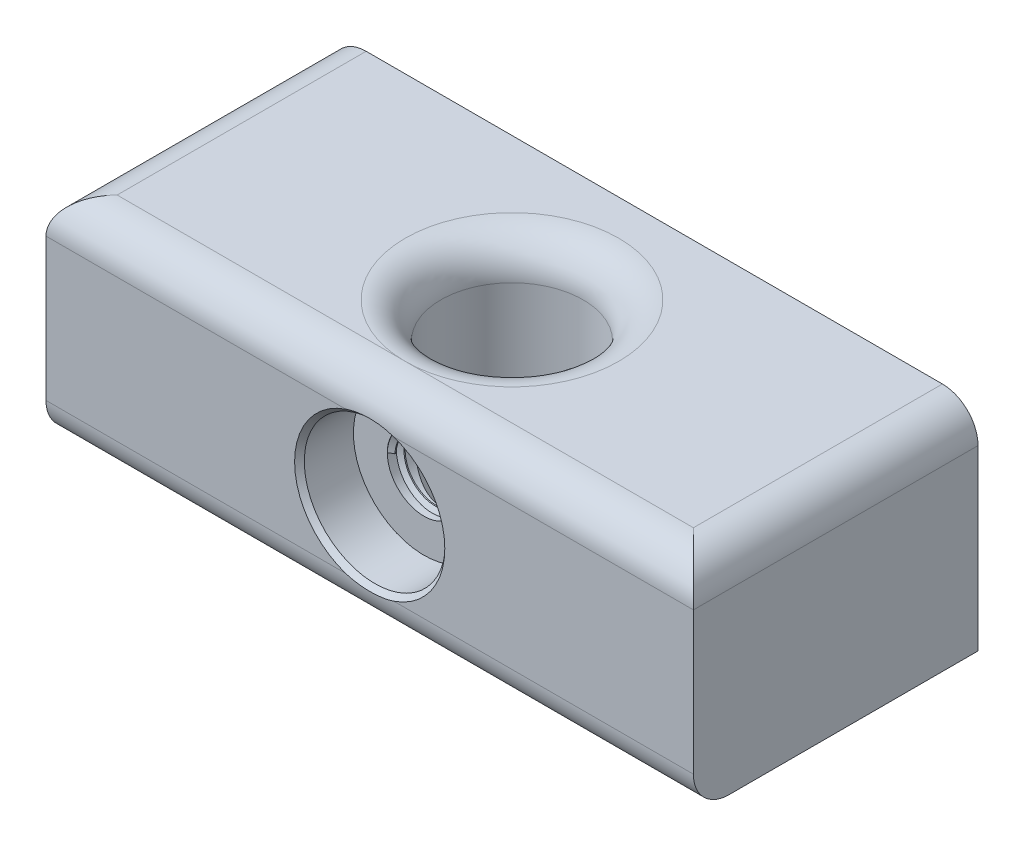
ISO-10303-21;
HEADER;
FILE_DESCRIPTION(('STEP AP214'),'2;1');
FILE_NAME('part.step','',(''),(''),'','','');
FILE_SCHEMA(('AUTOMOTIVE_DESIGN { 1 0 10303 214 1 1 1 1 }'));
ENDSEC;
DATA;
#1=APPLICATION_CONTEXT('core data for automotive mechanical design processes');
#2=APPLICATION_PROTOCOL_DEFINITION('international standard','automotive_design',2000,#1);
#3=PRODUCT_CONTEXT('',#1,'mechanical');
#4=PRODUCT('Part','Part','',(#3));
#5=PRODUCT_RELATED_PRODUCT_CATEGORY('part','',(#4));
#6=PRODUCT_DEFINITION_FORMATION('','',#4);
#7=PRODUCT_DEFINITION_CONTEXT('part definition',#1,'design');
#8=PRODUCT_DEFINITION('design','',#6,#7);
#9=PRODUCT_DEFINITION_SHAPE('','',#8);
#10=(LENGTH_UNIT() NAMED_UNIT(*) SI_UNIT(.MILLI.,.METRE.));
#11=(NAMED_UNIT(*) PLANE_ANGLE_UNIT() SI_UNIT($,.RADIAN.));
#12=(NAMED_UNIT(*) SI_UNIT($,.STERADIAN.) SOLID_ANGLE_UNIT());
#13=UNCERTAINTY_MEASURE_WITH_UNIT(LENGTH_MEASURE(1.E-05),#10,'distance_accuracy_value','');
#14=(GEOMETRIC_REPRESENTATION_CONTEXT(3) GLOBAL_UNCERTAINTY_ASSIGNED_CONTEXT((#13)) GLOBAL_UNIT_ASSIGNED_CONTEXT((#10,
#11,#12)) REPRESENTATION_CONTEXT('',''));
#15=CARTESIAN_POINT('',(0.,0.,0.));
#16=DIRECTION('',(0.,0.,1.));
#17=DIRECTION('',(1.,0.,0.));
#18=AXIS2_PLACEMENT_3D('',#15,#16,#17);
#19=CARTESIAN_POINT('',(-91.,30.,0.));
#20=DIRECTION('',(-1.,0.,0.));
#21=DIRECTION('',(0.,0.,1.));
#22=AXIS2_PLACEMENT_3D('',#19,#20,#21);
#23=PLANE('',#22);
#24=DIRECTION('',(0.,0.,-1.));
#25=VECTOR('',#24,1.);
#26=CARTESIAN_POINT('',(-91.,25.,0.));
#27=LINE('',#26,#25);
#28=CARTESIAN_POINT('',(-91.,25.,0.));
#29=VERTEX_POINT('',#28);
#30=CARTESIAN_POINT('',(-91.,25.,-40.));
#31=VERTEX_POINT('',#30);
#32=EDGE_CURVE('E171',#29,#31,#27,.T.);
#33=ORIENTED_EDGE('',*,*,#32,.T.);
#34=DIRECTION('',(0.,-1.,0.));
#35=VECTOR('',#34,1.);
#36=CARTESIAN_POINT('',(-91.,160.,-40.));
#37=LINE('',#36,#35);
#38=CARTESIAN_POINT('',(-91.,0.,-40.));
#39=VERTEX_POINT('',#38);
#40=EDGE_CURVE('E162',#31,#39,#37,.T.);
#41=ORIENTED_EDGE('',*,*,#40,.T.);
#42=DIRECTION('',(0.,0.,-1.));
#43=VECTOR('',#42,1.);
#44=CARTESIAN_POINT('',(-91.,0.,0.));
#45=LINE('',#44,#43);
#46=CARTESIAN_POINT('',(-91.,0.,-4.99999999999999));
#47=VERTEX_POINT('',#46);
#48=EDGE_CURVE('E503',#47,#39,#45,.T.);
#49=ORIENTED_EDGE('',*,*,#48,.F.);
#50=CARTESIAN_POINT('',(-91.,5.,-4.99999999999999));
#51=DIRECTION('',(-1.,0.,0.));
#52=DIRECTION('',(0.,0.,1.));
#53=AXIS2_PLACEMENT_3D('',#50,#51,#52);
#54=CIRCLE('',#53,5.);
#55=CARTESIAN_POINT('',(-91.,5.,0.));
#56=VERTEX_POINT('',#55);
#57=EDGE_CURVE('E168',#47,#56,#54,.T.);
#58=ORIENTED_EDGE('',*,*,#57,.T.);
#59=DIRECTION('',(0.,-1.,0.));
#60=VECTOR('',#59,1.);
#61=CARTESIAN_POINT('',(-91.,30.,0.));
#62=LINE('',#61,#60);
#63=EDGE_CURVE('E242',#29,#56,#62,.T.);
#64=ORIENTED_EDGE('',*,*,#63,.F.);
#65=EDGE_LOOP('',(#33,#41,#49,#58,#64));
#66=FACE_BOUND('',#65,.T.);
#67=ADVANCED_FACE('F44',(#66),#23,.T.);
#68=CARTESIAN_POINT('',(0.,30.,0.));
#69=DIRECTION('',(-1.,0.,0.));
#70=DIRECTION('',(0.,0.,1.));
#71=AXIS2_PLACEMENT_3D('',#68,#69,#70);
#72=PLANE('',#71);
#73=DIRECTION('',(0.,-1.,0.));
#74=VECTOR('',#73,1.);
#75=CARTESIAN_POINT('',(0.,160.,-40.));
#76=LINE('',#75,#74);
#77=CARTESIAN_POINT('',(0.,25.,-40.));
#78=VERTEX_POINT('',#77);
#79=CARTESIAN_POINT('',(0.,0.,-40.));
#80=VERTEX_POINT('',#79);
#81=EDGE_CURVE('E148',#78,#80,#76,.T.);
#82=ORIENTED_EDGE('',*,*,#81,.F.);
#83=DIRECTION('',(0.,0.,-1.));
#84=VECTOR('',#83,1.);
#85=CARTESIAN_POINT('',(0.,25.,0.));
#86=LINE('',#85,#84);
#87=CARTESIAN_POINT('',(0.,25.,0.));
#88=VERTEX_POINT('',#87);
#89=EDGE_CURVE('E158',#78,#88,#86,.F.);
#90=ORIENTED_EDGE('',*,*,#89,.T.);
#91=DIRECTION('',(0.,-1.,0.));
#92=VECTOR('',#91,1.);
#93=CARTESIAN_POINT('',(0.,30.,0.));
#94=LINE('',#93,#92);
#95=CARTESIAN_POINT('',(0.,5.,0.));
#96=VERTEX_POINT('',#95);
#97=EDGE_CURVE('E505',#88,#96,#94,.T.);
#98=ORIENTED_EDGE('',*,*,#97,.T.);
#99=CARTESIAN_POINT('',(0.,5.,-5.));
#100=DIRECTION('',(-1.,0.,0.));
#101=DIRECTION('',(0.,0.,1.));
#102=AXIS2_PLACEMENT_3D('',#99,#100,#101);
#103=CIRCLE('',#102,5.);
#104=CARTESIAN_POINT('',(0.,0.,-5.));
#105=VERTEX_POINT('',#104);
#106=EDGE_CURVE('E169',#96,#105,#103,.F.);
#107=ORIENTED_EDGE('',*,*,#106,.T.);
#108=DIRECTION('',(0.,0.,-1.));
#109=VECTOR('',#108,1.);
#110=CARTESIAN_POINT('',(0.,0.,0.));
#111=LINE('',#110,#109);
#112=EDGE_CURVE('E161',#105,#80,#111,.T.);
#113=ORIENTED_EDGE('',*,*,#112,.T.);
#114=EDGE_LOOP('',(#82,#90,#98,#107,#113));
#115=FACE_BOUND('',#114,.T.);
#116=ADVANCED_FACE('F156',(#115),#72,.F.);
#117=CARTESIAN_POINT('',(0.,30.,0.));
#118=DIRECTION('',(0.,1.,0.));
#119=DIRECTION('',(0.,0.,1.));
#120=AXIS2_PLACEMENT_3D('',#117,#118,#119);
#121=PLANE('',#120);
#122=DIRECTION('',(0.,0.,-1.));
#123=VECTOR('',#122,1.);
#124=CARTESIAN_POINT('',(-5.,30.,-45.));
#125=LINE('',#124,#123);
#126=CARTESIAN_POINT('',(-5.,30.,-5.));
#127=VERTEX_POINT('',#126);
#128=CARTESIAN_POINT('',(-5.,30.,-40.));
#129=VERTEX_POINT('',#128);
#130=EDGE_CURVE('E521',#127,#129,#125,.T.);
#131=ORIENTED_EDGE('',*,*,#130,.T.);
#132=DIRECTION('',(-1.,0.,0.));
#133=VECTOR('',#132,1.);
#134=CARTESIAN_POINT('',(0.,30.,-40.));
#135=LINE('',#134,#133);
#136=CARTESIAN_POINT('',(-86.,30.,-40.));
#137=VERTEX_POINT('',#136);
#138=EDGE_CURVE('E60',#129,#137,#135,.T.);
#139=ORIENTED_EDGE('',*,*,#138,.T.);
#140=DIRECTION('',(0.,0.,-1.));
#141=VECTOR('',#140,1.);
#142=CARTESIAN_POINT('',(-86.,30.,0.));
#143=LINE('',#142,#141);
#144=CARTESIAN_POINT('',(-86.,30.,-4.99999999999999));
#145=VERTEX_POINT('',#144);
#146=EDGE_CURVE('E514',#137,#145,#143,.F.);
#147=ORIENTED_EDGE('',*,*,#146,.T.);
#148=DIRECTION('',(-1.,0.,0.));
#149=VECTOR('',#148,1.);
#150=CARTESIAN_POINT('',(0.,30.,-5.));
#151=LINE('',#150,#149);
#152=CARTESIAN_POINT('',(-45.5,30.,-4.99999999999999));
#153=VERTEX_POINT('',#152);
#154=EDGE_CURVE('E312',#145,#153,#151,.F.);
#155=ORIENTED_EDGE('',*,*,#154,.T.);
#156=CARTESIAN_POINT('',(-45.5,30.,-20.));
#157=DIRECTION('',(0.,1.,0.));
#158=DIRECTION('',(0.,0.,1.));
#159=AXIS2_PLACEMENT_3D('',#156,#157,#158);
#160=CIRCLE('',#159,15.);
#161=EDGE_CURVE('E173',#153,#153,#160,.F.);
#162=ORIENTED_EDGE('',*,*,#161,.T.);
#163=DIRECTION('',(-1.,0.,0.));
#164=VECTOR('',#163,1.);
#165=CARTESIAN_POINT('',(0.,30.,-5.));
#166=LINE('',#165,#164);
#167=EDGE_CURVE('E509',#153,#127,#166,.F.);
#168=ORIENTED_EDGE('',*,*,#167,.T.);
#169=EDGE_LOOP('',(#131,#139,#147,#155,#162,#168));
#170=FACE_BOUND('',#169,.T.);
#171=ADVANCED_FACE('F235',(#170),#121,.T.);
#172=CARTESIAN_POINT('',(0.,0.,0.));
#173=DIRECTION('',(0.,1.,0.));
#174=DIRECTION('',(0.,0.,1.));
#175=AXIS2_PLACEMENT_3D('',#172,#173,#174);
#176=PLANE('',#175);
#177=CARTESIAN_POINT('',(-45.5,0.,-20.));
#178=DIRECTION('',(0.,1.,0.));
#179=DIRECTION('',(0.,0.,1.));
#180=AXIS2_PLACEMENT_3D('',#177,#178,#179);
#181=CIRCLE('',#180,10.);
#182=CARTESIAN_POINT('',(-45.5,0.,-9.99999999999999));
#183=VERTEX_POINT('',#182);
#184=EDGE_CURVE('E500',#183,#183,#181,.T.);
#185=ORIENTED_EDGE('',*,*,#184,.T.);
#186=EDGE_LOOP('',(#185));
#187=FACE_BOUND('',#186,.T.);
#188=DIRECTION('',(-1.,0.,0.));
#189=VECTOR('',#188,1.);
#190=CARTESIAN_POINT('',(0.,0.,-40.));
#191=LINE('',#190,#189);
#192=EDGE_CURVE('E317',#80,#39,#191,.T.);
#193=ORIENTED_EDGE('',*,*,#192,.F.);
#194=ORIENTED_EDGE('',*,*,#112,.F.);
#195=DIRECTION('',(-1.,0.,0.));
#196=VECTOR('',#195,1.);
#197=CARTESIAN_POINT('',(-91.,0.,-4.99999999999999));
#198=LINE('',#197,#196);
#199=EDGE_CURVE('E182',#105,#47,#198,.T.);
#200=ORIENTED_EDGE('',*,*,#199,.T.);
#201=ORIENTED_EDGE('',*,*,#48,.T.);
#202=EDGE_LOOP('',(#193,#194,#200,#201));
#203=FACE_BOUND('',#202,.T.);
#204=ADVANCED_FACE('F286',(#187,#203),#176,.F.);
#205=CARTESIAN_POINT('',(-86.,25.,0.));
#206=DIRECTION('',(0.,0.,-1.));
#207=DIRECTION('',(-1.,0.,0.));
#208=AXIS2_PLACEMENT_3D('',#205,#206,#207);
#209=CYLINDRICAL_SURFACE('',#208,5.);
#210=ORIENTED_EDGE('',*,*,#146,.F.);
#211=CARTESIAN_POINT('',(-86.,25.,-40.));
#212=DIRECTION('',(0.,0.,-1.));
#213=DIRECTION('',(-1.,0.,0.));
#214=AXIS2_PLACEMENT_3D('',#211,#212,#213);
#215=CIRCLE('',#214,5.);
#216=EDGE_CURVE('E306',#137,#31,#215,.F.);
#217=ORIENTED_EDGE('',*,*,#216,.T.);
#218=ORIENTED_EDGE('',*,*,#32,.F.);
#219=CARTESIAN_POINT('',(-86.,25.,-4.99999999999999));
#220=DIRECTION('',(-0.707106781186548,0.,-0.707106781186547));
#221=DIRECTION('',(-0.707106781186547,0.,0.707106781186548));
#222=AXIS2_PLACEMENT_3D('',#219,#220,#221);
#223=ELLIPSE('',#222,7.07106781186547,5.);
#224=EDGE_CURVE('E304',#145,#29,#223,.F.);
#225=ORIENTED_EDGE('',*,*,#224,.F.);
#226=EDGE_LOOP('',(#210,#217,#218,#225));
#227=FACE_BOUND('',#226,.T.);
#228=ADVANCED_FACE('F280',(#227),#209,.T.);
#229=CARTESIAN_POINT('',(-5.,25.,0.));
#230=DIRECTION('',(0.,0.,1.));
#231=DIRECTION('',(1.,0.,0.));
#232=AXIS2_PLACEMENT_3D('',#229,#230,#231);
#233=CYLINDRICAL_SURFACE('',#232,5.);
#234=ORIENTED_EDGE('',*,*,#89,.F.);
#235=CARTESIAN_POINT('',(-5.,25.,-40.));
#236=DIRECTION('',(0.,0.,-1.));
#237=DIRECTION('',(-1.,0.,0.));
#238=AXIS2_PLACEMENT_3D('',#235,#236,#237);
#239=CIRCLE('',#238,5.);
#240=EDGE_CURVE('E12',#78,#129,#239,.F.);
#241=ORIENTED_EDGE('',*,*,#240,.T.);
#242=ORIENTED_EDGE('',*,*,#130,.F.);
#243=CARTESIAN_POINT('',(-5.,25.,-5.));
#244=DIRECTION('',(-0.707106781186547,0.,0.707106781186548));
#245=DIRECTION('',(-0.707106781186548,0.,-0.707106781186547));
#246=AXIS2_PLACEMENT_3D('',#243,#244,#245);
#247=ELLIPSE('',#246,7.07106781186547,5.);
#248=EDGE_CURVE('E167',#127,#88,#247,.F.);
#249=ORIENTED_EDGE('',*,*,#248,.T.);
#250=EDGE_LOOP('',(#234,#241,#242,#249));
#251=FACE_BOUND('',#250,.T.);
#252=ADVANCED_FACE('F165',(#251),#233,.T.);
#253=CARTESIAN_POINT('',(0.,30.,0.));
#254=DIRECTION('',(0.,0.,1.));
#255=DIRECTION('',(1.,0.,0.));
#256=AXIS2_PLACEMENT_3D('',#253,#254,#255);
#257=PLANE('',#256);
#258=ORIENTED_EDGE('',*,*,#63,.T.);
#259=DIRECTION('',(-1.,0.,0.));
#260=VECTOR('',#259,1.);
#261=CARTESIAN_POINT('',(0.,5.,0.));
#262=LINE('',#261,#260);
#263=CARTESIAN_POINT('',(-48.8814498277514,5.,0.));
#264=VERTEX_POINT('',#263);
#265=EDGE_CURVE('E191',#56,#264,#262,.F.);
#266=ORIENTED_EDGE('',*,*,#265,.T.);
#267=CARTESIAN_POINT('',(-45.5,15.,0.));
#268=DIRECTION('',(0.,0.,1.));
#269=DIRECTION('',(1.,0.,0.));
#270=AXIS2_PLACEMENT_3D('',#267,#268,#269);
#271=CIRCLE('',#270,10.55624);
#272=CARTESIAN_POINT('',(-48.8814498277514,25.,0.));
#273=VERTEX_POINT('',#272);
#274=EDGE_CURVE('E493',#273,#264,#271,.T.);
#275=ORIENTED_EDGE('',*,*,#274,.F.);
#276=DIRECTION('',(-1.,0.,0.));
#277=VECTOR('',#276,1.);
#278=CARTESIAN_POINT('',(0.,25.,0.));
#279=LINE('',#278,#277);
#280=EDGE_CURVE('E185',#273,#29,#279,.T.);
#281=ORIENTED_EDGE('',*,*,#280,.T.);
#282=EDGE_LOOP('',(#258,#266,#275,#281));
#283=FACE_BOUND('',#282,.T.);
#284=ADVANCED_FACE('F233',(#283),#257,.T.);
#285=CARTESIAN_POINT('',(-45.5,15.,0.));
#286=DIRECTION('',(0.,0.,1.));
#287=DIRECTION('',(1.,0.,0.));
#288=AXIS2_PLACEMENT_3D('',#285,#286,#287);
#289=CYLINDRICAL_SURFACE('',#288,5.15873999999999);
#290=CARTESIAN_POINT('',(-50.65874,15.,-8.58189800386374));
#291=CARTESIAN_POINT('',(-50.65874,17.1368200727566,-8.66127300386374));
#292=CARTESIAN_POINT('',(-49.1477800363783,18.6477800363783,-8.74064800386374));
#293=CARTESIAN_POINT('',(-47.6368200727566,20.15874,-8.82002300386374));
#294=CARTESIAN_POINT('',(-45.5,20.15874,-8.89939800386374));
#295=CARTESIAN_POINT('',(-43.3631799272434,20.15874,-8.97877300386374));
#296=CARTESIAN_POINT('',(-41.8522199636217,18.6477800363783,-9.05814800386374));
#297=CARTESIAN_POINT('',(-40.34126,17.1368200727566,-9.13752300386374));
#298=CARTESIAN_POINT('',(-40.34126,15.,-9.21689800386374));
#299=CARTESIAN_POINT('',(-40.34126,12.8631799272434,-9.29627300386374));
#300=CARTESIAN_POINT('',(-41.8522199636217,11.3522199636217,-9.37564800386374));
#301=CARTESIAN_POINT('',(-43.3631799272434,9.84126,-9.45502300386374));
#302=CARTESIAN_POINT('',(-45.5,9.84126,-9.53439800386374));
#303=CARTESIAN_POINT('',(-47.6368200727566,9.84126,-9.61377300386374));
#304=CARTESIAN_POINT('',(-49.1477800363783,11.3522199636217,-9.69314800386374));
#305=CARTESIAN_POINT('',(-50.65874,12.8631799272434,-9.77252300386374));
#306=CARTESIAN_POINT('',(-50.65874,15.,-9.85189800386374));
#307=CARTESIAN_POINT('',(-50.65874,17.1368200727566,-9.93127300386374));
#308=CARTESIAN_POINT('',(-49.1477800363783,18.6477800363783,-10.0106480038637));
#309=CARTESIAN_POINT('',(-47.6368200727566,20.15874,-10.0900230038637));
#310=CARTESIAN_POINT('',(-45.5,20.15874,-10.1693980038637));
#311=CARTESIAN_POINT('',(-43.3631799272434,20.15874,-10.2487730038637));
#312=CARTESIAN_POINT('',(-41.8522199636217,18.6477800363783,-10.3281480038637));
#313=CARTESIAN_POINT('',(-40.34126,17.1368200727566,-10.4075230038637));
#314=CARTESIAN_POINT('',(-40.34126,15.,-10.4868980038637));
#315=CARTESIAN_POINT('',(-40.34126,13.7648780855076,-10.5327782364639));
#316=CARTESIAN_POINT('',(-40.9006286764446,12.6636819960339,-10.5822903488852));
#317=(BOUNDED_CURVE() B_SPLINE_CURVE(2,(#290,#291,#292,#293,#294,#295,#296,#297,#298,#299,#300,
#301,#302,#303,#304,#305,#306,#307,#308,#309,#310,#311,#312,#313,#314,#315,#316),.UNSPECIFIED.,
.F.,.F.) B_SPLINE_CURVE_WITH_KNOTS((3,2,2,2,2,2,2,2,2,2,2,2,2,3),(0.,0.0625,0.125,0.1875,0.25,
0.3125,0.375,0.4375,0.5,0.5625,0.625,0.6875,0.75,0.787325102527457),
.UNSPECIFIED.) CURVE() GEOMETRIC_REPRESENTATION_ITEM() RATIONAL_B_SPLINE_CURVE((1.,
0.923879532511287,1.,0.923879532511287,1.,0.923879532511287,1.,0.923879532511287,1.,
0.923879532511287,1.,0.923879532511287,1.,0.923879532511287,1.,0.923879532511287,1.,
0.923879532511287,1.,0.923879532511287,1.,0.923879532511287,1.,0.923879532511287,1.,
0.954540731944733,0.963378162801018)) REPRESENTATION_ITEM(''));
#318=CARTESIAN_POINT('',(-50.65874,15.,-8.58189800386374));
#319=VERTEX_POINT('',#318);
#320=CARTESIAN_POINT('',(-46.9839235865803,19.9407053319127,-10.1109209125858));
#321=VERTEX_POINT('',#320);
#322=EDGE_CURVE('E451',#319,#321,#317,.T.);
#323=ORIENTED_EDGE('',*,*,#322,.F.);
#324=DIRECTION('',(0.,0.,-1.));
#325=VECTOR('',#324,1.);
#326=CARTESIAN_POINT('',(-50.65874,15.,-8.10564800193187));
#327=LINE('',#326,#325);
#328=CARTESIAN_POINT('',(-50.65874,15.,-7.629398));
#329=VERTEX_POINT('',#328);
#330=EDGE_CURVE('E475',#329,#319,#327,.T.);
#331=ORIENTED_EDGE('',*,*,#330,.F.);
#332=CARTESIAN_POINT('',(-45.5,15.,-7.629398));
#333=DIRECTION('',(0.,0.,1.));
#334=DIRECTION('',(1.,0.,0.));
#335=AXIS2_PLACEMENT_3D('',#332,#333,#334);
#336=CIRCLE('',#335,5.15873999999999);
#337=EDGE_CURVE('E267',#329,#329,#336,.T.);
#338=ORIENTED_EDGE('',*,*,#337,.T.);
#339=CARTESIAN_POINT('',(-50.65874,15.,-7.629398));
#340=CARTESIAN_POINT('',(-50.65874,17.1368200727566,-7.708773));
#341=CARTESIAN_POINT('',(-49.1477800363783,18.6477800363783,-7.788148));
#342=CARTESIAN_POINT('',(-47.6368200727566,20.15874,-7.867523));
#343=CARTESIAN_POINT('',(-45.5,20.15874,-7.946898));
#344=CARTESIAN_POINT('',(-43.3631799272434,20.15874,-8.026273));
#345=CARTESIAN_POINT('',(-41.8522199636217,18.6477800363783,-8.105648));
#346=CARTESIAN_POINT('',(-40.34126,17.1368200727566,-8.185023));
#347=CARTESIAN_POINT('',(-40.34126,15.,-8.264398));
#348=CARTESIAN_POINT('',(-40.34126,12.8631799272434,-8.343773));
#349=CARTESIAN_POINT('',(-41.8522199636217,11.3522199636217,-8.423148));
#350=CARTESIAN_POINT('',(-43.3631799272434,9.84126,-8.502523));
#351=CARTESIAN_POINT('',(-45.5,9.84126,-8.581898));
#352=CARTESIAN_POINT('',(-47.6368200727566,9.84126,-8.661273));
#353=CARTESIAN_POINT('',(-49.1477800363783,11.3522199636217,-8.740648));
#354=CARTESIAN_POINT('',(-50.65874,12.8631799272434,-8.820023));
#355=CARTESIAN_POINT('',(-50.65874,15.,-8.899398));
#356=CARTESIAN_POINT('',(-50.65874,17.1368200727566,-8.978773));
#357=CARTESIAN_POINT('',(-49.1477800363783,18.6477800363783,-9.058148));
#358=CARTESIAN_POINT('',(-47.6368200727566,20.15874,-9.137523));
#359=CARTESIAN_POINT('',(-45.5,20.15874,-9.216898));
#360=CARTESIAN_POINT('',(-43.3631799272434,20.15874,-9.296273));
#361=CARTESIAN_POINT('',(-41.8522199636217,18.6477800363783,-9.375648));
#362=CARTESIAN_POINT('',(-40.34126,17.1368200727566,-9.455023));
#363=CARTESIAN_POINT('',(-40.34126,15.,-9.534398));
#364=CARTESIAN_POINT('',(-40.34126,13.7648780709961,-9.58027823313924));
#365=CARTESIAN_POINT('',(-40.900628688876,12.6636819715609,-9.62979034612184));
#366=(BOUNDED_CURVE() B_SPLINE_CURVE(2,(#339,#340,#341,#342,#343,#344,#345,#346,#347,#348,#349,
#350,#351,#352,#353,#354,#355,#356,#357,#358,#359,#360,#361,#362,#363,#364,#365),.UNSPECIFIED.,
.F.,.F.) B_SPLINE_CURVE_WITH_KNOTS((3,2,2,2,2,2,2,2,2,2,2,2,2,3),(0.,0.0625,0.125,0.1875,0.25,
0.3125,0.375,0.4375,0.5,0.5625,0.625,0.6875,0.75,0.787325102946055),
.UNSPECIFIED.) CURVE() GEOMETRIC_REPRESENTATION_ITEM() RATIONAL_B_SPLINE_CURVE((1.,
0.923879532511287,1.,0.923879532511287,1.,0.923879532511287,1.,0.923879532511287,1.,
0.923879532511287,1.,0.923879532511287,1.,0.923879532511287,1.,0.923879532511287,1.,
0.923879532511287,1.,0.923879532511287,1.,0.923879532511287,1.,0.923879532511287,1.,
0.954540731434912,0.96337816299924)) REPRESENTATION_ITEM(''));
#367=CARTESIAN_POINT('',(-40.9006266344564,12.6636860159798,-9.62979034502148));
#368=VERTEX_POINT('',#367);
#369=EDGE_CURVE('E442',#329,#368,#366,.T.);
#370=ORIENTED_EDGE('',*,*,#369,.T.);
#371=DIRECTION('',(0.,0.,1.));
#372=VECTOR('',#371,1.);
#373=CARTESIAN_POINT('',(-40.9006266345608,12.6636860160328,-10.0663534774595));
#374=LINE('',#373,#372);
#375=CARTESIAN_POINT('',(-40.9006286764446,12.6636819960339,-10.5822903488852));
#376=VERTEX_POINT('',#375);
#377=EDGE_CURVE('E457',#376,#368,#374,.T.);
#378=ORIENTED_EDGE('',*,*,#377,.F.);
#379=CARTESIAN_POINT('',(-43.2260535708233,19.6305577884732,-10.2620069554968));
#380=VERTEX_POINT('',#379);
#381=EDGE_CURVE('E261',#380,#376,#317,.T.);
#382=ORIENTED_EDGE('',*,*,#381,.F.);
#383=CARTESIAN_POINT('',(-46.9846194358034,19.9409735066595,-10.1108187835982));
#384=CARTESIAN_POINT('',(-47.0731325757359,19.9142950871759,-10.1241038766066));
#385=CARTESIAN_POINT('',(-47.160756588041,19.8852463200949,-10.1384764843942));
#386=CARTESIAN_POINT('',(-47.3349521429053,19.8223311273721,-10.169392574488));
#387=CARTESIAN_POINT('',(-47.421502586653,19.7884167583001,-10.18595751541));
#388=CARTESIAN_POINT('',(-47.5798247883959,19.72157437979,-10.2183913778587));
#389=CARTESIAN_POINT('',(-47.6518986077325,19.6892343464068,-10.2340046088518));
#390=CARTESIAN_POINT('',(-47.7940248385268,19.6215822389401,-10.2664116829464));
#391=CARTESIAN_POINT('',(-47.8640837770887,19.5862816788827,-10.2832009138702));
#392=CARTESIAN_POINT('',(-48.0073887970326,19.509925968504,-10.3191501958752));
#393=CARTESIAN_POINT('',(-48.0804902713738,19.4686385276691,-10.338393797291));
#394=CARTESIAN_POINT('',(-48.2243441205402,19.3826314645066,-10.3779672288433));
#395=CARTESIAN_POINT('',(-48.2950964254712,19.3379117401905,-10.3982970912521));
#396=CARTESIAN_POINT('',(-48.4342586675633,19.2450466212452,-10.4399052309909));
#397=CARTESIAN_POINT('',(-48.5026632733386,19.196894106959,-10.4611854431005));
#398=CARTESIAN_POINT('',(-48.6371412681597,19.0971706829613,-10.5045612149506));
#399=CARTESIAN_POINT('',(-48.7032035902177,19.0455861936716,-10.5266598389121));
#400=CARTESIAN_POINT('',(-48.8354880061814,18.9369738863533,-10.5724004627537));
#401=CARTESIAN_POINT('',(-48.9015864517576,18.8798059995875,-10.59606738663));
#402=CARTESIAN_POINT('',(-49.0313114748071,18.7618002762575,-10.644003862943));
#403=CARTESIAN_POINT('',(-49.0949118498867,18.7009350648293,-10.6682768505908));
#404=CARTESIAN_POINT('',(-49.2154661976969,18.5797784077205,-10.7156444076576));
#405=CARTESIAN_POINT('',(-49.2725922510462,18.519653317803,-10.7387269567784));
#406=CARTESIAN_POINT('',(-49.3832700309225,18.3974920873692,-10.7845911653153));
#407=CARTESIAN_POINT('',(-49.4368563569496,18.335487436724,-10.8073731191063));
#408=CARTESIAN_POINT('',(-49.5425281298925,18.2071181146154,-10.8533404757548));
#409=CARTESIAN_POINT('',(-49.5945269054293,18.1406794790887,-10.876518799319));
#410=CARTESIAN_POINT('',(-49.6947875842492,18.005748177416,-10.9221827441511));
#411=CARTESIAN_POINT('',(-49.7430774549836,17.9372777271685,-10.9446725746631));
#412=CARTESIAN_POINT('',(-49.8359880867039,17.7982892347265,-10.9887938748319));
#413=CARTESIAN_POINT('',(-49.8806300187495,17.7277867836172,-11.0104298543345));
#414=CARTESIAN_POINT('',(-49.9663135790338,17.5847415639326,-11.052692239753));
#415=CARTESIAN_POINT('',(-50.0073689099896,17.512208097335,-11.0733223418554));
#416=CARTESIAN_POINT('',(-50.0861547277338,17.3647124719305,-11.1135412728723));
#417=CARTESIAN_POINT('',(-50.1238724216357,17.2897423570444,-11.1331259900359));
#418=CARTESIAN_POINT('',(-50.195810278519,17.137756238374,-11.1710125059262));
#419=CARTESIAN_POINT('',(-50.2300278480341,17.0607387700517,-11.1893133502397));
#420=CARTESIAN_POINT('',(-50.2959974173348,16.9022447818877,-11.2250435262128));
#421=CARTESIAN_POINT('',(-50.3276265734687,16.8207055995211,-11.2424223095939));
#422=CARTESIAN_POINT('',(-50.3863997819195,16.6570128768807,-11.2750809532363));
#423=CARTESIAN_POINT('',(-50.4136030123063,16.5748860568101,-11.2903879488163));
#424=CARTESIAN_POINT('',(-50.4637396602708,16.4095925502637,-11.3188644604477));
#425=CARTESIAN_POINT('',(-50.4867006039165,16.3264365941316,-11.332047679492));
#426=CARTESIAN_POINT('',(-50.5282370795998,16.1595231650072,-11.3560771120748));
#427=CARTESIAN_POINT('',(-50.5468507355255,16.0757781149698,-11.3669435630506));
#428=CARTESIAN_POINT('',(-50.5797525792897,15.9076938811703,-11.3862623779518));
#429=CARTESIAN_POINT('',(-50.594066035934,15.8233612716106,-11.3947288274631));
#430=CARTESIAN_POINT('',(-50.6184175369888,15.6541073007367,-11.409190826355));
#431=CARTESIAN_POINT('',(-50.6284671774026,15.5691881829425,-11.4151930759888));
#432=CARTESIAN_POINT('',(-50.6441157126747,15.4010832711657,-11.4245609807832));
#433=CARTESIAN_POINT('',(-50.6498259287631,15.3179114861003,-11.4279925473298));
#434=CARTESIAN_POINT('',(-50.6572657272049,15.1510175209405,-11.4324665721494));
#435=CARTESIAN_POINT('',(-50.6589804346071,15.0672944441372,-11.4335001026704));
#436=CARTESIAN_POINT('',(-50.6584337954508,14.8956240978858,-11.4331708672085));
#437=CARTESIAN_POINT('',(-50.6559666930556,14.8076776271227,-11.4316840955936));
#438=CARTESIAN_POINT('',(-50.646606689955,14.6324137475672,-11.4260587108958));
#439=CARTESIAN_POINT('',(-50.6397293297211,14.5450952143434,-11.421929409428));
#440=CARTESIAN_POINT('',(-50.6217859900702,14.373390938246,-11.4112041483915));
#441=CARTESIAN_POINT('',(-50.6108358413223,14.2889887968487,-11.4046764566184));
#442=CARTESIAN_POINT('',(-50.5847232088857,14.1207799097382,-11.3892032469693));
#443=CARTESIAN_POINT('',(-50.5695471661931,14.0369759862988,-11.3802499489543));
#444=CARTESIAN_POINT('',(-50.5349580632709,13.8699607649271,-11.3599999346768));
#445=CARTESIAN_POINT('',(-50.5155181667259,13.7867568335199,-11.3486883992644));
#446=CARTESIAN_POINT('',(-50.4723651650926,13.6209364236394,-11.3238136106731));
#447=CARTESIAN_POINT('',(-50.4486127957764,13.5383332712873,-11.3102297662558));
#448=CARTESIAN_POINT('',(-50.3983578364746,13.378681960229,-11.2818073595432));
#449=CARTESIAN_POINT('',(-50.3720431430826,13.3015580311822,-11.2670609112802));
#450=CARTESIAN_POINT('',(-50.3155411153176,13.1478227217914,-11.2357761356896));
#451=CARTESIAN_POINT('',(-50.2853039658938,13.0712342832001,-11.2192152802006));
#452=CARTESIAN_POINT('',(-50.2189552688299,12.9138555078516,-11.1833682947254));
#453=CARTESIAN_POINT('',(-50.1825690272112,12.8332064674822,-11.1639702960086));
#454=CARTESIAN_POINT('',(-50.105940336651,12.6741851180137,-11.12378552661));
#455=CARTESIAN_POINT('',(-50.0657004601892,12.5958113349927,-11.1029996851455));
#456=CARTESIAN_POINT('',(-49.9836809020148,12.4457007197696,-11.0613981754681));
#457=CARTESIAN_POINT('',(-49.9421047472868,12.3738349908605,-11.0406459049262));
#458=CARTESIAN_POINT('',(-49.8554100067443,12.2321239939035,-10.998181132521));
#459=CARTESIAN_POINT('',(-49.8102772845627,12.1622884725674,-10.9764649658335));
#460=CARTESIAN_POINT('',(-49.716416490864,12.0246331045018,-10.9322251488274));
#461=CARTESIAN_POINT('',(-49.6676670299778,11.9568292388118,-10.909697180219));
#462=CARTESIAN_POINT('',(-49.5665190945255,11.8232300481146,-10.8639982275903));
#463=CARTESIAN_POINT('',(-49.5140926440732,11.7574572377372,-10.8408233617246));
#464=CARTESIAN_POINT('',(-49.410593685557,11.6339483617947,-10.7961874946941));
#465=CARTESIAN_POINT('',(-49.3597690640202,11.5759980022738,-10.7747436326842));
#466=CARTESIAN_POINT('',(-49.2550286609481,11.4617437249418,-10.7316127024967));
#467=CARTESIAN_POINT('',(-49.2010842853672,11.4054660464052,-10.7099256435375));
#468=CARTESIAN_POINT('',(-49.0803468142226,11.2848579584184,-10.6626513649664));
#469=CARTESIAN_POINT('',(-49.0130514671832,11.22101449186,-10.6371012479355));
#470=CARTESIAN_POINT('',(-48.87566869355,11.09747685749,-10.5867027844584));
#471=CARTESIAN_POINT('',(-48.8056116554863,11.0377506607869,-10.5618502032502));
#472=CARTESIAN_POINT('',(-48.6686954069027,10.9272766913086,-10.5150582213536));
#473=CARTESIAN_POINT('',(-48.602118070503,10.8762050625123,-10.4930583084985));
#474=CARTESIAN_POINT('',(-48.4666154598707,10.7775254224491,-10.4499095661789));
#475=CARTESIAN_POINT('',(-48.3977007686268,10.7299042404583,-10.428757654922));
#476=CARTESIAN_POINT('',(-48.2575253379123,10.6381200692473,-10.387436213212));
#477=CARTESIAN_POINT('',(-48.1862694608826,10.5939504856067,-10.367264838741));
#478=CARTESIAN_POINT('',(-48.0414154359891,10.5090616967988,-10.3280385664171));
#479=CARTESIAN_POINT('',(-47.9678169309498,10.4683430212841,-10.3089838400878));
#480=CARTESIAN_POINT('',(-47.8276349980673,10.3952255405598,-10.2744322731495));
#481=CARTESIAN_POINT('',(-47.7613004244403,10.36241915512,-10.2587859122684));
#482=CARTESIAN_POINT('',(-47.6268530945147,10.2994359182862,-10.2285487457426));
#483=CARTESIAN_POINT('',(-47.5587348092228,10.2692689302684,-10.213961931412));
#484=CARTESIAN_POINT('',(-47.444680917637,10.2215912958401,-10.1908029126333));
#485=CARTESIAN_POINT('',(-47.3991454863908,10.2032869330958,-10.1818829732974));
#486=CARTESIAN_POINT('',(-47.307768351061,10.1680408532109,-10.1646493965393));
#487=CARTESIAN_POINT('',(-47.2619302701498,10.1510914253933,-10.1563323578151));
#488=CARTESIAN_POINT('',(-47.169957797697,10.1185518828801,-10.1403140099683));
#489=CARTESIAN_POINT('',(-47.123826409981,10.1029548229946,-10.1326095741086));
#490=CARTESIAN_POINT('',(-47.0312769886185,10.073120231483,-10.1178253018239));
#491=CARTESIAN_POINT('',(-46.9848613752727,10.0588765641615,-10.1107426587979));
#492=CARTESIAN_POINT('',(-46.8556963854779,10.0212434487,-10.0919711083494));
#493=CARTESIAN_POINT('',(-46.7724433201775,9.99923989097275,-10.080926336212));
#494=CARTESIAN_POINT('',(-46.6051025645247,9.95953796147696,-10.0608946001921));
#495=CARTESIAN_POINT('',(-46.5210207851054,9.94181946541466,-10.0518980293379));
#496=CARTESIAN_POINT('',(-46.3520721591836,9.91067600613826,-10.0360070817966));
#497=CARTESIAN_POINT('',(-46.2672075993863,9.89724113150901,-10.0291078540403));
#498=CARTESIAN_POINT('',(-46.0967475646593,9.87465502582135,-10.0174556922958));
#499=CARTESIAN_POINT('',(-46.0111519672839,9.86550452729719,-10.0127031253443));
#500=CARTESIAN_POINT('',(-45.8528374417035,9.85258159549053,-10.0059631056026));
#501=CARTESIAN_POINT('',(-45.780181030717,9.8481950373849,-10.0036610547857));
#502=CARTESIAN_POINT('',(-45.6344209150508,9.84245144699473,-10.0006367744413));
#503=CARTESIAN_POINT('',(-45.5613165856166,9.84110664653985,-9.99992092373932));
#504=CARTESIAN_POINT('',(-45.4382057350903,9.84138758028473,-10.0000657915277));
#505=CARTESIAN_POINT('',(-45.3881947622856,9.842209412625,-10.0005000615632));
#506=CARTESIAN_POINT('',(-45.2883805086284,9.84527759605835,-10.0021151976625));
#507=CARTESIAN_POINT('',(-45.2385770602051,9.84751958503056,-10.003293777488));
#508=CARTESIAN_POINT('',(-45.1391902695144,9.85342702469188,-10.0063879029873));
#509=CARTESIAN_POINT('',(-45.0896066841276,9.85708926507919,-10.0083017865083));
#510=CARTESIAN_POINT('',(-44.9906697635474,9.86583603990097,-10.01285669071));
#511=CARTESIAN_POINT('',(-44.9413162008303,9.87091853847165,-10.0154966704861));
#512=CARTESIAN_POINT('',(-44.8495341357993,9.88171814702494,-10.0210867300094));
#513=CARTESIAN_POINT('',(-44.8070787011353,9.88725431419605,-10.0239454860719));
#514=CARTESIAN_POINT('',(-44.7223551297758,9.89938670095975,-10.0301919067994));
#515=CARTESIAN_POINT('',(-44.6800870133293,9.90598303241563,-10.0335796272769));
#516=CARTESIAN_POINT('',(-44.5535007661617,9.92737454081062,-10.0445333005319));
#517=CARTESIAN_POINT('',(-44.4695118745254,9.94375915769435,-10.0528829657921));
#518=CARTESIAN_POINT('',(-44.3023577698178,9.98075814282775,-10.0716186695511));
#519=CARTESIAN_POINT('',(-44.2191970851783,10.0013888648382,-10.0820125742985));
#520=CARTESIAN_POINT('',(-44.0537348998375,10.0468719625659,-10.1047822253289));
#521=CARTESIAN_POINT('',(-43.9714421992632,10.0717502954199,-10.1171701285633));
#522=CARTESIAN_POINT('',(-43.8234122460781,10.1205548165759,-10.1413185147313));
#523=CARTESIAN_POINT('',(-43.7574061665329,10.1438191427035,-10.152777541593));
#524=CARTESIAN_POINT('',(-43.6260097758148,10.193116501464,-10.1769321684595));
#525=CARTESIAN_POINT('',(-43.5606294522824,10.2191713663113,-10.1896374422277));
#526=CARTESIAN_POINT('',(-43.4028136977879,10.2856933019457,-10.2219210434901));
#527=CARTESIAN_POINT('',(-43.3110487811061,10.3274806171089,-10.2420754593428));
#528=CARTESIAN_POINT('',(-43.1308252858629,10.4159182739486,-10.2842631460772));
#529=CARTESIAN_POINT('',(-43.0423547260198,10.4625480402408,-10.3062884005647));
#530=CARTESIAN_POINT('',(-42.8825637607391,10.5528430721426,-10.3483308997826));
#531=CARTESIAN_POINT('',(-42.8107685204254,10.5957842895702,-10.3681036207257));
#532=CARTESIAN_POINT('',(-42.6695110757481,10.6850867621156,-10.4086633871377));
#533=CARTESIAN_POINT('',(-42.6000516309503,10.7314518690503,-10.4294515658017));
#534=CARTESIAN_POINT('',(-42.4634589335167,10.8275944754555,-10.4719072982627));
#535=CARTESIAN_POINT('',(-42.3963339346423,10.8773825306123,-10.4935774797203));
#536=CARTESIAN_POINT('',(-42.264394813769,10.9803658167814,-10.5376682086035));
#537=CARTESIAN_POINT('',(-42.1995948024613,11.0335776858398,-10.5600921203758));
#538=CARTESIAN_POINT('',(-42.0865279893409,11.1311163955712,-10.6004793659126));
#539=CARTESIAN_POINT('',(-42.0377270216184,11.174862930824,-10.6183537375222));
#540=CARTESIAN_POINT('',(-41.9415065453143,11.2644137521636,-10.6544243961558));
#541=CARTESIAN_POINT('',(-41.8940987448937,11.3102300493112,-10.6726220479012));
#542=CARTESIAN_POINT('',(-41.7735078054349,11.4311244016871,-10.7199365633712));
#543=CARTESIAN_POINT('',(-41.7016493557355,11.5074939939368,-10.749150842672));
#544=CARTESIAN_POINT('',(-41.5636534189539,11.6633238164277,-10.8070301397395));
#545=CARTESIAN_POINT('',(-41.4974482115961,11.7427233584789,-10.8356969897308));
#546=CARTESIAN_POINT('',(-41.382054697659,11.8900276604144,-10.8870575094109));
#547=CARTESIAN_POINT('',(-41.3320267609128,11.9572419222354,-10.9098490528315));
#548=CARTESIAN_POINT('',(-41.2356450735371,12.0937173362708,-10.9546652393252));
#549=CARTESIAN_POINT('',(-41.1892671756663,12.1629599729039,-10.9766942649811));
#550=CARTESIAN_POINT('',(-41.1001198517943,12.3034836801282,-11.0198276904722));
#551=CARTESIAN_POINT('',(-41.0573333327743,12.3747526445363,-11.0409362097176));
#552=CARTESIAN_POINT('',(-40.9752997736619,12.5193252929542,-11.0820861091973));
#553=CARTESIAN_POINT('',(-40.9360432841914,12.5926228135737,-11.1021302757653));
#554=CARTESIAN_POINT('',(-40.8705625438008,12.7223143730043,-11.1360674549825));
#555=CARTESIAN_POINT('',(-40.8435678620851,12.7782522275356,-11.1502255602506));
#556=CARTESIAN_POINT('',(-40.7914780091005,12.8912529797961,-11.177829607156));
#557=CARTESIAN_POINT('',(-40.7663847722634,12.9483169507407,-11.191274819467));
#558=CARTESIAN_POINT('',(-40.7335916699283,13.0265651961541,-11.2090132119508));
#559=CARTESIAN_POINT('',(-40.7250457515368,13.0473201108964,-11.2136524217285));
#560=CARTESIAN_POINT('',(-40.7082472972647,13.0888688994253,-11.2228024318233));
#561=CARTESIAN_POINT('',(-40.699993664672,13.1096622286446,-11.2273136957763));
#562=CARTESIAN_POINT('',(-40.6602757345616,13.2116176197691,-11.2490933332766));
#563=CARTESIAN_POINT('',(-40.6306293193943,13.2936712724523,-11.2655721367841));
#564=CARTESIAN_POINT('',(-40.5758084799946,13.4583921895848,-11.2963620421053));
#565=CARTESIAN_POINT('',(-40.5505793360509,13.5410364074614,-11.3106992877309));
#566=CARTESIAN_POINT('',(-40.5045184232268,13.7069379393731,-11.3370985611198));
#567=CARTESIAN_POINT('',(-40.4836428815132,13.7901794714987,-11.349183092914));
#568=CARTESIAN_POINT('',(-40.4462267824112,13.9572664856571,-11.3709883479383));
#569=CARTESIAN_POINT('',(-40.4296546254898,14.0411026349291,-11.3807262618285));
#570=CARTESIAN_POINT('',(-40.4007902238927,14.2093718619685,-11.3977712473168));
#571=CARTESIAN_POINT('',(-40.3884795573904,14.2938007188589,-11.4050887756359));
#572=CARTESIAN_POINT('',(-40.3680928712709,14.4632545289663,-11.417245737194));
#573=CARTESIAN_POINT('',(-40.3600122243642,14.5482787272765,-11.4220878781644));
#574=CARTESIAN_POINT('',(-40.349771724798,14.6943474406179,-11.4282340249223));
#575=CARTESIAN_POINT('',(-40.346579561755,14.7552968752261,-11.4301538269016));
#576=CARTESIAN_POINT('',(-40.3423202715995,14.8774987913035,-11.432716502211));
#577=CARTESIAN_POINT('',(-40.3412600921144,14.9387516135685,-11.4333552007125));
#578=CARTESIAN_POINT('',(-40.341259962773,15.0247528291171,-11.4333553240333));
#579=CARTESIAN_POINT('',(-40.3414330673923,15.0495049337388,-11.4332510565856));
#580=CARTESIAN_POINT('',(-40.3421265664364,15.0989599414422,-11.4328335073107));
#581=CARTESIAN_POINT('',(-40.3426463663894,15.1236628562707,-11.432520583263));
#582=CARTESIAN_POINT('',(-40.3457511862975,15.2341221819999,-11.430651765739));
#583=CARTESIAN_POINT('',(-40.3502647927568,15.3198181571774,-11.4279356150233));
#584=CARTESIAN_POINT('',(-40.3635267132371,15.490607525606,-11.4199824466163));
#585=CARTESIAN_POINT('',(-40.3722676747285,15.5757017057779,-11.4147498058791));
#586=CARTESIAN_POINT('',(-40.3939931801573,15.745297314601,-11.4018109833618));
#587=CARTESIAN_POINT('',(-40.4069844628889,15.8297975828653,-11.3941008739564));
#588=CARTESIAN_POINT('',(-40.4372300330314,15.9982051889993,-11.3762728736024));
#589=CARTESIAN_POINT('',(-40.4545048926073,16.0821075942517,-11.366143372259));
#590=CARTESIAN_POINT('',(-40.4933483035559,16.2493240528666,-11.3435603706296));
#591=CARTESIAN_POINT('',(-40.5149505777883,16.3326277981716,-11.3310886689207));
#592=CARTESIAN_POINT('',(-40.5624879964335,16.4986532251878,-11.3039242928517));
#593=CARTESIAN_POINT('',(-40.588468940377,16.5813579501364,-11.2892083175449));
#594=CARTESIAN_POINT('',(-40.6448209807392,16.7461892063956,-11.2576723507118));
#595=CARTESIAN_POINT('',(-40.6752487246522,16.8282912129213,-11.2408256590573));
#596=CARTESIAN_POINT('',(-40.7393113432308,16.9888784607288,-11.205845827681));
#597=CARTESIAN_POINT('',(-40.7728656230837,17.0674034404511,-11.1877470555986));
#598=CARTESIAN_POINT('',(-40.8428847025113,17.2209696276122,-11.1505469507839));
#599=CARTESIAN_POINT('',(-40.8792800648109,17.2960489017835,-11.1314720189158));
#600=CARTESIAN_POINT('',(-40.9555607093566,17.4441713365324,-11.0921431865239));
#601=CARTESIAN_POINT('',(-40.995448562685,17.5172129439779,-11.0718884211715));
#602=CARTESIAN_POINT('',(-41.0787579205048,17.6612684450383,-11.0303404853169));
#603=CARTESIAN_POINT('',(-41.1221899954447,17.7322753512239,-11.0090442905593));
#604=CARTESIAN_POINT('',(-41.2126419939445,17.8722661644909,-10.9655607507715));
#605=CARTESIAN_POINT('',(-41.2596800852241,17.9412370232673,-10.9433692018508));
#606=CARTESIAN_POINT('',(-41.3573974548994,18.0771617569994,-10.8982550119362));
#607=CARTESIAN_POINT('',(-41.4081018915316,18.1440961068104,-10.875328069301));
#608=CARTESIAN_POINT('',(-41.5132048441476,18.275955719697,-10.8289151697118));
#609=CARTESIAN_POINT('',(-41.567634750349,18.3408547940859,-10.8054259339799));
#610=CARTESIAN_POINT('',(-41.6802465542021,18.4686449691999,-10.7580707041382));
#611=CARTESIAN_POINT('',(-41.7384652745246,18.531503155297,-10.7342035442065));
#612=CARTESIAN_POINT('',(-41.8578072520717,18.6543307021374,-10.6866463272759));
#613=CARTESIAN_POINT('',(-41.9189274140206,18.7143030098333,-10.6629561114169));
#614=CARTESIAN_POINT('',(-42.043359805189,18.8305969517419,-10.6161838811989));
#615=CARTESIAN_POINT('',(-42.1066386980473,18.8869526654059,-10.593098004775));
#616=CARTESIAN_POINT('',(-42.2355523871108,18.996171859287,-10.5475918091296));
#617=CARTESIAN_POINT('',(-42.3011674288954,19.049057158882,-10.5251679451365));
#618=CARTESIAN_POINT('',(-42.4347562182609,19.1513433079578,-10.4811134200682));
#619=CARTESIAN_POINT('',(-42.5027163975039,19.2007603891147,-10.4594793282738));
#620=CARTESIAN_POINT('',(-42.6409968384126,19.2961155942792,-10.4171343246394));
#621=CARTESIAN_POINT('',(-42.7113094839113,19.3420636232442,-10.3964208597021));
#622=CARTESIAN_POINT('',(-42.8542928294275,19.4304857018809,-10.3560514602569));
#623=CARTESIAN_POINT('',(-42.9269614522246,19.4729627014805,-10.3363946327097));
#624=CARTESIAN_POINT('',(-43.0746443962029,19.5544563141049,-10.2982740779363));
#625=CARTESIAN_POINT('',(-43.1496615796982,19.593468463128,-10.2798118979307));
#626=CARTESIAN_POINT('',(-43.2257256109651,19.6306789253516,-10.2620497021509));
#627=B_SPLINE_CURVE_WITH_KNOTS('',3,(#383,#384,#385,#386,#387,#388,#389,#390,#391,#392,#393,
#394,#395,#396,#397,#398,#399,#400,#401,#402,#403,#404,#405,#406,#407,#408,#409,#410,#411,#412,
#413,#414,#415,#416,#417,#418,#419,#420,#421,#422,#423,#424,#425,#426,#427,#428,#429,#430,#431,
#432,#433,#434,#435,#436,#437,#438,#439,#440,#441,#442,#443,#444,#445,#446,#447,#448,#449,#450,
#451,#452,#453,#454,#455,#456,#457,#458,#459,#460,#461,#462,#463,#464,#465,#466,#467,#468,#469,
#470,#471,#472,#473,#474,#475,#476,#477,#478,#479,#480,#481,#482,#483,#484,#485,#486,#487,#488,
#489,#490,#491,#492,#493,#494,#495,#496,#497,#498,#499,#500,#501,#502,#503,#504,#505,#506,#507,
#508,#509,#510,#511,#512,#513,#514,#515,#516,#517,#518,#519,#520,#521,#522,#523,#524,#525,#526,
#527,#528,#529,#530,#531,#532,#533,#534,#535,#536,#537,#538,#539,#540,#541,#542,#543,#544,#545,
#546,#547,#548,#549,#550,#551,#552,#553,#554,#555,#556,#557,#558,#559,#560,#561,#562,#563,#564,
#565,#566,#567,#568,#569,#570,#571,#572,#573,#574,#575,#576,#577,#578,#579,#580,#581,#582,#583,
#584,#585,#586,#587,#588,#589,#590,#591,#592,#593,#594,#595,#596,#597,#598,#599,#600,#601,#602,
#603,#604,#605,#606,#607,#608,#609,#610,#611,#612,#613,#614,#615,#616,#617,#618,#619,#620,#621,
#622,#623,#624,#625,#626),.UNSPECIFIED.,.F.,.F.,(4,2,2,2,2,2,2,2,2,2,2,2,2,2,2,2,2,2,2,2,2,2,2,
2,2,2,2,2,2,2,2,2,2,2,2,2,2,2,2,2,2,2,2,2,2,2,2,2,2,2,2,2,2,2,2,2,2,2,2,2,2,2,2,2,2,2,2,2,2,2,2,
2,2,2,2,2,2,2,2,2,2,2,2,2,2,2,2,2,2,2,2,2,2,2,2,2,2,2,2,2,2,2,2,2,2,2,2,2,2,2,2,2,2,2,2,2,2,2,2,
2,2,4),(0.,0.280132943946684,0.563244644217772,0.804735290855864,1.04532680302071,
1.30361484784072,1.56191057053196,1.82075852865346,2.08069981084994,2.35220567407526,
2.6260506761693,2.88423028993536,3.1393195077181,3.40169951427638,3.66185288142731,
3.92036963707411,4.17785106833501,4.43628013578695,4.69489932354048,4.96228233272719,
5.22572865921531,5.48740048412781,5.74668330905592,6.00441131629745,6.26143383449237,
6.51161678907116,6.76272967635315,7.02655960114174,7.28946493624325,7.54540312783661,
7.80217216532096,8.06060619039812,8.32152336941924,8.5698563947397,8.82172605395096,
9.0933413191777,9.36477651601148,9.6214145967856,9.87912987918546,10.1385140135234,
10.400147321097,10.6400972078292,10.8827775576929,11.171299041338,11.4572376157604,
11.7173744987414,11.9764594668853,12.2350366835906,12.4936535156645,12.7205016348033,
12.9481641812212,13.0977868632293,13.2464863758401,13.3943703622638,13.5415482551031,
13.8018580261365,14.0609204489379,14.3193790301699,14.5778817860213,14.7962794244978,
15.0155537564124,15.1655891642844,15.3151659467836,15.4644065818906,15.6134343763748,
15.7421478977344,15.8708750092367,16.1286650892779,16.3874672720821,16.6479116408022,
16.8606004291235,17.0750951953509,17.3833810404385,17.6904067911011,17.9481892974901,
18.2062663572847,18.4651784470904,18.7254608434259,18.9292132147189,19.1343568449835,
19.4607354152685,19.7823927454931,20.0427945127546,20.3012960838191,20.558487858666,
20.8149692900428,21.0060429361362,21.1973084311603,21.2660664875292,21.3345310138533,
21.6007504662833,21.863394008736,22.123253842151,22.3811478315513,22.637912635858,
22.8943959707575,23.0775393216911,23.2612785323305,23.3355346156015,23.4096636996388,
23.6670768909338,23.9240439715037,24.1814204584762,24.4400578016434,24.7007950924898,
24.964451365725,25.2318188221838,25.4935819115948,25.7502453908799,26.0070994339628,
26.2647496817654,26.5237961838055,26.7848293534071,27.0484262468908,27.315147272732,
27.5815898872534,27.8449651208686,28.1064835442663,28.3666827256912,28.6261084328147,
28.8853113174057,29.1448434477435),.UNSPECIFIED.);
#628=EDGE_CURVE('E255',#380,#321,#627,.F.);
#629=ORIENTED_EDGE('',*,*,#628,.T.);
#630=EDGE_LOOP('',(#323,#331,#338,#370,#378,#382,#629));
#631=FACE_BOUND('',#630,.T.);
#632=ADVANCED_FACE('F228',(#631),#289,.F.);
#633=CARTESIAN_POINT('',(-45.5,30.,-20.));
#634=DIRECTION('',(0.,-1.,0.));
#635=DIRECTION('',(0.,0.,-1.));
#636=AXIS2_PLACEMENT_3D('',#633,#634,#635);
#637=CYLINDRICAL_SURFACE('',#636,10.);
#638=CARTESIAN_POINT('',(-45.5,25.,-20.));
#639=DIRECTION('',(0.,1.,0.));
#640=DIRECTION('',(0.,0.,1.));
#641=AXIS2_PLACEMENT_3D('',#638,#639,#640);
#642=CIRCLE('',#641,10.);
#643=CARTESIAN_POINT('',(-45.5,25.,-9.99999999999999));
#644=VERTEX_POINT('',#643);
#645=EDGE_CURVE('E179',#644,#644,#642,.T.);
#646=ORIENTED_EDGE('',*,*,#645,.T.);
#647=EDGE_LOOP('',(#646));
#648=FACE_BOUND('',#647,.T.);
#649=CARTESIAN_POINT('',(-46.9828469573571,19.9410285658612,-10.1109658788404));
#650=CARTESIAN_POINT('',(-46.9047013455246,19.9644837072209,-10.0993258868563));
#651=CARTESIAN_POINT('',(-46.8258758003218,19.9861161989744,-10.0885683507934));
#652=CARTESIAN_POINT('',(-46.6677425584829,20.025490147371,-10.0689325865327));
#653=CARTESIAN_POINT('',(-46.5884444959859,20.0432628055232,-10.0600393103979));
#654=CARTESIAN_POINT('',(-46.4296430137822,20.0749246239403,-10.0441219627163));
#655=CARTESIAN_POINT('',(-46.3501479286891,20.0888474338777,-10.0370817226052));
#656=CARTESIAN_POINT('',(-46.1912252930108,20.1128466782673,-10.0248617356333));
#657=CARTESIAN_POINT('',(-46.1118044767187,20.1229588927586,-10.0196647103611));
#658=CARTESIAN_POINT('',(-45.9532938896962,20.1393975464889,-10.0111261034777));
#659=CARTESIAN_POINT('',(-45.8742090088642,20.1457615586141,-10.0077661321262));
#660=CARTESIAN_POINT('',(-45.7166230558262,20.1547875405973,-10.0028848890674));
#661=CARTESIAN_POINT('',(-45.6381248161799,20.1574884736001,-10.0013442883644));
#662=CARTESIAN_POINT('',(-45.4815609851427,20.1592973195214,-10.0001289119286));
#663=CARTESIAN_POINT('',(-45.4034957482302,20.1584275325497,-10.0004425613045));
#664=CARTESIAN_POINT('',(-45.2470666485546,20.153133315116,-10.0030702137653));
#665=CARTESIAN_POINT('',(-45.1687036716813,20.1486883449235,-10.0053957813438));
#666=CARTESIAN_POINT('',(-45.013766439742,20.1363512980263,-10.0118959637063));
#667=CARTESIAN_POINT('',(-44.9371855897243,20.1285234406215,-10.0160361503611));
#668=CARTESIAN_POINT('',(-44.7831496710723,20.1092914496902,-10.0261364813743));
#669=CARTESIAN_POINT('',(-44.7057046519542,20.097823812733,-10.0321288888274));
#670=CARTESIAN_POINT('',(-44.5501858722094,20.0711720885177,-10.0459303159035));
#671=CARTESIAN_POINT('',(-44.4721255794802,20.0559252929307,-10.0537698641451));
#672=CARTESIAN_POINT('',(-44.3156412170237,20.0215952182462,-10.0712586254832));
#673=CARTESIAN_POINT('',(-44.2372337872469,20.0024507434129,-10.0809365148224));
#674=CARTESIAN_POINT('',(-44.0803385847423,19.9602284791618,-10.1020947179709));
#675=CARTESIAN_POINT('',(-44.001870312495,19.9370916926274,-10.1136018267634));
#676=CARTESIAN_POINT('',(-43.845152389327,19.886814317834,-10.1384102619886));
#677=CARTESIAN_POINT('',(-43.7669247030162,19.8596175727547,-10.1517364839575));
#678=CARTESIAN_POINT('',(-43.6110004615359,19.801177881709,-10.1801734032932));
#679=CARTESIAN_POINT('',(-43.5333278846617,19.7698821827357,-10.1953070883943));
#680=CARTESIAN_POINT('',(-43.3788329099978,19.7032358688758,-10.2273510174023));
#681=CARTESIAN_POINT('',(-43.3020359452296,19.6678364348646,-10.244282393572));
#682=CARTESIAN_POINT('',(-43.2263006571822,19.6306467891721,-10.2619830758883));
#683=B_SPLINE_CURVE_WITH_KNOTS('',3,(#649,#650,#651,#652,#653,#654,#655,#656,#657,#658,#659,
#660,#661,#662,#663,#664,#665,#666,#667,#668,#669,#670,#671,#672,#673,#674,#675,#676,#677,#678,
#679,#680,#681,#682),.UNSPECIFIED.,.F.,.F.,(4,2,2,2,2,2,2,2,2,2,2,2,2,2,2,2,4),(0.,
0.247221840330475,0.492363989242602,0.735290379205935,0.975875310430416,1.2140055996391,
1.44958255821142,1.68369052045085,1.91915314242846,2.15032971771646,2.38578456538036,
2.62544395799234,2.8692051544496,3.11693749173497,3.36848380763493,3.62366220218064,
3.88226813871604),.UNSPECIFIED.);
#684=EDGE_CURVE('E482',#321,#380,#683,.T.);
#685=ORIENTED_EDGE('',*,*,#684,.F.);
#686=ORIENTED_EDGE('',*,*,#628,.F.);
#687=EDGE_LOOP('',(#685,#686));
#688=FACE_BOUND('',#687,.T.);
#689=ORIENTED_EDGE('',*,*,#184,.F.);
#690=EDGE_LOOP('',(#689));
#691=FACE_BOUND('',#690,.T.);
#692=ADVANCED_FACE('F232',(#648,#688,#691),#637,.F.);
#693=CARTESIAN_POINT('',(-42.1185501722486,5.,0.));
#694=VERTEX_POINT('',#693);
#695=CARTESIAN_POINT('',(-42.1185501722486,25.,0.));
#696=VERTEX_POINT('',#695);
#697=EDGE_CURVE('E486',#694,#696,#271,.T.);
#698=ORIENTED_EDGE('',*,*,#697,.F.);
#699=DIRECTION('',(-1.,0.,0.));
#700=VECTOR('',#699,1.);
#701=CARTESIAN_POINT('',(0.,5.,0.));
#702=LINE('',#701,#700);
#703=EDGE_CURVE('E189',#694,#96,#702,.F.);
#704=ORIENTED_EDGE('',*,*,#703,.T.);
#705=ORIENTED_EDGE('',*,*,#97,.F.);
#706=DIRECTION('',(-1.,0.,0.));
#707=VECTOR('',#706,1.);
#708=CARTESIAN_POINT('',(0.,25.,0.));
#709=LINE('',#708,#707);
#710=EDGE_CURVE('E187',#88,#696,#709,.T.);
#711=ORIENTED_EDGE('',*,*,#710,.T.);
#712=EDGE_LOOP('',(#698,#704,#705,#711));
#713=FACE_BOUND('',#712,.T.);
#714=ADVANCED_FACE('F226',(#713),#257,.T.);
#715=CARTESIAN_POINT('',(-40.34126,15.,-7.629398));
#716=DIRECTION('',(0.,0.,-1.));
#717=DIRECTION('',(-1.,0.,0.));
#718=AXIS2_PLACEMENT_3D('',#715,#716,#717);
#719=PLANE('',#718);
#720=ORIENTED_EDGE('',*,*,#337,.F.);
#721=EDGE_LOOP('',(#720));
#722=FACE_BOUND('',#721,.T.);
#723=CARTESIAN_POINT('',(-45.5,15.,-7.629398));
#724=DIRECTION('',(0.,0.,1.));
#725=DIRECTION('',(1.,0.,0.));
#726=AXIS2_PLACEMENT_3D('',#723,#724,#725);
#727=CIRCLE('',#726,9.92124);
#728=CARTESIAN_POINT('',(-35.57876,15.,-7.629398));
#729=VERTEX_POINT('',#728);
#730=EDGE_CURVE('E497',#729,#729,#727,.T.);
#731=ORIENTED_EDGE('',*,*,#730,.T.);
#732=EDGE_LOOP('',(#731));
#733=FACE_BOUND('',#732,.T.);
#734=ADVANCED_FACE('F222',(#722,#733),#719,.F.);
#735=CARTESIAN_POINT('',(-45.5,15.,0.));
#736=DIRECTION('',(0.,0.,1.));
#737=DIRECTION('',(1.,0.,0.));
#738=AXIS2_PLACEMENT_3D('',#735,#736,#737);
#739=CYLINDRICAL_SURFACE('',#738,9.92124);
#740=ORIENTED_EDGE('',*,*,#730,.F.);
#741=EDGE_LOOP('',(#740));
#742=FACE_BOUND('',#741,.T.);
#743=CARTESIAN_POINT('',(-45.5,15.,-0.730483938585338));
#744=DIRECTION('',(0.,0.,1.));
#745=DIRECTION('',(1.,0.,0.));
#746=AXIS2_PLACEMENT_3D('',#743,#744,#745);
#747=CIRCLE('',#746,9.92124);
#748=CARTESIAN_POINT('',(-35.57876,15.,-0.730483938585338));
#749=VERTEX_POINT('',#748);
#750=EDGE_CURVE('E494',#749,#749,#747,.T.);
#751=ORIENTED_EDGE('',*,*,#750,.T.);
#752=EDGE_LOOP('',(#751));
#753=FACE_BOUND('',#752,.T.);
#754=ADVANCED_FACE('F214',(#742,#753),#739,.F.);
#755=CARTESIAN_POINT('',(-45.5,15.,0.));
#756=DIRECTION('',(0.,0.,1.));
#757=DIRECTION('',(1.,0.,0.));
#758=AXIS2_PLACEMENT_3D('',#755,#756,#757);
#759=CONICAL_SURFACE('',#758,10.55624,0.715584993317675);
#760=ORIENTED_EDGE('',*,*,#750,.F.);
#761=EDGE_LOOP('',(#760));
#762=FACE_BOUND('',#761,.T.);
#763=ORIENTED_EDGE('',*,*,#274,.T.);
#764=CARTESIAN_POINT('',(-48.8814498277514,5.,0.));
#765=CARTESIAN_POINT('',(-48.7434205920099,4.95334105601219,-1.83213464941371E-05));
#766=CARTESIAN_POINT('',(-48.6042748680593,4.91005824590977,-0.000653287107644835));
#767=CARTESIAN_POINT('',(-48.3241711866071,4.82997401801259,-0.00272644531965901));
#768=CARTESIAN_POINT('',(-48.1832136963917,4.79317096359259,-0.004164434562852));
#769=CARTESIAN_POINT('',(-47.8999878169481,4.72578793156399,-0.00741229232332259));
#770=CARTESIAN_POINT('',(-47.7577209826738,4.69520137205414,-0.00922176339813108));
#771=CARTESIAN_POINT('',(-47.4720359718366,4.63999035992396,-0.0129012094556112));
#772=CARTESIAN_POINT('',(-47.328617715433,4.61536632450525,-0.0147711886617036));
#773=CARTESIAN_POINT('',(-46.903929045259,4.55121306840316,-0.0199947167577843));
#774=CARTESIAN_POINT('',(-46.6213909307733,4.51980790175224,-0.0230660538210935));
#775=CARTESIAN_POINT('',(-46.0546738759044,4.47823035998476,-0.0272569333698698));
#776=CARTESIAN_POINT('',(-45.7704943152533,4.468066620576,-0.028375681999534));
#777=CARTESIAN_POINT('',(-45.2043832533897,4.46873917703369,-0.0283040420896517));
#778=CARTESIAN_POINT('',(-44.9224515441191,4.47941193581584,-0.0271316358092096));
#779=CARTESIAN_POINT('',(-44.3602468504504,4.52168936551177,-0.0228833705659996));
#780=CARTESIAN_POINT('',(-44.0799732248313,4.55328532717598,-0.0198083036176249));
#781=CARTESIAN_POINT('',(-43.6587193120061,4.61747694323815,-0.0146086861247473));
#782=CARTESIAN_POINT('',(-43.516479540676,4.64206743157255,-0.0127521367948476));
#783=CARTESIAN_POINT('',(-43.2331400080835,4.69712072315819,-0.00910536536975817));
#784=CARTESIAN_POINT('',(-43.0920401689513,4.72758312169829,-0.00731513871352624));
#785=CARTESIAN_POINT('',(-42.8111310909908,4.79462311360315,-0.00410572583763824));
#786=CARTESIAN_POINT('',(-42.6713233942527,4.83120721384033,-0.00268693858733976));
#787=CARTESIAN_POINT('',(-42.3934938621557,4.91075231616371,-0.000642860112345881));
#788=CARTESIAN_POINT('',(-42.2554724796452,4.953714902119,-1.77663423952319E-05));
#789=CARTESIAN_POINT('',(-42.1185501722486,4.99999999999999,0.));
#790=B_SPLINE_CURVE_WITH_KNOTS('',3,(#764,#765,#766,#767,#768,#769,#770,#771,#772,#773,#774,
#775,#776,#777,#778,#779,#780,#781,#782,#783,#784,#785,#786,#787,#788,#789),.UNSPECIFIED.,.F.,
.F.,(4,2,2,2,2,2,2,2,2,2,2,2,4),(0.,0.43702741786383,0.87394429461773,1.31039613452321,
1.74687850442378,2.59885016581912,3.45116812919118,4.29682348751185,5.14212706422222,
5.57511032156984,6.00806374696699,6.44148032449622,6.87500470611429),.UNSPECIFIED.);
#791=EDGE_CURVE('E53',#264,#694,#790,.T.);
#792=ORIENTED_EDGE('',*,*,#791,.T.);
#793=ORIENTED_EDGE('',*,*,#697,.T.);
#794=CARTESIAN_POINT('',(-42.1185501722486,25.,0.));
#795=CARTESIAN_POINT('',(-42.2565794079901,25.0466589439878,-1.83213464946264E-05));
#796=CARTESIAN_POINT('',(-42.3957251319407,25.0899417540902,-0.000653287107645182));
#797=CARTESIAN_POINT('',(-42.6758288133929,25.1700259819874,-0.0027264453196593));
#798=CARTESIAN_POINT('',(-42.8167863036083,25.2068290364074,-0.00416443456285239));
#799=CARTESIAN_POINT('',(-43.1000121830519,25.274212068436,-0.00741229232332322));
#800=CARTESIAN_POINT('',(-43.2422790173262,25.3047986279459,-0.00922176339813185));
#801=CARTESIAN_POINT('',(-43.5279640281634,25.360009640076,-0.0129012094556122));
#802=CARTESIAN_POINT('',(-43.6713822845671,25.3846336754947,-0.0147711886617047));
#803=CARTESIAN_POINT('',(-44.0960709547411,25.4487869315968,-0.0199947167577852));
#804=CARTESIAN_POINT('',(-44.3786090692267,25.4801920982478,-0.0230660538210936));
#805=CARTESIAN_POINT('',(-44.9453261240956,25.5217696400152,-0.0272569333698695));
#806=CARTESIAN_POINT('',(-45.2295056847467,25.531933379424,-0.028375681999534));
#807=CARTESIAN_POINT('',(-45.7956167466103,25.5312608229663,-0.0283040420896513));
#808=CARTESIAN_POINT('',(-46.077548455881,25.5205880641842,-0.0271316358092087));
#809=CARTESIAN_POINT('',(-46.6397531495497,25.4783106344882,-0.0228833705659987));
#810=CARTESIAN_POINT('',(-46.9200267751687,25.446714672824,-0.0198083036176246));
#811=CARTESIAN_POINT('',(-47.3412806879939,25.3825230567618,-0.0146086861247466));
#812=CARTESIAN_POINT('',(-47.483520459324,25.3579325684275,-0.0127521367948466));
#813=CARTESIAN_POINT('',(-47.7668599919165,25.3028792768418,-0.00910536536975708));
#814=CARTESIAN_POINT('',(-47.9079598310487,25.2724168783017,-0.00731513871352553));
#815=CARTESIAN_POINT('',(-48.1888689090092,25.2053768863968,-0.00410572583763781));
#816=CARTESIAN_POINT('',(-48.3286766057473,25.1687927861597,-0.00268693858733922));
#817=CARTESIAN_POINT('',(-48.6065061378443,25.0892476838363,-0.00064286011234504));
#818=CARTESIAN_POINT('',(-48.7445275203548,25.046285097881,-1.77663423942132E-05));
#819=CARTESIAN_POINT('',(-48.8814498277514,25.,0.));
#820=B_SPLINE_CURVE_WITH_KNOTS('',3,(#794,#795,#796,#797,#798,#799,#800,#801,#802,#803,#804,
#805,#806,#807,#808,#809,#810,#811,#812,#813,#814,#815,#816,#817,#818,#819),.UNSPECIFIED.,.F.,
.F.,(4,2,2,2,2,2,2,2,2,2,2,2,4),(0.,0.437027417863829,0.873944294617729,1.31039613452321,
1.74687850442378,2.59885016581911,3.45116812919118,4.29682348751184,5.14212706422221,
5.57511032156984,6.00806374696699,6.44148032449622,6.87500470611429),.UNSPECIFIED.);
#821=EDGE_CURVE('E193',#696,#273,#820,.T.);
#822=ORIENTED_EDGE('',*,*,#821,.T.);
#823=EDGE_LOOP('',(#763,#792,#793,#822));
#824=FACE_BOUND('',#823,.T.);
#825=ADVANCED_FACE('F208',(#762,#824),#759,.F.);
#826=CARTESIAN_POINT('',(-50.65874,14.502621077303,-7.6109222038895));
#827=CARTESIAN_POINT('',(-50.65874,14.7513105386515,-7.62016010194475));
#828=CARTESIAN_POINT('',(-50.65874,15.,-7.629398));
#829=CARTESIAN_POINT('',(-50.65874,17.1368200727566,-7.708773));
#830=CARTESIAN_POINT('',(-49.1477800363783,18.6477800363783,-7.788148));
#831=CARTESIAN_POINT('',(-47.6368200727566,20.15874,-7.867523));
#832=CARTESIAN_POINT('',(-45.5,20.15874,-7.946898));
#833=CARTESIAN_POINT('',(-43.3631799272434,20.15874,-8.026273));
#834=CARTESIAN_POINT('',(-41.8522199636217,18.6477800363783,-8.105648));
#835=CARTESIAN_POINT('',(-40.34126,17.1368200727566,-8.185023));
#836=CARTESIAN_POINT('',(-40.34126,15.,-8.264398));
#837=CARTESIAN_POINT('',(-40.34126,12.8631799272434,-8.343773));
#838=CARTESIAN_POINT('',(-41.8522199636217,11.3522199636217,-8.423148));
#839=CARTESIAN_POINT('',(-43.3631799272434,9.84126,-8.502523));
#840=CARTESIAN_POINT('',(-45.5,9.84126,-8.581898));
#841=CARTESIAN_POINT('',(-47.6368200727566,9.84126,-8.661273));
#842=CARTESIAN_POINT('',(-49.1477800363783,11.3522199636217,-8.740648));
#843=CARTESIAN_POINT('',(-50.65874,12.8631799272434,-8.820023));
#844=CARTESIAN_POINT('',(-50.65874,15.,-8.899398));
#845=CARTESIAN_POINT('',(-50.65874,17.1368200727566,-8.978773));
#846=CARTESIAN_POINT('',(-49.1477800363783,18.6477800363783,-9.058148));
#847=CARTESIAN_POINT('',(-47.6368200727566,20.15874,-9.137523));
#848=CARTESIAN_POINT('',(-45.5,20.15874,-9.216898));
#849=CARTESIAN_POINT('',(-43.3631799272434,20.15874,-9.296273));
#850=CARTESIAN_POINT('',(-41.8522199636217,18.6477800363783,-9.375648));
#851=CARTESIAN_POINT('',(-40.34126,17.1368200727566,-9.455023));
#852=CARTESIAN_POINT('',(-40.34126,15.,-9.534398));
#853=CARTESIAN_POINT('',(-40.34126,13.7648780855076,-9.58027823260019));
#854=CARTESIAN_POINT('',(-40.9006286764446,12.6636819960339,-9.62979034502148));
#855=CARTESIAN_POINT('',(-50.65874,14.502621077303,-8.56342220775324));
#856=CARTESIAN_POINT('',(-50.65874,14.7513105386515,-8.57266010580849));
#857=CARTESIAN_POINT('',(-50.65874,15.,-8.58189800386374));
#858=CARTESIAN_POINT('',(-50.65874,17.1368200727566,-8.66127300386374));
#859=CARTESIAN_POINT('',(-49.1477800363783,18.6477800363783,-8.74064800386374));
#860=CARTESIAN_POINT('',(-47.6368200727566,20.15874,-8.82002300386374));
#861=CARTESIAN_POINT('',(-45.5,20.15874,-8.89939800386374));
#862=CARTESIAN_POINT('',(-43.3631799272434,20.15874,-8.97877300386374));
#863=CARTESIAN_POINT('',(-41.8522199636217,18.6477800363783,-9.05814800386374));
#864=CARTESIAN_POINT('',(-40.34126,17.1368200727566,-9.13752300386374));
#865=CARTESIAN_POINT('',(-40.34126,15.,-9.21689800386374));
#866=CARTESIAN_POINT('',(-40.34126,12.8631799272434,-9.29627300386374));
#867=CARTESIAN_POINT('',(-41.8522199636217,11.3522199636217,-9.37564800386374));
#868=CARTESIAN_POINT('',(-43.3631799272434,9.84126,-9.45502300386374));
#869=CARTESIAN_POINT('',(-45.5,9.84126,-9.53439800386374));
#870=CARTESIAN_POINT('',(-47.6368200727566,9.84126,-9.61377300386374));
#871=CARTESIAN_POINT('',(-49.1477800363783,11.3522199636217,-9.69314800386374));
#872=CARTESIAN_POINT('',(-50.65874,12.8631799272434,-9.77252300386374));
#873=CARTESIAN_POINT('',(-50.65874,15.,-9.85189800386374));
#874=CARTESIAN_POINT('',(-50.65874,17.1368200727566,-9.93127300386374));
#875=CARTESIAN_POINT('',(-49.1477800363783,18.6477800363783,-10.0106480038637));
#876=CARTESIAN_POINT('',(-47.6368200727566,20.15874,-10.0900230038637));
#877=CARTESIAN_POINT('',(-45.5,20.15874,-10.1693980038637));
#878=CARTESIAN_POINT('',(-43.3631799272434,20.15874,-10.2487730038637));
#879=CARTESIAN_POINT('',(-41.8522199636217,18.6477800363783,-10.3281480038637));
#880=CARTESIAN_POINT('',(-40.34126,17.1368200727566,-10.4075230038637));
#881=CARTESIAN_POINT('',(-40.34126,15.,-10.4868980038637));
#882=CARTESIAN_POINT('',(-40.34126,13.7648780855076,-10.5327782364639));
#883=CARTESIAN_POINT('',(-40.9006286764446,12.6636819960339,-10.5822903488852));
#884=(BOUNDED_SURFACE() B_SPLINE_SURFACE(1,2,((#826,#827,#828,#829,#830,#831,#832,#833,#834,
#835,#836,#837,#838,#839,#840,#841,#842,#843,#844,#845,#846,#847,#848,#849,#850,#851,#852,#853,
#854),(#855,#856,#857,#858,#859,#860,#861,#862,#863,#864,#865,#866,#867,#868,#869,#870,#871,
#872,#873,#874,#875,#876,#877,#878,#879,#880,#881,#882,#883)),.UNSPECIFIED.,.F.,.F.,
.F.) B_SPLINE_SURFACE_WITH_KNOTS((2,2),(3,2,2,2,2,2,2,2,2,2,2,2,2,2,3),(0.,1.),
(-0.00787325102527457,0.,0.0625,0.125,0.1875,0.25,0.3125,0.375,0.4375,0.5,0.5625,0.625,0.6875,
0.75,0.787325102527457),
.UNSPECIFIED.) GEOMETRIC_REPRESENTATION_ITEM() RATIONAL_B_SPLINE_SURFACE(((1.,1.,1.,
0.923879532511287,1.,0.923879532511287,1.,0.923879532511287,1.,0.923879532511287,1.,
0.923879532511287,1.,0.923879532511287,1.,0.923879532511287,1.,0.923879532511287,1.,
0.923879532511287,1.,0.923879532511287,1.,0.923879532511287,1.,0.923879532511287,1.,
0.954540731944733,0.963378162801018),(1.,1.,1.,0.923879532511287,1.,0.923879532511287,1.,
0.923879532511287,1.,0.923879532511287,1.,0.923879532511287,1.,0.923879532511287,1.,
0.923879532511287,1.,0.923879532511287,1.,0.923879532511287,1.,0.923879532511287,1.,
0.923879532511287,1.,0.923879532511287,1.,0.954540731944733,0.963378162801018))) REPRESENTATION_ITEM('') SURFACE());
#885=EDGE_CURVE('E458',#321,#380,#317,.T.);
#886=ORIENTED_EDGE('',*,*,#885,.F.);
#887=ORIENTED_EDGE('',*,*,#684,.T.);
#888=EDGE_LOOP('',(#886,#887));
#889=FACE_BOUND('',#888,.T.);
#890=ADVANCED_FACE('F213',(#889),#884,.F.);
#891=CARTESIAN_POINT('',(-49.9713323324,15.,-8.10564800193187));
#892=DIRECTION('',(0.,-1.,0.));
#893=DIRECTION('',(0.,0.,-1.));
#894=AXIS2_PLACEMENT_3D('',#891,#892,#893);
#895=PLANE('',#894);
#896=CARTESIAN_POINT('',(-49.9713323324,15.,-8.18502300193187));
#897=CARTESIAN_POINT('',(-49.9713323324,15.,-8.02627300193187));
#898=(BOUNDED_CURVE() B_SPLINE_CURVE(1,(#896,#897),.UNSPECIFIED.,.F.,
.F.) B_SPLINE_CURVE_WITH_KNOTS((2,2),(0.,1.),
.UNSPECIFIED.) CURVE() GEOMETRIC_REPRESENTATION_ITEM() RATIONAL_B_SPLINE_CURVE((1.,1.)) REPRESENTATION_ITEM(''));
#899=CARTESIAN_POINT('',(-49.9713323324,15.,-8.18502300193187));
#900=VERTEX_POINT('',#899);
#901=CARTESIAN_POINT('',(-49.9713323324,15.,-8.02627300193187));
#902=VERTEX_POINT('',#901);
#903=EDGE_CURVE('E686',#900,#902,#898,.T.);
#904=ORIENTED_EDGE('',*,*,#903,.T.);
#905=CARTESIAN_POINT('',(-49.9713323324,15.,-8.02627300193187));
#906=CARTESIAN_POINT('',(-50.65874,15.,-7.629398));
#907=(BOUNDED_CURVE() B_SPLINE_CURVE(1,(#905,#906),.UNSPECIFIED.,.F.,
.F.) B_SPLINE_CURVE_WITH_KNOTS((2,2),(0.,1.),
.UNSPECIFIED.) CURVE() GEOMETRIC_REPRESENTATION_ITEM() RATIONAL_B_SPLINE_CURVE((1.,1.)) REPRESENTATION_ITEM(''));
#908=EDGE_CURVE('E313',#902,#329,#907,.T.);
#909=ORIENTED_EDGE('',*,*,#908,.T.);
#910=ORIENTED_EDGE('',*,*,#330,.T.);
#911=CARTESIAN_POINT('',(-50.65874,15.,-8.58189800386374));
#912=CARTESIAN_POINT('',(-49.9713323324,15.,-8.18502300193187));
#913=(BOUNDED_CURVE() B_SPLINE_CURVE(1,(#911,#912),.UNSPECIFIED.,.F.,
.F.) B_SPLINE_CURVE_WITH_KNOTS((2,2),(0.,1.),
.UNSPECIFIED.) CURVE() GEOMETRIC_REPRESENTATION_ITEM() RATIONAL_B_SPLINE_CURVE((1.,1.)) REPRESENTATION_ITEM(''));
#914=EDGE_CURVE('E463',#319,#900,#913,.T.);
#915=ORIENTED_EDGE('',*,*,#914,.T.);
#916=EDGE_LOOP('',(#904,#909,#910,#915));
#917=FACE_BOUND('',#916,.T.);
#918=ADVANCED_FACE('F562',(#917),#895,.T.);
#919=CARTESIAN_POINT('',(-41.5135060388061,12.9749867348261,-10.0663534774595));
#920=DIRECTION('',(0.452861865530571,0.891580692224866,0.));
#921=DIRECTION('',(-0.891580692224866,0.452861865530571,0.));
#922=AXIS2_PLACEMENT_3D('',#919,#920,#921);
#923=PLANE('',#922);
#924=CARTESIAN_POINT('',(-41.5135060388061,12.9749867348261,-10.1854159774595));
#925=CARTESIAN_POINT('',(-41.5135060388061,12.9749867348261,-10.0266659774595));
#926=(BOUNDED_CURVE() B_SPLINE_CURVE(1,(#924,#925),.UNSPECIFIED.,.F.,
.F.) B_SPLINE_CURVE_WITH_KNOTS((2,2),(0.,1.),
.UNSPECIFIED.) CURVE() GEOMETRIC_REPRESENTATION_ITEM() RATIONAL_B_SPLINE_CURVE((0.96337827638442,0.96337827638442)) REPRESENTATION_ITEM(''));
#927=CARTESIAN_POINT('',(-41.5135029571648,12.9749928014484,-10.0266656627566));
#928=VERTEX_POINT('',#927);
#929=CARTESIAN_POINT('',(-41.5135037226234,12.9749912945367,-10.1854157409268));
#930=VERTEX_POINT('',#929);
#931=EDGE_CURVE('E420',#928,#930,#926,.F.);
#932=ORIENTED_EDGE('',*,*,#931,.T.);
#933=CARTESIAN_POINT('',(-40.9006304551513,12.6636784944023,-10.582290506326));
#934=CARTESIAN_POINT('',(-41.5135014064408,12.9749958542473,-10.1854155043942));
#935=(BOUNDED_CURVE() B_SPLINE_CURVE(1,(#933,#934),.UNSPECIFIED.,.F.,
.F.) B_SPLINE_CURVE_WITH_KNOTS((2,2),(0.,1.),
.UNSPECIFIED.) CURVE() GEOMETRIC_REPRESENTATION_ITEM() RATIONAL_B_SPLINE_CURVE((0.963378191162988,0.963378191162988)) REPRESENTATION_ITEM(''));
#936=EDGE_CURVE('E687',#930,#376,#935,.F.);
#937=ORIENTED_EDGE('',*,*,#936,.T.);
#938=ORIENTED_EDGE('',*,*,#377,.T.);
#939=CARTESIAN_POINT('',(-41.5134998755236,12.9749988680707,-10.0266653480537));
#940=CARTESIAN_POINT('',(-40.900628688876,12.6636819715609,-9.62979034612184));
#941=(BOUNDED_CURVE() B_SPLINE_CURVE(1,(#939,#940),.UNSPECIFIED.,.F.,
.F.) B_SPLINE_CURVE_WITH_KNOTS((2,2),(0.,1.),
.UNSPECIFIED.) CURVE() GEOMETRIC_REPRESENTATION_ITEM() RATIONAL_B_SPLINE_CURVE((0.96337816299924,0.96337816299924)) REPRESENTATION_ITEM(''));
#942=EDGE_CURVE('E315',#368,#928,#941,.F.);
#943=ORIENTED_EDGE('',*,*,#942,.T.);
#944=EDGE_LOOP('',(#932,#937,#938,#943));
#945=FACE_BOUND('',#944,.T.);
#946=ADVANCED_FACE('F216',(#945),#923,.F.);
#947=CARTESIAN_POINT('',(-49.9713323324,15.,-8.18502300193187));
#948=CARTESIAN_POINT('',(-49.9713323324,16.8520864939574,-8.26439800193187));
#949=CARTESIAN_POINT('',(-48.6617094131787,18.1617094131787,-8.34377300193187));
#950=CARTESIAN_POINT('',(-47.3520864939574,19.4713323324,-8.42314800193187));
#951=CARTESIAN_POINT('',(-45.5,19.4713323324,-8.50252300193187));
#952=CARTESIAN_POINT('',(-43.6479135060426,19.4713323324,-8.58189800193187));
#953=CARTESIAN_POINT('',(-42.3382905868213,18.1617094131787,-8.66127300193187));
#954=CARTESIAN_POINT('',(-41.0286676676,16.8520864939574,-8.74064800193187));
#955=CARTESIAN_POINT('',(-41.0286676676,15.,-8.82002300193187));
#956=CARTESIAN_POINT('',(-41.0286676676,13.1479135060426,-8.89939800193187));
#957=CARTESIAN_POINT('',(-42.3382905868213,11.8382905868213,-8.97877300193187));
#958=CARTESIAN_POINT('',(-43.6479135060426,10.5286676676,-9.05814800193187));
#959=CARTESIAN_POINT('',(-45.5,10.5286676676,-9.13752300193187));
#960=CARTESIAN_POINT('',(-47.3520864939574,10.5286676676,-9.21689800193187));
#961=CARTESIAN_POINT('',(-48.6617094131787,11.8382905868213,-9.29627300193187));
#962=CARTESIAN_POINT('',(-49.9713323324,13.1479135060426,-9.37564800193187));
#963=CARTESIAN_POINT('',(-49.9713323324,15.,-9.45502300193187));
#964=CARTESIAN_POINT('',(-49.9713323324,16.8520864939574,-9.53439800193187));
#965=CARTESIAN_POINT('',(-48.6617094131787,18.1617094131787,-9.61377300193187));
#966=CARTESIAN_POINT('',(-47.3520864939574,19.4713323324,-9.69314800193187));
#967=CARTESIAN_POINT('',(-45.5,19.4713323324,-9.77252300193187));
#968=CARTESIAN_POINT('',(-43.6479135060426,19.4713323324,-9.85189800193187));
#969=CARTESIAN_POINT('',(-42.3382905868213,18.1617094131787,-9.93127300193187));
#970=CARTESIAN_POINT('',(-41.0286676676,16.8520864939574,-10.0106480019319));
#971=CARTESIAN_POINT('',(-41.0286676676,15.,-10.0900230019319));
#972=CARTESIAN_POINT('',(-41.0286676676,13.9294522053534,-10.1359035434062));
#973=CARTESIAN_POINT('',(-41.5135060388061,12.9749867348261,-10.1854159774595));
#974=CARTESIAN_POINT('',(-49.9713323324,15.,-8.02627300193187));
#975=CARTESIAN_POINT('',(-49.9713323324,16.8520864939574,-8.10564800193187));
#976=CARTESIAN_POINT('',(-48.6617094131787,18.1617094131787,-8.18502300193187));
#977=CARTESIAN_POINT('',(-47.3520864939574,19.4713323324,-8.26439800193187));
#978=CARTESIAN_POINT('',(-45.5,19.4713323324,-8.34377300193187));
#979=CARTESIAN_POINT('',(-43.6479135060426,19.4713323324,-8.42314800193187));
#980=CARTESIAN_POINT('',(-42.3382905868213,18.1617094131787,-8.50252300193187));
#981=CARTESIAN_POINT('',(-41.0286676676,16.8520864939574,-8.58189800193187));
#982=CARTESIAN_POINT('',(-41.0286676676,15.,-8.66127300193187));
#983=CARTESIAN_POINT('',(-41.0286676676,13.1479135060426,-8.74064800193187));
#984=CARTESIAN_POINT('',(-42.3382905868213,11.8382905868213,-8.82002300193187));
#985=CARTESIAN_POINT('',(-43.6479135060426,10.5286676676,-8.89939800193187));
#986=CARTESIAN_POINT('',(-45.5,10.5286676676,-8.97877300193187));
#987=CARTESIAN_POINT('',(-47.3520864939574,10.5286676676,-9.05814800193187));
#988=CARTESIAN_POINT('',(-48.6617094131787,11.8382905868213,-9.13752300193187));
#989=CARTESIAN_POINT('',(-49.9713323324,13.1479135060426,-9.21689800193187));
#990=CARTESIAN_POINT('',(-49.9713323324,15.,-9.29627300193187));
#991=CARTESIAN_POINT('',(-49.9713323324,16.8520864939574,-9.37564800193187));
#992=CARTESIAN_POINT('',(-48.6617094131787,18.1617094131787,-9.45502300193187));
#993=CARTESIAN_POINT('',(-47.3520864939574,19.4713323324,-9.53439800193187));
#994=CARTESIAN_POINT('',(-45.5,19.4713323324,-9.61377300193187));
#995=CARTESIAN_POINT('',(-43.6479135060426,19.4713323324,-9.69314800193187));
#996=CARTESIAN_POINT('',(-42.3382905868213,18.1617094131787,-9.77252300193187));
#997=CARTESIAN_POINT('',(-41.0286676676,16.8520864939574,-9.85189800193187));
#998=CARTESIAN_POINT('',(-41.0286676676,15.,-9.93127300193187));
#999=CARTESIAN_POINT('',(-41.0286676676,13.9294522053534,-9.97715354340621));
#1000=CARTESIAN_POINT('',(-41.5135060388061,12.9749867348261,-10.0266659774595));
#1001=(BOUNDED_SURFACE() B_SPLINE_SURFACE(1,2,((#947,#948,#949,#950,#951,#952,#953,#954,#955,
#956,#957,#958,#959,#960,#961,#962,#963,#964,#965,#966,#967,#968,#969,#970,#971,#972,#973),
(#974,#975,#976,#977,#978,#979,#980,#981,#982,#983,#984,#985,#986,#987,#988,#989,#990,#991,#992,
#993,#994,#995,#996,#997,#998,#999,#1000)),.UNSPECIFIED.,.F.,.F.,
.F.) B_SPLINE_SURFACE_WITH_KNOTS((2,2),(3,2,2,2,2,2,2,2,2,2,2,2,2,3),(0.,1.),(0.,0.0625,0.125,
0.1875,0.25,0.3125,0.375,0.4375,0.5,0.5625,0.625,0.6875,0.75,0.787325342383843),
.UNSPECIFIED.) GEOMETRIC_REPRESENTATION_ITEM() RATIONAL_B_SPLINE_SURFACE(((1.,0.923879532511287,
1.,0.923879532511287,1.,0.923879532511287,1.,0.923879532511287,1.,0.923879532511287,1.,
0.923879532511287,1.,0.923879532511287,1.,0.923879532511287,1.,0.923879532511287,1.,
0.923879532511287,1.,0.923879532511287,1.,0.923879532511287,1.,0.954540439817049,
0.96337827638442),(1.,0.923879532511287,1.,0.923879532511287,1.,0.923879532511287,1.,
0.923879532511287,1.,0.923879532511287,1.,0.923879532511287,1.,0.923879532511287,1.,
0.923879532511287,1.,0.923879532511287,1.,0.923879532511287,1.,0.923879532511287,1.,
0.923879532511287,1.,0.954540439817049,0.96337827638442))) REPRESENTATION_ITEM('') SURFACE());
#1002=CARTESIAN_POINT('',(-49.9713323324,15.,-8.18502300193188));
#1003=CARTESIAN_POINT('',(-49.9713335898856,15.0693956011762,-8.18799707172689));
#1004=CARTESIAN_POINT('',(-49.969716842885,15.1387899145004,-8.1909998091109));
#1005=CARTESIAN_POINT('',(-49.9632300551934,15.2779969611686,-8.19708096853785));
#1006=CARTESIAN_POINT('',(-49.95833333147,15.3478084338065,-8.20015981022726));
#1007=CARTESIAN_POINT('',(-49.9452226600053,15.4876209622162,-8.20638450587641));
#1008=CARTESIAN_POINT('',(-49.9369852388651,15.5576198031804,-8.20953068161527));
#1009=CARTESIAN_POINT('',(-49.9171521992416,15.6975701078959,-8.21588061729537));
#1010=CARTESIAN_POINT('',(-49.9055365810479,15.7675187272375,-8.21908461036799));
#1011=CARTESIAN_POINT('',(-49.8789279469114,15.9071258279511,-8.22554011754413));
#1012=CARTESIAN_POINT('',(-49.8639185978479,15.9767811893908,-8.2287917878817));
#1013=CARTESIAN_POINT('',(-49.8305265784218,16.1155558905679,-8.23533203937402));
#1014=CARTESIAN_POINT('',(-49.8121313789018,16.1846722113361,-8.23862071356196));
#1015=CARTESIAN_POINT('',(-49.7719953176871,16.3221225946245,-8.2452239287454));
#1016=CARTESIAN_POINT('',(-49.7502458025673,16.3904541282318,-8.24853851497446));
#1017=CARTESIAN_POINT('',(-49.7034524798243,16.5260912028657,-8.25518219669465));
#1018=CARTESIAN_POINT('',(-49.6784038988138,16.5933950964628,-8.25851130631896));
#1019=CARTESIAN_POINT('',(-49.6250871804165,16.7267385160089,-8.26517249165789));
#1020=CARTESIAN_POINT('',(-49.5968180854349,16.7927776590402,-8.26850456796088));
#1021=CARTESIAN_POINT('',(-49.537157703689,16.9233613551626,-8.275160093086));
#1022=CARTESIAN_POINT('',(-49.5057691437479,16.9879071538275,-8.27848354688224));
#1023=CARTESIAN_POINT('',(-49.4399886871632,17.1152847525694,-8.28511030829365));
#1024=CARTESIAN_POINT('',(-49.4056030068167,17.1781197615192,-8.28841364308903));
#1025=CARTESIAN_POINT('',(-49.3339671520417,17.30186964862,-8.2949888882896));
#1026=CARTESIAN_POINT('',(-49.2967264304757,17.3627899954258,-8.29826086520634));
#1027=CARTESIAN_POINT('',(-49.219537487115,17.4825199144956,-8.30476236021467));
#1028=CARTESIAN_POINT('',(-49.179601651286,17.5413374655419,-8.30799200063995));
#1029=CARTESIAN_POINT('',(-49.0971955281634,17.6566885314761,-8.31439861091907));
#1030=CARTESIAN_POINT('',(-49.0547402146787,17.7132327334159,-8.31757577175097));
#1031=CARTESIAN_POINT('',(-48.9674818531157,17.8238828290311,-8.32386643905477));
#1032=CARTESIAN_POINT('',(-48.9226959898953,17.8780022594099,-8.32698022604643));
#1033=CARTESIAN_POINT('',(-48.8309746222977,17.9836685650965,-8.33313878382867));
#1034=CARTESIAN_POINT('',(-48.7840581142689,18.0352319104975,-8.33618389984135));
#1035=CARTESIAN_POINT('',(-48.6881763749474,18.1357835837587,-8.3421887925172));
#1036=CARTESIAN_POINT('',(-48.6392264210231,18.1847864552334,-8.34514899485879));
#1037=CARTESIAN_POINT('',(-48.5387879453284,18.2807676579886,-8.35115178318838));
#1038=CARTESIAN_POINT('',(-48.4872852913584,18.3277311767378,-8.35419477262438));
#1039=CARTESIAN_POINT('',(-48.3817376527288,18.419551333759,-8.36034973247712));
#1040=CARTESIAN_POINT('',(-48.3276761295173,18.4643889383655,-8.36346205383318));
#1041=CARTESIAN_POINT('',(-48.2171386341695,18.5517553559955,-8.36974988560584));
#1042=CARTESIAN_POINT('',(-48.1606490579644,18.5942669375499,-8.37292567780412));
#1043=CARTESIAN_POINT('',(-48.0454035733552,18.6767898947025,-8.37932981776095));
#1044=CARTESIAN_POINT('',(-47.9866369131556,18.7167862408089,-8.38255835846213));
#1045=CARTESIAN_POINT('',(-47.8670046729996,18.7941001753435,-8.38905789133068));
#1046=CARTESIAN_POINT('',(-47.8061310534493,18.831405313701,-8.39232900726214));
#1047=CARTESIAN_POINT('',(-47.6824701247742,18.9031735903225,-8.39890278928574));
#1048=CARTESIAN_POINT('',(-47.6196772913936,18.9376272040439,-8.4022055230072));
#1049=CARTESIAN_POINT('',(-47.4923791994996,19.0035466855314,-8.40883134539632));
#1050=CARTESIAN_POINT('',(-47.4278706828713,19.0350062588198,-8.41215446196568));
#1051=CARTESIAN_POINT('',(-47.2973564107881,19.0948113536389,-8.4188095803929));
#1052=CARTESIAN_POINT('',(-47.2313493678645,19.1231540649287,-8.4221415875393));
#1053=CARTESIAN_POINT('',(-47.0980647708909,19.1766201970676,-8.42880290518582));
#1054=CARTESIAN_POINT('',(-47.0307875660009,19.2017444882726,-8.43213221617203));
#1055=CARTESIAN_POINT('',(-46.8951983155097,19.2486908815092,-8.43877656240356));
#1056=CARTESIAN_POINT('',(-46.826887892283,19.2705176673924,-8.44209161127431));
#1057=CARTESIAN_POINT('',(-46.6894740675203,19.310809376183,-8.44869603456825));
#1058=CARTESIAN_POINT('',(-46.6203731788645,19.3292828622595,-8.45198545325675));
#1059=CARTESIAN_POINT('',(-46.4816236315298,19.3628320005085,-8.45852737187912));
#1060=CARTESIAN_POINT('',(-46.4119779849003,19.377920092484,-8.46177996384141));
#1061=CARTESIAN_POINT('',(-46.2723846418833,19.4046862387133,-8.46823784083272));
#1062=CARTESIAN_POINT('',(-46.2024400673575,19.4163805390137,-8.47144327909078));
#1063=CARTESIAN_POINT('',(-46.0624922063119,19.4363703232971,-8.47779528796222));
#1064=CARTESIAN_POINT('',(-45.9924917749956,19.4446857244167,-8.48094209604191));
#1065=CARTESIAN_POINT('',(-45.8526707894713,19.4579516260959,-8.48717214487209));
#1066=CARTESIAN_POINT('',(-45.7828524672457,19.4629255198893,-8.49025567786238));
#1067=CARTESIAN_POINT('',(-45.6436258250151,19.4695639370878,-8.49633211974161));
#1068=CARTESIAN_POINT('',(-45.5742187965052,19.4712550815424,-8.49932556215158));
#1069=CARTESIAN_POINT('',(-45.4354288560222,19.471404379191,-8.50530687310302));
#1070=CARTESIAN_POINT('',(-45.3660459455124,19.4698638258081,-8.50829474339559));
#1071=CARTESIAN_POINT('',(-45.2268575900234,19.4635299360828,-8.51436275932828));
#1072=CARTESIAN_POINT('',(-45.1570533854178,19.4587098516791,-8.51744346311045));
#1073=CARTESIAN_POINT('',(-45.0172497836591,19.4457539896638,-8.52366763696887));
#1074=CARTESIAN_POINT('',(-44.9472525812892,19.4375946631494,-8.52681139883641));
#1075=CARTESIAN_POINT('',(-44.8073000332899,19.4179184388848,-8.53315794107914));
#1076=CARTESIAN_POINT('',(-44.7373475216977,19.4063814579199,-8.53636096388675));
#1077=CARTESIAN_POINT('',(-44.5977269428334,19.3799303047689,-8.54281444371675));
#1078=CARTESIAN_POINT('',(-44.5280619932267,19.3649997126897,-8.54606505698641));
#1079=CARTESIAN_POINT('',(-44.3892623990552,19.3317648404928,-8.55260353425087));
#1080=CARTESIAN_POINT('',(-44.3201307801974,19.3134479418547,-8.55589149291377));
#1081=CARTESIAN_POINT('',(-44.1826441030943,19.2734675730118,-8.56249351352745));
#1082=CARTESIAN_POINT('',(-44.1142915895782,19.2517953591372,-8.56580762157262));
#1083=CARTESIAN_POINT('',(-43.9786069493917,19.2051551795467,-8.57245061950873));
#1084=CARTESIAN_POINT('',(-43.9112764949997,19.1801823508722,-8.57577952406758));
#1085=CARTESIAN_POINT('',(-43.777874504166,19.1270151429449,-8.5824405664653));
#1086=CARTESIAN_POINT('',(-43.7118033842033,19.0988197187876,-8.58577270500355));
#1087=CARTESIAN_POINT('',(-43.5811505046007,19.0393041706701,-8.59242862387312));
#1088=CARTESIAN_POINT('',(-43.5165675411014,19.00798669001,-8.59575240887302));
#1089=CARTESIAN_POINT('',(-43.3891106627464,18.9423454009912,-8.60238009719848));
#1090=CARTESIAN_POINT('',(-43.3262335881,18.9080277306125,-8.60568402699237));
#1091=CARTESIAN_POINT('',(-43.202394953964,18.8365244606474,-8.61226072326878));
#1092=CARTESIAN_POINT('',(-43.1414279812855,18.7993482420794,-8.61553355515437));
#1093=CARTESIAN_POINT('',(-43.0216005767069,18.7222844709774,-8.62203700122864));
#1094=CARTESIAN_POINT('',(-42.9627322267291,18.6824092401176,-8.62526773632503));
#1095=CARTESIAN_POINT('',(-42.8472757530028,18.6001201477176,-8.63167680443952));
#1096=CARTESIAN_POINT('',(-42.7906770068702,18.5577212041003,-8.6348553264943));
#1097=CARTESIAN_POINT('',(-42.6799144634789,18.4705711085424,-8.64114882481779));
#1098=CARTESIAN_POINT('',(-42.6257371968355,18.4258370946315,-8.64426408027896));
#1099=CARTESIAN_POINT('',(-42.5199523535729,18.3342147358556,-8.65042620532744));
#1100=CARTESIAN_POINT('',(-42.4683283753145,18.2873453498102,-8.65347341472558));
#1101=CARTESIAN_POINT('',(-42.3676631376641,18.1915628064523,-8.6594805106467));
#1102=CARTESIAN_POINT('',(-42.318606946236,18.1426653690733,-8.66244084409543));
#1103=CARTESIAN_POINT('',(-42.2225260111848,18.0423397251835,-8.66844162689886));
#1104=CARTESIAN_POINT('',(-42.1755155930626,17.9908978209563,-8.67148245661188));
#1105=CARTESIAN_POINT('',(-42.0835968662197,17.8854689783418,-8.67763378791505));
#1106=CARTESIAN_POINT('',(-42.0387076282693,17.8314654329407,-8.68074464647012));
#1107=CARTESIAN_POINT('',(-41.9512333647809,17.721040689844,-8.68702963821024));
#1108=CARTESIAN_POINT('',(-41.9086656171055,17.6646058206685,-8.69020405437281));
#1109=CARTESIAN_POINT('',(-41.8260260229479,17.5494660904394,-8.6966057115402));
#1110=CARTESIAN_POINT('',(-41.785969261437,17.4907504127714,-8.69983314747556));
#1111=CARTESIAN_POINT('',(-41.7085305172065,17.3712160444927,-8.70633070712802));
#1112=CARTESIAN_POINT('',(-41.6711610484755,17.3103892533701,-8.70960095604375));
#1113=CARTESIAN_POINT('',(-41.5992605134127,17.1868174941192,-8.71617326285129));
#1114=CARTESIAN_POINT('',(-41.5647390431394,17.1240669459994,-8.71947538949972));
#1115=CARTESIAN_POINT('',(-41.4986806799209,16.9968485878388,-8.72610026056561));
#1116=CARTESIAN_POINT('',(-41.4671501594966,16.9323774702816,-8.72942303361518));
#1117=CARTESIAN_POINT('',(-41.4072004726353,16.8019328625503,-8.73607773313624));
#1118=CARTESIAN_POINT('',(-41.3787841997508,16.7359580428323,-8.73940966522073));
#1119=CARTESIAN_POINT('',(-41.3251687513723,16.6027325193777,-8.74607110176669));
#1120=CARTESIAN_POINT('',(-41.2999687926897,16.5354821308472,-8.74940060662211));
#1121=CARTESIAN_POINT('',(-41.2528694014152,16.3999409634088,-8.75604560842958));
#1122=CARTESIAN_POINT('',(-41.2309653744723,16.3316517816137,-8.75936111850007));
#1123=CARTESIAN_POINT('',(-41.1905180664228,16.1942747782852,-8.76596672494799));
#1124=CARTESIAN_POINT('',(-41.1719663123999,16.1251894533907,-8.76925686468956));
#1125=CARTESIAN_POINT('',(-41.138260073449,15.98646532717,-8.77580048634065));
#1126=CARTESIAN_POINT('',(-41.123093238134,15.9168295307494,-8.77905405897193));
#1127=CARTESIAN_POINT('',(-41.0961695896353,15.7772502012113,-8.78551411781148));
#1128=CARTESIAN_POINT('',(-41.0843966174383,15.7073097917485,-8.78872075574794));
#1129=CARTESIAN_POINT('',(-41.0642500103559,15.5673646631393,-8.79507548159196));
#1130=CARTESIAN_POINT('',(-41.0558565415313,15.4973628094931,-8.79822380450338));
#1131=CARTESIAN_POINT('',(-41.0424355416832,15.3575335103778,-8.80445677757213));
#1132=CARTESIAN_POINT('',(-41.0373846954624,15.2877083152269,-8.80754172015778));
#1133=CARTESIAN_POINT('',(-41.0305938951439,15.1484627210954,-8.8136223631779));
#1134=CARTESIAN_POINT('',(-41.0288273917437,15.0790436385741,-8.81661858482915));
#1135=CARTESIAN_POINT('',(-41.0285287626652,14.9402530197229,-8.82260004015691));
#1136=CARTESIAN_POINT('',(-41.0299940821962,14.8708814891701,-8.82558528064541));
#1137=CARTESIAN_POINT('',(-41.0361758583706,14.7317117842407,-8.8316492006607));
#1138=CARTESIAN_POINT('',(-41.040919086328,14.6619148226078,-8.83472844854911));
#1139=CARTESIAN_POINT('',(-41.0537200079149,14.5221202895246,-8.84094964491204));
#1140=CARTESIAN_POINT('',(-41.0618013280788,14.4521248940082,-8.84409188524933));
#1141=CARTESIAN_POINT('',(-41.0813208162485,14.3121703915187,-8.85043568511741));
#1142=CARTESIAN_POINT('',(-41.0927791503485,14.2422141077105,-8.85363748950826));
#1143=CARTESIAN_POINT('',(-41.1190728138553,14.1025803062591,-8.8600887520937));
#1144=CARTESIAN_POINT('',(-41.1339246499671,14.032905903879,-8.86333836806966));
#1145=CARTESIAN_POINT('',(-41.1670023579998,13.8940816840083,-8.86987510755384));
#1146=CARTESIAN_POINT('',(-41.1852409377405,13.8249348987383,-8.87316232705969));
#1147=CARTESIAN_POINT('',(-41.2250655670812,13.6874121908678,-8.87976312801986));
#1148=CARTESIAN_POINT('',(-41.2466604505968,13.6190388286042,-8.88307675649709));
#1149=CARTESIAN_POINT('',(-41.2931474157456,13.4833068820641,-8.8897190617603));
#1150=CARTESIAN_POINT('',(-41.318044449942,13.4159499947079,-8.89304775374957));
#1151=CARTESIAN_POINT('',(-41.3710620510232,13.282489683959,-8.8997086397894));
#1152=CARTESIAN_POINT('',(-41.3991837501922,13.2163867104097,-8.90304083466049));
#1153=CARTESIAN_POINT('',(-41.4585543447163,13.0856648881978,-8.90969713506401));
#1154=CARTESIAN_POINT('',(-41.4898006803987,13.0210448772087,-8.91302124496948));
#1155=CARTESIAN_POINT('',(-41.5553026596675,12.8935089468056,-8.91964984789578));
#1156=CARTESIAN_POINT('',(-41.5895522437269,12.8305899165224,-8.92295436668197));
#1157=CARTESIAN_POINT('',(-41.6609227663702,12.7066627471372,-8.92953250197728));
#1158=CARTESIAN_POINT('',(-41.6980343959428,12.6456492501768,-8.93280618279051));
#1159=CARTESIAN_POINT('',(-41.7749728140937,12.5257245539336,-8.93931156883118));
#1160=CARTESIAN_POINT('',(-41.8147873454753,12.46680549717,-8.94254339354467));
#1161=CARTESIAN_POINT('',(-41.8969592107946,12.351243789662,-8.94895490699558));
#1162=CARTESIAN_POINT('',(-41.9393016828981,12.2945905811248,-8.95213478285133));
#1163=CARTESIAN_POINT('',(-42.0263433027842,12.1837157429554,-8.95843110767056));
#1164=CARTESIAN_POINT('',(-42.0710253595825,12.12948071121,-8.96154783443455));
#1165=CARTESIAN_POINT('',(-42.1625484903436,12.0235774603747,-8.96771349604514));
#1166=CARTESIAN_POINT('',(-42.2093706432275,11.9718929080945,-8.97076276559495));
#1167=CARTESIAN_POINT('',(-42.3050542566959,11.8711137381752,-8.97677216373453));
#1168=CARTESIAN_POINT('',(-42.3538995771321,11.8220038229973,-8.97973275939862));
#1169=CARTESIAN_POINT('',(-42.4541127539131,11.7258228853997,-8.98573163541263));
#1170=CARTESIAN_POINT('',(-42.5054938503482,11.6787656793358,-8.98877027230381));
#1171=CARTESIAN_POINT('',(-42.6108037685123,11.5867486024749,-8.99491794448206));
#1172=CARTESIAN_POINT('',(-42.6647492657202,11.5418078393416,-8.99802734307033));
#1173=CARTESIAN_POINT('',(-42.7750611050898,11.4542259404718,-9.00430949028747));
#1174=CARTESIAN_POINT('',(-42.8314411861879,11.4116021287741,-9.00748252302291));
#1175=CARTESIAN_POINT('',(-42.9464749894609,11.3288460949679,-9.01388168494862));
#1176=CARTESIAN_POINT('',(-43.0051395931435,11.2887290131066,-9.01710801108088));
#1177=CARTESIAN_POINT('',(-43.1245758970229,11.2111656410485,-9.02360358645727));
#1178=CARTESIAN_POINT('',(-43.185355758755,11.173731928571,-9.02687296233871));
#1179=CARTESIAN_POINT('',(-43.3088381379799,11.1016992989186,-9.03344378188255));
#1180=CARTESIAN_POINT('',(-43.3715462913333,11.067110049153,-9.03674529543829));
#1181=CARTESIAN_POINT('',(-43.4986846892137,11.0009129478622,-9.04336920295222));
#1182=CARTESIAN_POINT('',(-43.5631182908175,10.9693115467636,-9.04669162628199));
#1183=CARTESIAN_POINT('',(-43.6934929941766,10.9092173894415,-9.05334589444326));
#1184=CARTESIAN_POINT('',(-43.7594354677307,10.8807276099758,-9.05667774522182));
#1185=CARTESIAN_POINT('',(-43.8926016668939,10.8269629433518,-9.0633392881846));
#1186=CARTESIAN_POINT('',(-43.9598251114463,10.8016873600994,-9.0666689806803));
#1187=CARTESIAN_POINT('',(-44.095317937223,10.7544350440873,-9.07331462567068));
#1188=CARTESIAN_POINT('',(-44.1635857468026,10.732453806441,-9.07663059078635));
#1189=CARTESIAN_POINT('',(-44.3009256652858,10.6918509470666,-9.08323736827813));
#1190=CARTESIAN_POINT('',(-44.3699952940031,10.6732209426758,-9.08652822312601));
#1191=CARTESIAN_POINT('',(-44.5086937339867,10.639357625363,-9.09307353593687));
#1192=CARTESIAN_POINT('',(-44.5783195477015,10.6241120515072,-9.09632808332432));
#1193=CARTESIAN_POINT('',(-44.7178845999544,10.5970308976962,-9.1027903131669));
#1194=CARTESIAN_POINT('',(-44.7878207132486,10.5851792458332,-9.1059981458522));
#1195=CARTESIAN_POINT('',(-44.9277628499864,10.5648757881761,-9.11235557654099));
#1196=CARTESIAN_POINT('',(-44.9977659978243,10.5564042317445,-9.11550540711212));
#1197=CARTESIAN_POINT('',(-45.1376033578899,10.5428280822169,-9.12174130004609));
#1198=CARTESIAN_POINT('',(-45.2074353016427,10.5377002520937,-9.12482765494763));
#1199=CARTESIAN_POINT('',(-45.3466996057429,10.5307569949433,-9.13091246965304));
#1200=CARTESIAN_POINT('',(-45.4161306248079,10.5289150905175,-9.13391143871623));
#1201=CARTESIAN_POINT('',(-45.5549223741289,10.5284670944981,-9.13989313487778));
#1202=CARTESIAN_POINT('',(-45.6242830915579,10.5298572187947,-9.14287587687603));
#1203=CARTESIAN_POINT('',(-45.7634345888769,10.5358869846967,-9.14893580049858));
#1204=CARTESIAN_POINT('',(-45.8332241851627,10.5405533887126,-9.15201355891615));
#1205=CARTESIAN_POINT('',(-45.9730093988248,10.553199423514,-9.15823174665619));
#1206=CARTESIAN_POINT('',(-46.0430028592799,10.5612027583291,-9.16137246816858));
#1207=CARTESIAN_POINT('',(-46.182959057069,10.5805655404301,-9.16771352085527));
#1208=CARTESIAN_POINT('',(-46.2529189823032,10.5919452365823,-9.17091409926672));
#1209=CARTESIAN_POINT('',(-46.3925657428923,10.6180814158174,-9.17736313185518));
#1210=CARTESIAN_POINT('',(-46.4622494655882,10.6328544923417,-9.18061174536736));
#1211=CARTESIAN_POINT('',(-46.6010980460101,10.6657750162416,-9.18714673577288));
#1212=CARTESIAN_POINT('',(-46.6702598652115,10.683935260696,-9.19043320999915));
#1213=CARTESIAN_POINT('',(-46.8078183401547,10.7236041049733,-9.1970327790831));
#1214=CARTESIAN_POINT('',(-46.8762124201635,10.7451216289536,-9.20034592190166));
#1215=CARTESIAN_POINT('',(-47.0119914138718,10.7914553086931,-9.20698752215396));
#1216=CARTESIAN_POINT('',(-47.0793746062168,10.8162765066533,-9.21031599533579));
#1217=CARTESIAN_POINT('',(-47.2128929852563,10.8691444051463,-9.2169767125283));
#1218=CARTESIAN_POINT('',(-47.2790276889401,10.8971923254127,-9.22030895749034));
#1219=CARTESIAN_POINT('',(-47.4098182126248,10.9564178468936,-9.2269656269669));
#1220=CARTESIAN_POINT('',(-47.4744751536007,10.9875929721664,-9.23029005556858));
#1221=CARTESIAN_POINT('',(-47.6020899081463,11.0529555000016,-9.23691956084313));
#1222=CARTESIAN_POINT('',(-47.6650507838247,11.0871369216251,-9.24022466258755));
#1223=CARTESIAN_POINT('',(-47.7890662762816,11.1583745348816,-9.24680422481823));
#1224=CARTESIAN_POINT('',(-47.8501261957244,11.1954214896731,-9.2500787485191));
#1225=CARTESIAN_POINT('',(-47.9701479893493,11.2722343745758,-9.25658606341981));
#1226=CARTESIAN_POINT('',(-48.0291176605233,11.311988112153,-9.25981897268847));
#1227=CARTESIAN_POINT('',(-48.1447844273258,11.3940425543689,-9.26623291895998));
#1228=CARTESIAN_POINT('',(-48.2014920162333,11.4363284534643,-9.26941414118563));
#1229=CARTESIAN_POINT('',(-48.3124789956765,11.5232613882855,-9.27571328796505));
#1230=CARTESIAN_POINT('',(-48.366771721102,11.5678913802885,-9.27883148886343));
#1231=CARTESIAN_POINT('',(-48.4727932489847,11.6593150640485,-9.28500065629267));
#1232=CARTESIAN_POINT('',(-48.5245383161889,11.7060898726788,-9.28805195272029));
#1233=CARTESIAN_POINT('',(-48.62543178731,11.8016748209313,-9.29406375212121));
#1234=CARTESIAN_POINT('',(-48.6745958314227,11.8504684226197,-9.29702474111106));
#1235=CARTESIAN_POINT('',(-48.770877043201,11.9505694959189,-9.30302180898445));
#1236=CARTESIAN_POINT('',(-48.8179809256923,12.0018897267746,-9.3060582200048));
#1237=CARTESIAN_POINT('',(-48.9100961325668,12.1070805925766,-9.31220220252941));
#1238=CARTESIAN_POINT('',(-48.9550883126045,12.1609679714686,-9.31531014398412));
#1239=CARTESIAN_POINT('',(-49.0427776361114,12.2711667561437,-9.32158944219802));
#1240=CARTESIAN_POINT('',(-49.0854574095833,12.327491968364,-9.32476108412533));
#1241=CARTESIAN_POINT('',(-49.1683296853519,12.4424196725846,-9.33115773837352));
#1242=CARTESIAN_POINT('',(-49.2085069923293,12.5010331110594,-9.33438294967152));
#1243=CARTESIAN_POINT('',(-49.2861948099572,12.6203711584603,-9.3408765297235));
#1244=CARTESIAN_POINT('',(-49.3236926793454,12.6811039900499,-9.34414502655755));
#1245=CARTESIAN_POINT('',(-49.3958572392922,12.8044967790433,-9.35071434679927));
#1246=CARTESIAN_POINT('',(-49.4305141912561,12.8671624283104,-9.35401524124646));
#1247=CARTESIAN_POINT('',(-49.4968498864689,12.994220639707,-9.36063817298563));
#1248=CARTESIAN_POINT('',(-49.5285221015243,13.0586166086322,-9.36396024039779));
#1249=CARTESIAN_POINT('',(-49.5887606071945,13.1889211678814,-9.37061406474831));
#1250=CARTESIAN_POINT('',(-49.6173238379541,13.2548311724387,-9.37394582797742));
#1251=CARTESIAN_POINT('',(-49.6712376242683,13.3879377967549,-9.38060746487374));
#1252=CARTESIAN_POINT('',(-49.6965887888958,13.4551341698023,-9.38393733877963));
#1253=CARTESIAN_POINT('',(-49.7439939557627,13.5905783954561,-9.39058361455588));
#1254=CARTESIAN_POINT('',(-49.7660523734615,13.6588247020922,-9.39390002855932));
#1255=CARTESIAN_POINT('',(-49.8068107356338,13.7961272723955,-9.40050796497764));
#1256=CARTESIAN_POINT('',(-49.8255189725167,13.86518107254,-9.40379952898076));
#1257=CARTESIAN_POINT('',(-49.8595393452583,14.0038535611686,-9.41034652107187));
#1258=CARTESIAN_POINT('',(-49.874863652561,14.0734692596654,-9.41360203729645));
#1259=CARTESIAN_POINT('',(-49.9021023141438,14.2130197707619,-9.42006642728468));
#1260=CARTESIAN_POINT('',(-49.9140326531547,14.282951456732,-9.42327544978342));
#1261=CARTESIAN_POINT('',(-49.9344929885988,14.4228903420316,-9.42963557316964));
#1262=CARTESIAN_POINT('',(-49.9430426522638,14.4928946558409,-9.4327869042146));
#1263=CARTESIAN_POINT('',(-49.9567740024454,14.6327398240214,-9.43902571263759));
#1264=CARTESIAN_POINT('',(-49.9619788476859,14.7025783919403,-9.44211348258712));
#1265=CARTESIAN_POINT('',(-49.9690746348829,14.8418611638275,-9.44820243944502));
#1266=CARTESIAN_POINT('',(-49.9709919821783,14.9113040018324,-9.45120412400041));
#1267=CARTESIAN_POINT('',(-49.9715893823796,15.0500973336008,-9.45718615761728));
#1268=CARTESIAN_POINT('',(-49.9702744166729,15.1194478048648,-9.46016653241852));
#1269=CARTESIAN_POINT('',(-49.9643965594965,15.2585815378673,-9.46622255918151));
#1270=CARTESIAN_POINT('',(-49.9598069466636,15.3283636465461,-9.46929879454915));
#1271=CARTESIAN_POINT('',(-49.9473157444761,15.4681392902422,-9.47551394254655));
#1272=CARTESIAN_POINT('',(-49.9393903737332,15.5381306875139,-9.47865314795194));
#1273=CARTESIAN_POINT('',(-49.9201842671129,15.6780883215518,-9.48499144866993));
#1274=CARTESIAN_POINT('',(-49.9088831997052,15.7480517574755,-9.48819079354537));
#1275=CARTESIAN_POINT('',(-49.8829044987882,15.8877112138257,-9.49463758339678));
#1276=CARTESIAN_POINT('',(-49.8682101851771,15.9574041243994,-9.49788518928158));
#1277=CARTESIAN_POINT('',(-49.8354468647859,16.0962768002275,-9.50441841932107));
#1278=CARTESIAN_POINT('',(-49.8173649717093,16.1654535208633,-9.50770414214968));
#1279=CARTESIAN_POINT('',(-49.7778519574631,16.3030474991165,-9.51430246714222));
#1280=CARTESIAN_POINT('',(-49.7564118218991,16.3714621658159,-9.51761511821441));
#1281=CARTESIAN_POINT('',(-49.7102314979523,16.5072879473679,-9.52425600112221));
#1282=CARTESIAN_POINT('',(-49.6854861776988,16.5746973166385,-9.5275842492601));
#1283=CARTESIAN_POINT('',(-49.6327680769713,16.7082735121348,-9.5342447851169));
#1284=CARTESIAN_POINT('',(-49.6047939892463,16.7744398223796,-9.53757707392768));
#1285=CARTESIAN_POINT('',(-49.5457136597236,16.9052988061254,-9.54423410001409));
#1286=CARTESIAN_POINT('',(-49.5146098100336,16.9699925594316,-9.54755884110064));
#1287=CARTESIAN_POINT('',(-49.4493868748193,17.0976859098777,-9.55418923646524));
#1288=CARTESIAN_POINT('',(-49.4152736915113,17.1606885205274,-9.55749491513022));
#1289=CARTESIAN_POINT('',(-49.344169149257,17.2847921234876,-9.56407589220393));
#1290=CARTESIAN_POINT('',(-49.3071869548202,17.3458983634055,-9.56735125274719));
#1291=CARTESIAN_POINT('',(-49.2304997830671,17.466017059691,-9.57386048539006));
#1292=CARTESIAN_POINT('',(-49.1908069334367,17.5250372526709,-9.57709447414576));
#1293=CARTESIAN_POINT('',(-49.1088701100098,17.6408089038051,-9.58351084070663));
#1294=CARTESIAN_POINT('',(-49.0666408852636,17.6975707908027,-9.58669340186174));
#1295=CARTESIAN_POINT('',(-48.9798168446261,17.8086697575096,-9.59299536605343));
#1296=CARTESIAN_POINT('',(-48.9352390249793,17.8630201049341,-9.59611504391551));
#1297=CARTESIAN_POINT('',(-48.8439150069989,17.969159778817,-9.60228768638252));
#1298=CARTESIAN_POINT('',(-48.7971876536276,18.0209653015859,-9.6053409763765));
#1299=CARTESIAN_POINT('',(-48.7017011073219,18.1219734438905,-9.61135527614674));
#1300=CARTESIAN_POINT('',(-48.6529588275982,18.1711920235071,-9.61431678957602));
#1301=CARTESIAN_POINT('',(-48.5529694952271,18.2675737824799,-9.62031214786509));
#1302=CARTESIAN_POINT('',(-48.5017101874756,18.3147242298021,-9.62334630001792));
#1303=CARTESIAN_POINT('',(-48.3966385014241,18.4069373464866,-9.62948656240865));
#1304=CARTESIAN_POINT('',(-48.3428093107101,18.4519808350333,-9.63259304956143));
#1305=CARTESIAN_POINT('',(-48.2327237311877,18.5397773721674,-9.63886949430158));
#1306=CARTESIAN_POINT('',(-48.1764534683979,18.5825130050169,-9.64203973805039));
#1307=CARTESIAN_POINT('',(-48.0616320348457,18.6655013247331,-9.64843387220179));
#1308=CARTESIAN_POINT('',(-48.0030698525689,18.7057387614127,-9.65165796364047));
#1309=CARTESIAN_POINT('',(-47.8838302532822,18.7835508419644,-9.65814953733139));
#1310=CARTESIAN_POINT('',(-47.8231445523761,18.8211127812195,-9.66141714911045));
#1311=CARTESIAN_POINT('',(-47.6998415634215,18.893409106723,-9.66798495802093));
#1312=CARTESIAN_POINT('',(-47.6372185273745,18.9281336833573,-9.67128522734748));
#1313=CARTESIAN_POINT('',(-47.5102407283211,18.9946078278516,-9.67790717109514));
#1314=CARTESIAN_POINT('',(-47.4458825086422,19.0263507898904,-9.68122887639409));
#1315=CARTESIAN_POINT('',(-47.3156483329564,19.0867335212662,-9.6878822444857));
#1316=CARTESIAN_POINT('',(-47.2497709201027,19.1153701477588,-9.69121391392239));
#1317=CARTESIAN_POINT('',(-47.1167241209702,19.1694329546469,-9.69787563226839));
#1318=CARTESIAN_POINT('',(-47.0495549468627,19.1948596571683,-9.70120568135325));
#1319=CARTESIAN_POINT('',(-46.9141595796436,19.2424176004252,-9.70785257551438));
#1320=CARTESIAN_POINT('',(-46.8459349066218,19.264553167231,-9.71116943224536));
#1321=CARTESIAN_POINT('',(-46.7086699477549,19.3054669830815,-9.7177785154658));
#1322=CARTESIAN_POINT('',(-46.6396321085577,19.3242534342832,-9.72107078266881));
#1323=CARTESIAN_POINT('',(-46.5009858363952,19.358430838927,-9.72761944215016));
#1324=CARTESIAN_POINT('',(-46.4313803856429,19.373833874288,-9.73087592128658));
#1325=CARTESIAN_POINT('',(-46.291844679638,19.4012300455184,-9.73734246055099));
#1326=CARTESIAN_POINT('',(-46.221917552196,19.4132390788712,-9.74055266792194));
#1327=CARTESIAN_POINT('',(-46.0819821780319,19.4338563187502,-9.74691547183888));
#1328=CARTESIAN_POINT('',(-46.0119768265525,19.4424841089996,-9.75006829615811));
#1329=CARTESIAN_POINT('',(-45.872124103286,19.4563707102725,-9.75631001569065));
#1330=CARTESIAN_POINT('',(-45.8022790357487,19.4616526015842,-9.75939920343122));
#1331=CARTESIAN_POINT('',(-45.6629780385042,19.468900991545,-9.7654922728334));
#1332=CARTESIAN_POINT('',(-45.5935234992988,19.4708938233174,-9.76849664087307));
#1333=CARTESIAN_POINT('',(-45.4547281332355,19.4716406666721,-9.77447910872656));
#1334=CARTESIAN_POINT('',(-45.3853873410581,19.4704008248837,-9.77745724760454));
#1335=CARTESIAN_POINT('',(-45.24627092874,19.4646747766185,-9.78350947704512));
#1336=CARTESIAN_POINT('',(-45.176496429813,19.4601619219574,-9.78658415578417));
#1337=CARTESIAN_POINT('',(-45.0367306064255,19.4478254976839,-9.79279623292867));
#1338=CARTESIAN_POINT('',(-44.9667414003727,19.439978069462,-9.79593392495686));
#1339=CARTESIAN_POINT('',(-44.826782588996,19.4209286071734,-9.80226946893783));
#1340=CARTESIAN_POINT('',(-44.756815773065,19.4097061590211,-9.80546757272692));
#1341=CARTESIAN_POINT('',(-44.6171438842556,19.3838849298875,-9.81191210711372));
#1342=CARTESIAN_POINT('',(-44.5474419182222,19.369269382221,-9.81515870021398));
#1343=CARTESIAN_POINT('',(-44.4085454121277,19.3366632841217,-9.82169015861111));
#1344=CARTESIAN_POINT('',(-44.3393539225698,19.3186597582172,-9.82497512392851));
#1345=CARTESIAN_POINT('',(-44.2017247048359,19.2793026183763,-9.83157219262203));
#1346=CARTESIAN_POINT('',(-44.1332895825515,19.2579398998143,-9.83488434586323));
#1347=CARTESIAN_POINT('',(-43.9974172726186,19.2119130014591,-9.84152449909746));
#1348=CARTESIAN_POINT('',(-43.9299818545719,19.1872436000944,-9.84485251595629));
#1349=CARTESIAN_POINT('',(-43.7963480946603,19.1346753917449,-9.85151285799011));
#1350=CARTESIAN_POINT('',(-43.7301503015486,19.1067751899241,-9.85484518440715));
#1351=CARTESIAN_POINT('',(-43.5992230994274,19.0478401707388,-9.86150255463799));
#1352=CARTESIAN_POINT('',(-43.5344926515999,19.0168076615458,-9.86482760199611));
#1353=CARTESIAN_POINT('',(-43.4067209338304,18.9517244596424,-9.87145887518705));
#1354=CARTESIAN_POINT('',(-43.3436766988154,18.9176795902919,-9.87476512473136));
#1355=CARTESIAN_POINT('',(-43.2194851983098,18.8467082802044,-9.881347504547));
#1356=CARTESIAN_POINT('',(-43.1583327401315,18.8097909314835,-9.88462369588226));
#1357=CARTESIAN_POINT('',(-43.0381173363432,18.7332296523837,-9.89113483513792));
#1358=CARTESIAN_POINT('',(-42.9790467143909,18.6935977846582,-9.89436989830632));
#1359=CARTESIAN_POINT('',(-42.8631703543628,18.6117787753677,-9.90078867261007));
#1360=CARTESIAN_POINT('',(-42.8063542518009,18.5696063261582,-9.90397256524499));
#1361=CARTESIAN_POINT('',(-42.6951434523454,18.4828913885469,-9.9102773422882));
#1362=CARTESIAN_POINT('',(-42.6407355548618,18.4383658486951,-9.91339849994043));
#1363=CARTESIAN_POINT('',(-42.5344778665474,18.3471417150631,-9.91957458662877));
#1364=CARTESIAN_POINT('',(-42.4826119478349,18.3004619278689,-9.92262983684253));
#1365=CARTESIAN_POINT('',(-42.3814887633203,18.2050735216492,-9.92864673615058));
#1366=CARTESIAN_POINT('',(-42.3322152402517,18.1563821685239,-9.93160890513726));
#1367=CARTESIAN_POINT('',(-42.2357326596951,18.0565042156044,-9.93760265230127));
#1368=CARTESIAN_POINT('',(-42.1885357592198,18.0053058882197,-9.94063451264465));
#1369=CARTESIAN_POINT('',(-42.0962249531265,17.900353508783,-9.94677102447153));
#1370=CARTESIAN_POINT('',(-42.0511302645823,17.8465825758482,-9.94987606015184));
#1371=CARTESIAN_POINT('',(-41.9632267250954,17.7366103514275,-9.956149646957));
#1372=CARTESIAN_POINT('',(-41.9204353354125,17.6803951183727,-9.9593184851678));
#1373=CARTESIAN_POINT('',(-41.8373311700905,17.5656801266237,-9.96571008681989));
#1374=CARTESIAN_POINT('',(-41.7970336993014,17.507169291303,-9.96893305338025));
#1375=CARTESIAN_POINT('',(-41.7190975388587,17.3880283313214,-9.97542260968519));
#1376=CARTESIAN_POINT('',(-41.6814716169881,17.3273898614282,-9.97868933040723));
#1377=CARTESIAN_POINT('',(-41.6090436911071,17.2041768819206,-9.98525561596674));
#1378=CARTESIAN_POINT('',(-41.5742515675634,17.1415965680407,-9.9885552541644));
#1379=CARTESIAN_POINT('',(-41.5076391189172,17.0146994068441,-9.99517619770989));
#1380=CARTESIAN_POINT('',(-41.4758254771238,16.9503790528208,-9.99849753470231));
#1381=CARTESIAN_POINT('',(-41.4152986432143,16.8202154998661,-10.0051504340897));
#1382=CARTESIAN_POINT('',(-41.3865886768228,16.7543708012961,-10.0084820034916));
#1383=CARTESIAN_POINT('',(-41.3323769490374,16.6213840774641,-10.0151437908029));
#1384=CARTESIAN_POINT('',(-41.3068747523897,16.5542422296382,-10.0184740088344));
#1385=CARTESIAN_POINT('',(-41.2591641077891,16.4188959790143,-10.0251215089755));
#1386=CARTESIAN_POINT('',(-41.2369514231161,16.35069307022,-10.0284388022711));
#1387=CARTESIAN_POINT('',(-41.1958822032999,16.2134659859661,-10.0350490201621));
#1388=CARTESIAN_POINT('',(-41.17701755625,16.1444442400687,-10.0383419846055));
#1389=CARTESIAN_POINT('',(-41.1426831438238,16.0058244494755,-10.0448922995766));
#1390=CARTESIAN_POINT('',(-41.1272013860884,15.9362293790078,-10.0481497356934));
#1391=CARTESIAN_POINT('',(-41.0996477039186,15.7967087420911,-10.0546184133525));
#1392=CARTESIAN_POINT('',(-41.0875599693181,15.7267863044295,-10.0578298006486));
#1393=CARTESIAN_POINT('',(-41.0667857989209,15.586854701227,-10.0641952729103));
#1394=CARTESIAN_POINT('',(-41.058079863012,15.5168484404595,-10.0673495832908));
#1395=CARTESIAN_POINT('',(-41.0440379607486,15.3769884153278,-10.0735942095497));
#1396=CARTESIAN_POINT('',(-41.0386789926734,15.3071369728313,-10.0766848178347));
#1397=CARTESIAN_POINT('',(-41.0312779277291,15.1678179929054,-10.0827819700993));
#1398=CARTESIAN_POINT('',(-41.0292095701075,15.0983518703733,-10.0857889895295));
#1399=CARTESIAN_POINT('',(-41.0283132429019,14.9595540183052,-10.0917719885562));
#1400=CARTESIAN_POINT('',(-41.029477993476,14.8902223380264,-10.0947480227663));
#1401=CARTESIAN_POINT('',(-41.0350523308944,14.7511228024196,-10.100796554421));
#1402=CARTESIAN_POINT('',(-41.0394884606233,14.6813560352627,-10.1038696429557));
#1403=CARTESIAN_POINT('',(-41.0516701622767,14.541600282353,-10.1100786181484));
#1404=CARTESIAN_POINT('',(-41.059439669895,14.4716133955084,-10.1132147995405));
#1405=CARTESIAN_POINT('',(-41.0783325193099,14.3316536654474,-10.1195475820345));
#1406=CARTESIAN_POINT('',(-41.0894763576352,14.2616835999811,-10.1227444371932));
#1407=CARTESIAN_POINT('',(-41.1151401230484,14.1219995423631,-10.1291867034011));
#1408=CARTESIAN_POINT('',(-41.1296769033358,14.0522886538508,-10.132432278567));
#1409=CARTESIAN_POINT('',(-41.1621257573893,13.9133685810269,-10.1389619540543));
#1410=CARTESIAN_POINT('',(-41.1800508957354,13.8441624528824,-10.1422461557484));
#1411=CARTESIAN_POINT('',(-41.2192521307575,13.7064982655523,-10.1488419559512));
#1412=CARTESIAN_POINT('',(-41.2405374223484,13.6380428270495,-10.1521536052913));
#1413=CARTESIAN_POINT('',(-41.2864107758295,13.5021242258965,-10.1587930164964));
#1414=CARTESIAN_POINT('',(-41.3110041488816,13.4346628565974,-10.1621207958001));
#1415=CARTESIAN_POINT('',(-41.3634225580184,13.3009718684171,-10.1687809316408));
#1416=CARTESIAN_POINT('',(-41.3912490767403,13.2347428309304,-10.1721132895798));
#1417=CARTESIAN_POINT('',(-41.4500379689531,13.1037473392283,-10.1787709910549));
#1418=CARTESIAN_POINT('',(-41.4809981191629,13.0389798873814,-10.1820963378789));
#1419=CARTESIAN_POINT('',(-41.5135014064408,12.9749958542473,-10.1854155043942));
#1420=B_SPLINE_CURVE_WITH_KNOTS('',3,(#1002,#1003,#1004,#1005,#1006,#1007,#1008,#1009,#1010,
#1011,#1012,#1013,#1014,#1015,#1016,#1017,#1018,#1019,#1020,#1021,#1022,#1023,#1024,#1025,#1026,
#1027,#1028,#1029,#1030,#1031,#1032,#1033,#1034,#1035,#1036,#1037,#1038,#1039,#1040,#1041,#1042,
#1043,#1044,#1045,#1046,#1047,#1048,#1049,#1050,#1051,#1052,#1053,#1054,#1055,#1056,#1057,#1058,
#1059,#1060,#1061,#1062,#1063,#1064,#1065,#1066,#1067,#1068,#1069,#1070,#1071,#1072,#1073,#1074,
#1075,#1076,#1077,#1078,#1079,#1080,#1081,#1082,#1083,#1084,#1085,#1086,#1087,#1088,#1089,#1090,
#1091,#1092,#1093,#1094,#1095,#1096,#1097,#1098,#1099,#1100,#1101,#1102,#1103,#1104,#1105,#1106,
#1107,#1108,#1109,#1110,#1111,#1112,#1113,#1114,#1115,#1116,#1117,#1118,#1119,#1120,#1121,#1122,
#1123,#1124,#1125,#1126,#1127,#1128,#1129,#1130,#1131,#1132,#1133,#1134,#1135,#1136,#1137,#1138,
#1139,#1140,#1141,#1142,#1143,#1144,#1145,#1146,#1147,#1148,#1149,#1150,#1151,#1152,#1153,#1154,
#1155,#1156,#1157,#1158,#1159,#1160,#1161,#1162,#1163,#1164,#1165,#1166,#1167,#1168,#1169,#1170,
#1171,#1172,#1173,#1174,#1175,#1176,#1177,#1178,#1179,#1180,#1181,#1182,#1183,#1184,#1185,#1186,
#1187,#1188,#1189,#1190,#1191,#1192,#1193,#1194,#1195,#1196,#1197,#1198,#1199,#1200,#1201,#1202,
#1203,#1204,#1205,#1206,#1207,#1208,#1209,#1210,#1211,#1212,#1213,#1214,#1215,#1216,#1217,#1218,
#1219,#1220,#1221,#1222,#1223,#1224,#1225,#1226,#1227,#1228,#1229,#1230,#1231,#1232,#1233,#1234,
#1235,#1236,#1237,#1238,#1239,#1240,#1241,#1242,#1243,#1244,#1245,#1246,#1247,#1248,#1249,#1250,
#1251,#1252,#1253,#1254,#1255,#1256,#1257,#1258,#1259,#1260,#1261,#1262,#1263,#1264,#1265,#1266,
#1267,#1268,#1269,#1270,#1271,#1272,#1273,#1274,#1275,#1276,#1277,#1278,#1279,#1280,#1281,#1282,
#1283,#1284,#1285,#1286,#1287,#1288,#1289,#1290,#1291,#1292,#1293,#1294,#1295,#1296,#1297,#1298,
#1299,#1300,#1301,#1302,#1303,#1304,#1305,#1306,#1307,#1308,#1309,#1310,#1311,#1312,#1313,#1314,
#1315,#1316,#1317,#1318,#1319,#1320,#1321,#1322,#1323,#1324,#1325,#1326,#1327,#1328,#1329,#1330,
#1331,#1332,#1333,#1334,#1335,#1336,#1337,#1338,#1339,#1340,#1341,#1342,#1343,#1344,#1345,#1346,
#1347,#1348,#1349,#1350,#1351,#1352,#1353,#1354,#1355,#1356,#1357,#1358,#1359,#1360,#1361,#1362,
#1363,#1364,#1365,#1366,#1367,#1368,#1369,#1370,#1371,#1372,#1373,#1374,#1375,#1376,#1377,#1378,
#1379,#1380,#1381,#1382,#1383,#1384,#1385,#1386,#1387,#1388,#1389,#1390,#1391,#1392,#1393,#1394,
#1395,#1396,#1397,#1398,#1399,#1400,#1401,#1402,#1403,#1404,#1405,#1406,#1407,#1408,#1409,#1410,
#1411,#1412,#1413,#1414,#1415,#1416,#1417,#1418,#1419),.UNSPECIFIED.,.F.,.F.,(4,2,2,2,2,2,2,2,2,
2,2,2,2,2,2,2,2,2,2,2,2,2,2,2,2,2,2,2,2,2,2,2,2,2,2,2,2,2,2,2,2,2,2,2,2,2,2,2,2,2,2,2,2,2,2,2,2,
2,2,2,2,2,2,2,2,2,2,2,2,2,2,2,2,2,2,2,2,2,2,2,2,2,2,2,2,2,2,2,2,2,2,2,2,2,2,2,2,2,2,2,2,2,2,2,2,
2,2,2,2,2,2,2,2,2,2,2,2,2,2,2,2,2,2,2,2,2,2,2,2,2,2,2,2,2,2,2,2,2,2,2,2,2,2,2,2,2,2,2,2,2,2,2,2,
2,2,2,2,2,2,2,2,2,2,2,2,2,2,2,2,2,2,2,2,2,2,2,2,2,2,2,2,2,2,2,2,2,2,2,2,2,2,2,2,2,2,2,2,2,2,2,2,
2,2,2,2,2,2,2,4),(0.,0.208359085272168,0.418434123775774,0.630011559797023,0.842868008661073,
1.05677154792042,1.27148314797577,1.48675822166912,1.70234826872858,1.91800258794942,
2.13347002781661,2.34850074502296,2.56284794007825,2.77626953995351,2.98852979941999,
3.19940079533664,3.40866379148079,3.61656827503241,3.82579144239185,4.03662756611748,
4.24885813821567,4.46225543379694,4.67658387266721,4.89160151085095,5.10706163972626,
5.32271446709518,5.53830885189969,5.75359406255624,5.96832152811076,6.18224655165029,
6.39512995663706,6.60673963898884,6.81685200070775,7.02525324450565,7.23357109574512,
7.44360869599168,7.65515376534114,7.86798313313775,8.08186505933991,8.2965606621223,
8.51182546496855,8.72741103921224,8.9430667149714,9.15854133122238,9.37358499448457,
9.58795081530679,9.80139659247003,10.0136864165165,10.2245921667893,10.4338948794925,
10.6418013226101,10.8509845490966,11.0617856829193,11.2739864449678,11.487359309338,
11.7016688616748,11.9166732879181,12.132125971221,12.3477771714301,12.5633757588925,
12.7786709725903,12.993414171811,13.2073605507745,13.4202707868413,13.6319125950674,
13.8420621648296,14.0505054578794,14.2587840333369,14.4687840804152,14.6802966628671,
14.8930988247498,15.1069590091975,15.3216384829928,15.5368928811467,15.7524738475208,
15.9681307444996,16.1836124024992,16.3986688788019,16.6130531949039,16.8265230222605,
17.0388422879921,17.2497826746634,17.4591249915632,17.6670353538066,17.8761785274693,
18.0869445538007,18.2991153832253,18.5124636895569,18.7267542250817,18.9417453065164,
19.1571904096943,19.3728398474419,19.5884425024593,19.8037475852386,20.0185063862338,
20.2324739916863,20.4454109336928,20.6570847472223,20.8672714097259,21.0757566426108,
21.283997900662,21.4939602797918,21.705440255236,21.9182150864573,22.1320534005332,
22.3467166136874,22.5619604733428,22.7775366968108,22.993194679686,23.2086832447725,
23.4237524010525,23.6381550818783,23.8516488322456,24.0639974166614,24.2749723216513,
24.4843541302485,24.692270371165,24.901373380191,25.1121041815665,25.3242449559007,
25.5375685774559,25.7518399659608,25.9668175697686,26.1822549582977,26.3979024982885,
26.6135090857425,26.8288239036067,27.0435981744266,27.2575868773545,27.4705504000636,
27.6822560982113,27.8924797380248,28.1010068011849,28.3092127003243,28.5191372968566,
28.7305845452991,28.9433319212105,29.1571482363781,29.3717950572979,29.5870282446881,
29.8025995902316,30.0182585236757,30.2337538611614,30.4488355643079,30.6632564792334,
30.876774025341,31.0891518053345,31.300161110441,31.5095822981,31.7175063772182,
31.9265691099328,32.1372645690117,32.3493751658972,32.5626739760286,32.7769260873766,
32.9918900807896,33.2073196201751,33.4229651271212,33.6385755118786,33.8538999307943,
34.0686895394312,34.2826992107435,34.4956891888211,34.7074266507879,34.9176871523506,
35.1262559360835,35.334428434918,35.5443151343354,35.7557295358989,35.9684493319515,
36.1822435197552,36.3968738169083,36.612096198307,36.8276625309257,37.0433222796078,
37.2588242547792,37.4739183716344,37.6883573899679,37.9018986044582,38.1143054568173,
38.3253490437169,38.5348094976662,38.7427433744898,38.9517657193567,39.162425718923,
39.3745060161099,39.5877798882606,39.8020125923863,40.0169628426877,40.2323843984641,
40.4480277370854,40.6636417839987,40.8789756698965,41.0937804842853,41.3078109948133,
41.5208273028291,41.7325964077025,41.9428936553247,42.1515040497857,42.3596451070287,
42.5694937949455,42.7808752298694,42.9935673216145,43.2073392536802,43.4219528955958,
43.6371643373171,43.8527255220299,44.0683859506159,44.2838944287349),.UNSPECIFIED.);
#1421=EDGE_CURVE('E369',#900,#930,#1420,.T.);
#1422=CARTESIAN_POINT('',(-49.9713323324,15.,-8.02627300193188));
#1423=CARTESIAN_POINT('',(-49.9713332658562,15.0644190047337,-8.0290337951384));
#1424=CARTESIAN_POINT('',(-49.969940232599,15.1288369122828,-8.03181928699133));
#1425=CARTESIAN_POINT('',(-49.9643516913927,15.2580472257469,-8.03745607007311));
#1426=CARTESIAN_POINT('',(-49.9601346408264,15.3228386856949,-8.04030770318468));
#1427=CARTESIAN_POINT('',(-49.948845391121,15.4526136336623,-8.04606988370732));
#1428=CARTESIAN_POINT('',(-49.9417540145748,15.5175954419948,-8.04898069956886));
#1429=CARTESIAN_POINT('',(-49.9246803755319,15.647562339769,-8.05485379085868));
#1430=CARTESIAN_POINT('',(-49.9146814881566,15.7125452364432,-8.05781626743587));
#1431=CARTESIAN_POINT('',(-49.8917731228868,15.8423208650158,-8.06378473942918));
#1432=CARTESIAN_POINT('',(-49.8788497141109,15.9071111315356,-8.06679087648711));
#1433=CARTESIAN_POINT('',(-49.8500897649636,16.0363051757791,-8.07283830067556));
#1434=CARTESIAN_POINT('',(-49.83424209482,16.1007064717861,-8.07587967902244));
#1435=CARTESIAN_POINT('',(-49.7996485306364,16.2289252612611,-8.08198886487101));
#1436=CARTESIAN_POINT('',(-49.7808943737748,16.2927405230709,-8.08505672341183));
#1437=CARTESIAN_POINT('',(-49.7405203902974,16.4195908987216,-8.09120987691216));
#1438=CARTESIAN_POINT('',(-49.7188951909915,16.482624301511,-8.09429519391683));
#1439=CARTESIAN_POINT('',(-49.6728292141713,16.6077175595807,-8.10047408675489));
#1440=CARTESIAN_POINT('',(-49.6483859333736,16.6697764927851,-8.10356766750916));
#1441=CARTESIAN_POINT('',(-49.596751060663,16.7927323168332,-8.1097538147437));
#1442=CARTESIAN_POINT('',(-49.5695597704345,16.8536293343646,-8.11284638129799));
#1443=CARTESIAN_POINT('',(-49.5125126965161,16.9740796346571,-8.11902122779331));
#1444=CARTESIAN_POINT('',(-49.4826599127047,17.0336343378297,-8.12210351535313));
#1445=CARTESIAN_POINT('',(-49.4203893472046,17.1512269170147,-8.12824861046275));
#1446=CARTESIAN_POINT('',(-49.387977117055,17.2092677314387,-8.1313114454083));
#1447=CARTESIAN_POINT('',(-49.3207017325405,17.3236696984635,-8.13740866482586));
#1448=CARTESIAN_POINT('',(-49.2858464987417,17.3800355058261,-8.14044310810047));
#1449=CARTESIAN_POINT('',(-49.2138124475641,17.4909363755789,-8.14647468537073));
#1450=CARTESIAN_POINT('',(-49.1766437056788,17.5454779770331,-8.14947192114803));
#1451=CARTESIAN_POINT('',(-49.1001217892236,17.6525923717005,-8.15542115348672));
#1452=CARTESIAN_POINT('',(-49.0607806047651,17.7051737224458,-8.15837330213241));
#1453=CARTESIAN_POINT('',(-48.9800630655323,17.8082437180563,-8.16422270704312));
#1454=CARTESIAN_POINT('',(-48.9387003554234,17.8587430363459,-8.16712018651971));
#1455=CARTESIAN_POINT('',(-48.854097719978,17.9575397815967,-8.17285903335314));
#1456=CARTESIAN_POINT('',(-48.8108728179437,18.0058500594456,-8.17570065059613));
#1457=CARTESIAN_POINT('',(-48.722691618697,18.1001950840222,-8.18129889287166));
#1458=CARTESIAN_POINT('',(-48.6777506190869,18.1462441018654,-8.18405599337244));
#1459=CARTESIAN_POINT('',(-48.5857797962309,18.2365012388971,-8.18960983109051));
#1460=CARTESIAN_POINT('',(-48.5387438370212,18.2807030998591,-8.19240666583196));
#1461=CARTESIAN_POINT('',(-48.442443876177,18.367352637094,-8.19806929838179));
#1462=CARTESIAN_POINT('',(-48.393165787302,18.409784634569,-8.20093545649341));
#1463=CARTESIAN_POINT('',(-48.2924773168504,18.4927304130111,-8.20672385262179));
#1464=CARTESIAN_POINT('',(-48.2410550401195,18.5332297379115,-8.20964633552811));
#1465=CARTESIAN_POINT('',(-48.1361895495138,18.6121528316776,-8.21554140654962));
#1466=CARTESIAN_POINT('',(-48.0827365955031,18.650563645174,-8.21851418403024));
#1467=CARTESIAN_POINT('',(-47.9739358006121,18.7251611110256,-8.22450137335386));
#1468=CARTESIAN_POINT('',(-47.9185802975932,18.7613365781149,-8.22751591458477));
#1469=CARTESIAN_POINT('',(-47.8061143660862,18.8313251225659,-8.23357829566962));
#1470=CARTESIAN_POINT('',(-47.7489982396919,18.865129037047,-8.23662621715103));
#1471=CARTESIAN_POINT('',(-47.6331638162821,18.9302482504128,-8.24274653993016));
#1472=CARTESIAN_POINT('',(-47.5744416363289,18.9615566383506,-8.24581898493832));
#1473=CARTESIAN_POINT('',(-47.455559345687,19.0215720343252,-8.25197932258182));
#1474=CARTESIAN_POINT('',(-47.3953969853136,19.0502745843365,-8.25506723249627));
#1475=CARTESIAN_POINT('',(-47.2738085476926,19.1049802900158,-8.26124929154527));
#1476=CARTESIAN_POINT('',(-47.2123816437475,19.1309816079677,-8.26434344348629));
#1477=CARTESIAN_POINT('',(-47.0884466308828,19.1802026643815,-8.27052870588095));
#1478=CARTESIAN_POINT('',(-47.0259388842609,19.2034233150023,-8.27361981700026));
#1479=CARTESIAN_POINT('',(-46.9000311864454,19.2470175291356,-8.27978973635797));
#1480=CARTESIAN_POINT('',(-46.8366325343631,19.2673948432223,-8.28286855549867));
#1481=CARTESIAN_POINT('',(-46.7091366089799,19.3052541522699,-8.28900473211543));
#1482=CARTESIAN_POINT('',(-46.6450413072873,19.3227427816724,-8.29206212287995));
#1483=CARTESIAN_POINT('',(-46.5163482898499,19.3547941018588,-8.29814651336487));
#1484=CARTESIAN_POINT('',(-46.4517529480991,19.369366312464,-8.30117358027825));
#1485=CARTESIAN_POINT('',(-46.322256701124,19.3955718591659,-8.30718857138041));
#1486=CARTESIAN_POINT('',(-46.2573583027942,19.4072175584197,-8.31017660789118));
#1487=CARTESIAN_POINT('',(-46.1274515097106,19.4275746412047,-8.31610555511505));
#1488=CARTESIAN_POINT('',(-46.0624454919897,19.4363011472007,-8.3190466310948));
#1489=CARTESIAN_POINT('',(-45.9325157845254,19.4508414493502,-8.3248726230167));
#1490=CARTESIAN_POINT('',(-45.8675940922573,19.4566730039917,-8.32775777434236));
#1491=CARTESIAN_POINT('',(-45.7380206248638,19.4654614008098,-8.33346889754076));
#1492=CARTESIAN_POINT('',(-45.6733702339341,19.468438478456,-8.33629514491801));
#1493=CARTESIAN_POINT('',(-45.5444144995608,19.4715738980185,-8.34187018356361));
#1494=CARTESIAN_POINT('',(-45.480109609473,19.4717502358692,-8.34461935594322));
#1495=CARTESIAN_POINT('',(-45.3512013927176,19.4693232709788,-8.35018440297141));
#1496=CARTESIAN_POINT('',(-45.2865983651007,19.4667047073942,-8.35300056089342));
#1497=CARTESIAN_POINT('',(-45.1570965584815,19.4586398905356,-8.35869451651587));
#1498=CARTESIAN_POINT('',(-45.0921990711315,19.453173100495,-8.36157261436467));
#1499=CARTESIAN_POINT('',(-44.9622937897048,19.4393669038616,-8.36738486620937));
#1500=CARTESIAN_POINT('',(-44.8972879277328,19.4310094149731,-8.37031926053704));
#1501=CARTESIAN_POINT('',(-44.7673568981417,19.4113928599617,-8.37623600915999));
#1502=CARTESIAN_POINT('',(-44.7024340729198,19.4001183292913,-8.3792185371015));
#1503=CARTESIAN_POINT('',(-44.5728640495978,19.374655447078,-8.38522353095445));
#1504=CARTESIAN_POINT('',(-44.5082193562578,19.3604543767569,-8.38824611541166));
#1505=CARTESIAN_POINT('',(-44.3794025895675,19.3291434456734,-8.39432265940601));
#1506=CARTESIAN_POINT('',(-44.3152329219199,19.3120237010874,-8.39737669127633));
#1507=CARTESIAN_POINT('',(-44.1875633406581,19.2748980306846,-8.40350728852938));
#1508=CARTESIAN_POINT('',(-44.1240654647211,19.25488510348,-8.40658389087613));
#1509=CARTESIAN_POINT('',(-43.9979347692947,19.2120133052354,-8.4127505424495));
#1510=CARTESIAN_POINT('',(-43.9353033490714,19.1891503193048,-8.41584060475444));
#1511=CARTESIAN_POINT('',(-43.8110970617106,19.1406360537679,-8.42202494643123));
#1512=CARTESIAN_POINT('',(-43.7495226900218,19.1149835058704,-8.42511922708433));
#1513=CARTESIAN_POINT('',(-43.6276162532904,19.0609647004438,-8.43130272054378));
#1514=CARTESIAN_POINT('',(-43.567283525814,19.03259993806,-8.43439193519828));
#1515=CARTESIAN_POINT('',(-43.448038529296,18.9732474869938,-8.44055604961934));
#1516=CARTESIAN_POINT('',(-43.3891242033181,18.9422639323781,-8.4436309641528));
#1517=CARTESIAN_POINT('',(-43.2728848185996,18.8777799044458,-8.44975736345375));
#1518=CARTESIAN_POINT('',(-43.2155560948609,18.8442860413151,-8.45280888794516));
#1519=CARTESIAN_POINT('',(-43.1026457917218,18.7749014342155,-8.45887960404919));
#1520=CARTESIAN_POINT('',(-43.0470587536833,18.7390195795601,-8.46189887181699));
#1521=CARTESIAN_POINT('',(-42.9377773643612,18.664991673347,-8.46789650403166));
#1522=CARTESIAN_POINT('',(-42.8840756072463,18.6268565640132,-8.47087499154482));
#1523=CARTESIAN_POINT('',(-42.7786967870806,18.5484659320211,-8.4767827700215));
#1524=CARTESIAN_POINT('',(-42.7270102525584,18.5082231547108,-8.4797122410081));
#1525=CARTESIAN_POINT('',(-42.6257794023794,18.4257704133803,-8.48551453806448));
#1526=CARTESIAN_POINT('',(-42.576223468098,18.383574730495,-8.48838760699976));
#1527=CARTESIAN_POINT('',(-42.4793560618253,18.2973770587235,-8.49406872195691));
#1528=CARTESIAN_POINT('',(-42.4320307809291,18.2533906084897,-8.49687709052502));
#1529=CARTESIAN_POINT('',(-42.3395418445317,18.1636136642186,-8.50243652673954));
#1530=CARTESIAN_POINT('',(-42.2943692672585,18.1178323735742,-8.50518779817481));
#1531=CARTESIAN_POINT('',(-42.205733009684,18.0240387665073,-8.51077162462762));
#1532=CARTESIAN_POINT('',(-42.1622835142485,17.9760130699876,-8.51360461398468));
#1533=CARTESIAN_POINT('',(-42.0772108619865,17.8777733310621,-8.51932762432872));
#1534=CARTESIAN_POINT('',(-42.0356028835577,17.8275461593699,-8.5222179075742));
#1535=CARTESIAN_POINT('',(-41.9543748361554,17.7250063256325,-8.52805373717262));
#1536=CARTESIAN_POINT('',(-41.9147686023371,17.6726827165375,-8.53099951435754));
#1537=CARTESIAN_POINT('',(-41.8376977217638,17.5660678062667,-8.53693706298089));
#1538=CARTESIAN_POINT('',(-41.8002452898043,17.5117676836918,-8.53992899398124));
#1539=CARTESIAN_POINT('',(-41.7276263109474,17.4013320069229,-8.5459510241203));
#1540=CARTESIAN_POINT('',(-41.6924700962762,17.3451896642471,-8.54898123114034));
#1541=CARTESIAN_POINT('',(-41.6245767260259,17.2312152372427,-8.5550710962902));
#1542=CARTESIAN_POINT('',(-41.5918477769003,17.1733782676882,-8.55813081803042));
#1543=CARTESIAN_POINT('',(-41.5289294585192,17.0561725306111,-8.56427083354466));
#1544=CARTESIAN_POINT('',(-41.4987459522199,16.9968006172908,-8.5673511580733));
#1545=CARTESIAN_POINT('',(-41.4410249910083,16.8766937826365,-8.57352324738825));
#1546=CARTESIAN_POINT('',(-41.413490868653,16.8159572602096,-8.57661502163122));
#1547=CARTESIAN_POINT('',(-41.3611598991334,16.6932992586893,-8.58280076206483));
#1548=CARTESIAN_POINT('',(-41.3363637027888,16.6313775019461,-8.58589472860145));
#1549=CARTESIAN_POINT('',(-41.2895835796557,16.5065346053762,-8.59207556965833));
#1550=CARTESIAN_POINT('',(-41.2675975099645,16.4436142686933,-8.59516244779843));
#1551=CARTESIAN_POINT('',(-41.2264956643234,16.3169654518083,-8.60131988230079));
#1552=CARTESIAN_POINT('',(-41.2073748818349,16.2532385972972,-8.60439045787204));
#1553=CARTESIAN_POINT('',(-41.1720441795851,16.1251717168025,-8.61050622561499));
#1554=CARTESIAN_POINT('',(-41.1558263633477,16.0608338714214,-8.61355146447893));
#1555=CARTESIAN_POINT('',(-41.1263244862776,15.9317417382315,-8.61960766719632));
#1556=CARTESIAN_POINT('',(-41.1130296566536,15.8669899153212,-8.62261871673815));
#1557=CARTESIAN_POINT('',(-41.0893790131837,15.737266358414,-8.62859822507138));
#1558=CARTESIAN_POINT('',(-41.0790096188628,15.6722971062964,-8.63156681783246));
#1559=CARTESIAN_POINT('',(-41.0611977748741,15.54233305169,-8.63745255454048));
#1560=CARTESIAN_POINT('',(-41.0537390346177,15.4773404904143,-8.6403698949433));
#1561=CARTESIAN_POINT('',(-41.0417196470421,15.3475203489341,-8.6461482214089));
#1562=CARTESIAN_POINT('',(-41.0371401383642,15.2826945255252,-8.64900945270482));
#1563=CARTESIAN_POINT('',(-41.0308343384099,15.1533921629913,-8.65465830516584));
#1564=CARTESIAN_POINT('',(-41.0290867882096,15.0889166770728,-8.65744631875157));
#1565=CARTESIAN_POINT('',(-41.0283827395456,14.9600738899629,-8.66299769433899));
#1566=CARTESIAN_POINT('',(-41.0294208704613,14.8957066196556,-8.66576109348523));
#1567=CARTESIAN_POINT('',(-41.0342933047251,14.7665846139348,-8.67137131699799));
#1568=CARTESIAN_POINT('',(-41.0381490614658,14.7018307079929,-8.67421861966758));
#1569=CARTESIAN_POINT('',(-41.048709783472,14.5721071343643,-8.67996839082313));
#1570=CARTESIAN_POINT('',(-41.0554342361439,14.5071390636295,-8.68287110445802));
#1571=CARTESIAN_POINT('',(-41.0717704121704,14.3771754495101,-8.68873022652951));
#1572=CARTESIAN_POINT('',(-41.0813990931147,14.3121820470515,-8.69168685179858));
#1573=CARTESIAN_POINT('',(-41.1035654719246,14.1823606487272,-8.69764431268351));
#1574=CARTESIAN_POINT('',(-41.1161174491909,14.1175350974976,-8.70064529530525));
#1575=CARTESIAN_POINT('',(-41.1441351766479,13.9882454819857,-8.70668358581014));
#1576=CARTESIAN_POINT('',(-41.1596124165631,13.923783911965,-8.70972099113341));
#1577=CARTESIAN_POINT('',(-41.1934679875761,13.7954195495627,-8.71582332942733));
#1578=CARTESIAN_POINT('',(-41.2118549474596,13.7315190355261,-8.71888831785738));
#1579=CARTESIAN_POINT('',(-41.2514996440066,13.6044733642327,-8.72503689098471));
#1580=CARTESIAN_POINT('',(-41.2727631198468,13.5413299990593,-8.72812050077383));
#1581=CARTESIAN_POINT('',(-41.3181129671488,13.4159925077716,-8.73429714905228));
#1582=CARTESIAN_POINT('',(-41.3422022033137,13.3537994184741,-8.73739019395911));
#1583=CARTESIAN_POINT('',(-41.3931384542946,13.2305517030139,-8.74357644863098));
#1584=CARTESIAN_POINT('',(-41.4199855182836,13.1694970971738,-8.74666965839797));
#1585=CARTESIAN_POINT('',(-41.4763556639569,13.048709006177,-8.75284696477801));
#1586=CARTESIAN_POINT('',(-41.505876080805,12.9889742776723,-8.75593106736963));
#1587=CARTESIAN_POINT('',(-41.5674953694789,12.8710002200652,-8.7620809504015));
#1588=CARTESIAN_POINT('',(-41.5995890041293,12.812758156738,-8.76514675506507));
#1589=CARTESIAN_POINT('',(-41.6662424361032,12.6979336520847,-8.77125104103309));
#1590=CARTESIAN_POINT('',(-41.7007946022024,12.6413467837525,-8.77428957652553));
#1591=CARTESIAN_POINT('',(-41.7722393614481,12.5299853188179,-8.78033043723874));
#1592=CARTESIAN_POINT('',(-41.8091221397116,12.475204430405,-8.78333285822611));
#1593=CARTESIAN_POINT('',(-41.8850903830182,12.3675947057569,-8.78929347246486));
#1594=CARTESIAN_POINT('',(-41.9241640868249,12.3147575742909,-8.7922518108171));
#1595=CARTESIAN_POINT('',(-42.0043661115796,12.2111611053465,-8.79811469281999));
#1596=CARTESIAN_POINT('',(-42.0454809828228,12.1603913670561,-8.80101945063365));
#1597=CARTESIAN_POINT('',(-42.1296083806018,12.0610407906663,-8.80677335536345));
#1598=CARTESIAN_POINT('',(-42.1726060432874,12.0124473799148,-8.80962274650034));
#1599=CARTESIAN_POINT('',(-42.2603390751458,11.9175409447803,-8.81523798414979));
#1600=CARTESIAN_POINT('',(-42.3050585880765,11.8712132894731,-8.81800430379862));
#1601=CARTESIAN_POINT('',(-42.3965206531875,11.7804682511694,-8.82355507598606));
#1602=CARTESIAN_POINT('',(-42.4432659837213,11.7360536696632,-8.82633954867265));
#1603=CARTESIAN_POINT('',(-42.5389956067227,11.6489575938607,-8.83198294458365));
#1604=CARTESIAN_POINT('',(-42.5879942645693,11.6062919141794,-8.83484227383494));
#1605=CARTESIAN_POINT('',(-42.6881369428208,11.5228582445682,-8.84061667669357));
#1606=CARTESIAN_POINT('',(-42.7392931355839,11.4821048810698,-8.84353199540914));
#1607=CARTESIAN_POINT('',(-42.8436414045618,11.402654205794,-8.84941406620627));
#1608=CARTESIAN_POINT('',(-42.8968434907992,11.3639700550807,-8.85238101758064));
#1609=CARTESIAN_POINT('',(-43.0051593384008,11.2888075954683,-8.85835750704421));
#1610=CARTESIAN_POINT('',(-43.0602810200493,11.2523407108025,-8.86136718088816));
#1611=CARTESIAN_POINT('',(-43.1722978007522,11.1817524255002,-8.86742094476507));
#1612=CARTESIAN_POINT('',(-43.2291988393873,11.1476404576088,-8.87046512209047));
#1613=CARTESIAN_POINT('',(-43.3446231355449,11.0818898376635,-8.87657908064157));
#1614=CARTESIAN_POINT('',(-43.403150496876,11.0502583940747,-8.87964890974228));
#1615=CARTESIAN_POINT('',(-43.5216645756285,10.9895833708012,-8.88580517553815));
#1616=CARTESIAN_POINT('',(-43.5816537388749,10.9605445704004,-8.88889163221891));
#1617=CARTESIAN_POINT('',(-43.7029183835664,10.9051547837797,-8.89507195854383));
#1618=CARTESIAN_POINT('',(-43.7641948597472,10.8788059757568,-8.89816583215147));
#1619=CARTESIAN_POINT('',(-43.8878525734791,10.8288804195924,-8.90435171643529));
#1620=CARTESIAN_POINT('',(-43.9502335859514,10.8053031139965,-8.90744372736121));
#1621=CARTESIAN_POINT('',(-44.0759120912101,10.7609882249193,-8.91361661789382));
#1622=CARTESIAN_POINT('',(-44.1392083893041,10.740247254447,-8.91669750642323));
#1623=CARTESIAN_POINT('',(-44.2665243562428,10.7016554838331,-8.92283897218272));
#1624=CARTESIAN_POINT('',(-44.3305421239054,10.6837984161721,-8.92589957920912));
#1625=CARTESIAN_POINT('',(-44.4591050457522,10.6510073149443,-8.9319915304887));
#1626=CARTESIAN_POINT('',(-44.5236478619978,10.6360641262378,-8.93502293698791));
#1627=CARTESIAN_POINT('',(-44.6530640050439,10.6091159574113,-8.94104766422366));
#1628=CARTESIAN_POINT('',(-44.7179348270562,10.5970989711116,-8.94404109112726));
#1629=CARTESIAN_POINT('',(-44.8478111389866,10.576000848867,-8.94998193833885));
#1630=CARTESIAN_POINT('',(-44.9128142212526,10.5669049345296,-8.95292951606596));
#1631=CARTESIAN_POINT('',(-45.0427622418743,10.5516294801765,-8.95876915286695));
#1632=CARTESIAN_POINT('',(-45.1077051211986,10.5454325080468,-8.96166144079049));
#1633=CARTESIAN_POINT('',(-45.2373443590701,10.5359189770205,-8.96738895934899));
#1634=CARTESIAN_POINT('',(-45.3020392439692,10.5325824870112,-8.97022444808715));
#1635=CARTESIAN_POINT('',(-45.431054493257,10.5287368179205,-8.97581204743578));
#1636=CARTESIAN_POINT('',(-45.4953742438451,10.5282076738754,-8.9785646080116));
#1637=CARTESIAN_POINT('',(-45.6242469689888,10.5299277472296,-8.98412222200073));
#1638=CARTESIAN_POINT('',(-45.6887997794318,10.5321887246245,-8.98692744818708));
#1639=CARTESIAN_POINT('',(-45.8182240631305,10.5395315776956,-8.99260346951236));
#1640=CARTESIAN_POINT('',(-45.8830943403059,10.5446342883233,-8.99547459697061));
#1641=CARTESIAN_POINT('',(-46.0129691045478,10.5577074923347,-9.00127301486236));
#1642=CARTESIAN_POINT('',(-46.0779717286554,10.565696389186,-9.00420054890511));
#1643=CARTESIAN_POINT('',(-46.2079207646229,10.5845729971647,-9.01010480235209));
#1644=CARTESIAN_POINT('',(-46.2728648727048,10.5954765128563,-9.01308170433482));
#1645=CARTESIAN_POINT('',(-46.4025023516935,10.620196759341,-9.0190764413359));
#1646=CARTESIAN_POINT('',(-46.4671932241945,10.6340265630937,-9.02209440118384));
#1647=CARTESIAN_POINT('',(-46.596127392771,10.6645965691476,-9.02816281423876));
#1648=CARTESIAN_POINT('',(-46.6603682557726,10.6813470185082,-9.03121334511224));
#1649=CARTESIAN_POINT('',(-46.7882051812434,10.7177379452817,-9.03733807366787));
#1650=CARTESIAN_POINT('',(-46.8517991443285,10.7373857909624,-9.04041231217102));
#1651=CARTESIAN_POINT('',(-46.9781466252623,10.7795335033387,-9.04657539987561));
#1652=CARTESIAN_POINT('',(-47.0408986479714,10.8020378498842,-9.04966426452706));
#1653=CARTESIAN_POINT('',(-47.1653701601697,10.8498431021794,-9.05584738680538));
#1654=CARTESIAN_POINT('',(-47.2270890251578,10.8751456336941,-9.05894164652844));
#1655=CARTESIAN_POINT('',(-47.3493076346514,10.928474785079,-9.06512627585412));
#1656=CARTESIAN_POINT('',(-47.4098078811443,10.9565002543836,-9.06821664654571));
#1657=CARTESIAN_POINT('',(-47.5294100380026,11.015186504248,-9.0743842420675));
#1658=CARTESIAN_POINT('',(-47.5885138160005,11.0458434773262,-9.07746147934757));
#1659=CARTESIAN_POINT('',(-47.7051529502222,11.1096885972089,-9.08359366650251));
#1660=CARTESIAN_POINT('',(-47.7626917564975,11.1428704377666,-9.08664865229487));
#1661=CARTESIAN_POINT('',(-47.8760416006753,11.2116469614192,-9.09272741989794));
#1662=CARTESIAN_POINT('',(-47.9318578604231,11.2472330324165,-9.0957512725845));
#1663=CARTESIAN_POINT('',(-48.0416154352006,11.3206868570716,-9.10175908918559));
#1664=CARTESIAN_POINT('',(-48.0955639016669,11.3585439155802,-9.10474316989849));
#1665=CARTESIAN_POINT('',(-48.2014520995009,11.4363972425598,-9.11066336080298));
#1666=CARTESIAN_POINT('',(-48.2534010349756,11.4763809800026,-9.11359964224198));
#1667=CARTESIAN_POINT('',(-48.3551707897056,11.5583355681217,-9.11941574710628));
#1668=CARTESIAN_POINT('',(-48.4050029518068,11.6002923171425,-9.12229580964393));
#1669=CARTESIAN_POINT('',(-48.5024348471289,11.6860328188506,-9.12799464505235));
#1670=CARTESIAN_POINT('',(-48.550048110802,11.7298011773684,-9.13081371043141));
#1671=CARTESIAN_POINT('',(-48.6430646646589,11.8191054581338,-9.13638129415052));
#1672=CARTESIAN_POINT('',(-48.6884791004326,11.8646297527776,-9.13913012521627));
#1673=CARTESIAN_POINT('',(-48.7775774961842,11.9578817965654,-9.14470211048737));
#1674=CARTESIAN_POINT('',(-48.8212489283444,12.0056214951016,-9.14752562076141));
#1675=CARTESIAN_POINT('',(-48.9067863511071,12.1033011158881,-9.1532320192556));
#1676=CARTESIAN_POINT('',(-48.9486370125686,12.1532544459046,-9.15611518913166));
#1677=CARTESIAN_POINT('',(-49.0303705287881,12.2552604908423,-9.16193734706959));
#1678=CARTESIAN_POINT('',(-49.0702393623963,12.307324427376,-9.16487657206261));
#1679=CARTESIAN_POINT('',(-49.1478544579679,12.4134357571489,-9.17080213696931));
#1680=CARTESIAN_POINT('',(-49.1855882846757,12.4674922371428,-9.17378864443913));
#1681=CARTESIAN_POINT('',(-49.2587877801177,12.5774581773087,-9.1798008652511));
#1682=CARTESIAN_POINT('',(-49.2942428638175,12.6333746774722,-9.18282669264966));
#1683=CARTESIAN_POINT('',(-49.362750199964,12.746916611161,-9.18890891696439));
#1684=CARTESIAN_POINT('',(-49.3957939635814,12.8045471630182,-9.19196538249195));
#1685=CARTESIAN_POINT('',(-49.4593564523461,12.9213607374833,-9.19810002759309));
#1686=CARTESIAN_POINT('',(-49.4898690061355,12.9805471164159,-9.20117824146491));
#1687=CARTESIAN_POINT('',(-49.5482607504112,13.1003048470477,-9.20734727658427));
#1688=CARTESIAN_POINT('',(-49.5761362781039,13.1608779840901,-9.21043810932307));
#1689=CARTESIAN_POINT('',(-49.6291607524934,13.2832322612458,-9.21662314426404));
#1690=CARTESIAN_POINT('',(-49.6543087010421,13.3450138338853,-9.21971734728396));
#1691=CARTESIAN_POINT('',(-49.701800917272,13.4696002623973,-9.22589983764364));
#1692=CARTESIAN_POINT('',(-49.7241469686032,13.5324044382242,-9.22898812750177));
#1693=CARTESIAN_POINT('',(-49.7659751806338,13.6588454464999,-9.23514955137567));
#1694=CARTESIAN_POINT('',(-49.7854619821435,13.722480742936,-9.2382227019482));
#1695=CARTESIAN_POINT('',(-49.821528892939,13.8503893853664,-9.24434475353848));
#1696=CARTESIAN_POINT('',(-49.8381165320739,13.9146606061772,-9.2473936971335));
#1697=CARTESIAN_POINT('',(-49.8683599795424,14.0436444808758,-9.2534584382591));
#1698=CARTESIAN_POINT('',(-49.8820261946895,14.1083546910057,-9.25647431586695));
#1699=CARTESIAN_POINT('',(-49.9064193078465,14.2380198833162,-9.26246445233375));
#1700=CARTESIAN_POINT('',(-49.917159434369,14.3029723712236,-9.26543883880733));
#1701=CARTESIAN_POINT('',(-49.9357102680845,14.4329273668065,-9.27133749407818));
#1702=CARTESIAN_POINT('',(-49.9435369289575,14.4979275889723,-9.27426194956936));
#1703=CARTESIAN_POINT('',(-49.9562875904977,14.6277869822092,-9.28005424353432));
#1704=CARTESIAN_POINT('',(-49.9612301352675,14.6926443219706,-9.28292232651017));
#1705=CARTESIAN_POINT('',(-49.9682554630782,14.8220326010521,-9.28859020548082));
#1706=CARTESIAN_POINT('',(-49.9703592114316,14.8865623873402,-9.29139035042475));
#1707=CARTESIAN_POINT('',(-49.9717683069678,15.0154232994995,-9.29694549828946));
#1708=CARTESIAN_POINT('',(-49.9710836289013,15.0797543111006,-9.29970062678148));
#1709=CARTESIAN_POINT('',(-49.9669244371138,15.2087995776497,-9.30529457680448));
#1710=CARTESIAN_POINT('',(-49.963429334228,15.2735131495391,-9.30813386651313));
#1711=CARTESIAN_POINT('',(-49.95359587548,15.4031794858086,-9.31386836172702));
#1712=CARTESIAN_POINT('',(-49.9472377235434,15.4681307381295,-9.31676381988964));
#1713=CARTESIAN_POINT('',(-49.9316380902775,15.5980848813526,-9.32260943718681));
#1714=CARTESIAN_POINT('',(-49.9223793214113,15.6630856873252,-9.32555982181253));
#1715=CARTESIAN_POINT('',(-49.900954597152,15.7929465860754,-9.33150581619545));
#1716=CARTESIAN_POINT('',(-49.8887740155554,15.8578042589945,-9.33450158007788));
#1717=CARTESIAN_POINT('',(-49.8614987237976,15.9871831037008,-9.34053051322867));
#1718=CARTESIAN_POINT('',(-49.8463921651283,16.0517017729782,-9.34356378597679));
#1719=CARTESIAN_POINT('',(-49.813275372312,16.180205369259,-9.34965897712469));
#1720=CARTESIAN_POINT('',(-49.7952561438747,16.2441879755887,-9.35272095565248));
#1721=CARTESIAN_POINT('',(-49.7563420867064,16.3714226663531,-9.35886465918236));
#1722=CARTESIAN_POINT('',(-49.7354411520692,16.4346728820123,-9.361946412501));
#1723=CARTESIAN_POINT('',(-49.6908093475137,16.5602484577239,-9.36812051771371));
#1724=CARTESIAN_POINT('',(-49.6670752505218,16.6225726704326,-9.37121287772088));
#1725=CARTESIAN_POINT('',(-49.6168400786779,16.7461063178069,-9.37739894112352));
#1726=CARTESIAN_POINT('',(-49.5903386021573,16.807315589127,-9.38049264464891));
#1727=CARTESIAN_POINT('',(-49.5346483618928,16.928435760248,-9.38667211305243));
#1728=CARTESIAN_POINT('',(-49.505461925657,16.9883477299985,-9.38975788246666));
#1729=CARTESIAN_POINT('',(-49.4444973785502,17.1066978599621,-9.39591226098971));
#1730=CARTESIAN_POINT('',(-49.4127241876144,17.1651385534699,-9.3989808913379));
#1731=CARTESIAN_POINT('',(-49.3466966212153,17.280380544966,-9.40509195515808));
#1732=CARTESIAN_POINT('',(-49.3124495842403,17.3371860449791,-9.40813443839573));
#1733=CARTESIAN_POINT('',(-49.2415984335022,17.4490034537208,-9.41418431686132));
#1734=CARTESIAN_POINT('',(-49.2050038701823,17.5040214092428,-9.41719180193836));
#1735=CARTESIAN_POINT('',(-49.1295939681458,17.6121222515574,-9.42316349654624));
#1736=CARTESIAN_POINT('',(-49.090790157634,17.6652131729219,-9.42612784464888));
#1737=CARTESIAN_POINT('',(-49.0111086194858,17.769332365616,-9.43200409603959));
#1738=CARTESIAN_POINT('',(-48.970244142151,17.8203707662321,-9.43491620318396));
#1739=CARTESIAN_POINT('',(-48.8865971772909,17.9202719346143,-9.44068441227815));
#1740=CARTESIAN_POINT('',(-48.8438293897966,17.9691469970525,-9.44354075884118));
#1741=CARTESIAN_POINT('',(-48.7565382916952,18.0646244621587,-9.44917544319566));
#1742=CARTESIAN_POINT('',(-48.7120308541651,18.1112413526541,-9.45195420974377));
#1743=CARTESIAN_POINT('',(-48.6210683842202,18.2024822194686,-9.45750443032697));
#1744=CARTESIAN_POINT('',(-48.5746144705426,18.2471073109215,-9.46027588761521));
#1745=CARTESIAN_POINT('',(-48.4794575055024,18.3346450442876,-9.46589943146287));
#1746=CARTESIAN_POINT('',(-48.4307398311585,18.3775417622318,-9.46875197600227));
#1747=CARTESIAN_POINT('',(-48.3311462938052,18.4614581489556,-9.47451226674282));
#1748=CARTESIAN_POINT('',(-48.2802579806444,18.5024630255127,-9.47742025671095));
#1749=CARTESIAN_POINT('',(-48.1764307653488,18.5824363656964,-9.48328904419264));
#1750=CARTESIAN_POINT('',(-48.1234815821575,18.6213914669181,-9.48625005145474));
#1751=CARTESIAN_POINT('',(-48.015654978,18.697114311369,-9.49221558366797));
#1752=CARTESIAN_POINT('',(-47.9607693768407,18.7338703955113,-9.49522025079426));
#1753=CARTESIAN_POINT('',(-47.8492064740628,18.8050541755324,-9.50126511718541));
#1754=CARTESIAN_POINT('',(-47.7925229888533,18.8394721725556,-9.50430540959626));
#1755=CARTESIAN_POINT('',(-47.6775139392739,18.9058503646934,-9.51041271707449));
#1756=CARTESIAN_POINT('',(-47.619184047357,18.937803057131,-9.5134797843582));
#1757=CARTESIAN_POINT('',(-47.501043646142,18.999134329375,-9.51963168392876));
#1758=CARTESIAN_POINT('',(-47.4412304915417,19.0285078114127,-9.52271653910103));
#1759=CARTESIAN_POINT('',(-47.3202954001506,19.084578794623,-9.52889483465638));
#1760=CARTESIAN_POINT('',(-47.259172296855,19.1112737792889,-9.53198828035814));
#1761=CARTESIAN_POINT('',(-47.1357978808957,19.1619014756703,-9.53817448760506));
#1762=CARTESIAN_POINT('',(-47.0735466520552,19.1858343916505,-9.54126724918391));
#1763=CARTESIAN_POINT('',(-46.9481035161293,19.2308681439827,-9.54744281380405));
#1764=CARTESIAN_POINT('',(-46.8849126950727,19.2519720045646,-9.55052562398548));
#1765=CARTESIAN_POINT('',(-46.7577829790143,19.2912949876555,-9.55667208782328));
#1766=CARTESIAN_POINT('',(-46.6938459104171,19.3095200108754,-9.55973576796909));
#1767=CARTESIAN_POINT('',(-46.5654194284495,19.3430502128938,-9.56583499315));
#1768=CARTESIAN_POINT('',(-46.5009323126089,19.3583641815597,-9.56887059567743));
#1769=CARTESIAN_POINT('',(-46.3716026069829,19.3860548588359,-9.57490479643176));
#1770=CARTESIAN_POINT('',(-46.3067625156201,19.398443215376,-9.57790349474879));
#1771=CARTESIAN_POINT('',(-46.1769229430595,19.4202828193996,-9.5838559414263));
#1772=CARTESIAN_POINT('',(-46.1119258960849,19.4297484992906,-9.58680983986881));
#1773=CARTESIAN_POINT('',(-45.9819656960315,19.4457600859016,-9.59266302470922));
#1774=CARTESIAN_POINT('',(-45.917004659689,19.4523230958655,-9.5955625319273));
#1775=CARTESIAN_POINT('',(-45.787305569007,19.4625632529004,-9.60130566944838));
#1776=CARTESIAN_POINT('',(-45.7225690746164,19.4662600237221,-9.60414954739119));
#1777=CARTESIAN_POINT('',(-45.5934823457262,19.4708179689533,-9.60975228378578));
#1778=CARTESIAN_POINT('',(-45.5291328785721,19.4717003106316,-9.61251162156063));
#1779=CARTESIAN_POINT('',(-45.4002835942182,19.47068579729,-9.61806434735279));
#1780=CARTESIAN_POINT('',(-45.335783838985,19.4687814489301,-9.62085780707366));
#1781=CARTESIAN_POINT('',(-45.2064429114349,19.4621588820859,-9.62651513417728));
#1782=CARTESIAN_POINT('',(-45.1416028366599,19.4574195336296,-9.62937937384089));
#1783=CARTESIAN_POINT('',(-45.01176465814,19.4450781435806,-9.63516386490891));
#1784=CARTESIAN_POINT('',(-44.9467683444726,19.4374573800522,-9.63808436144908));
#1785=CARTESIAN_POINT('',(-44.8168075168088,19.4193200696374,-9.64397582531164));
#1786=CARTESIAN_POINT('',(-44.7518452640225,19.4087873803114,-9.64694698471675));
#1787=CARTESIAN_POINT('',(-44.6221466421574,19.3848096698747,-9.65293120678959));
#1788=CARTESIAN_POINT('',(-44.5574127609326,19.3713512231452,-9.65594440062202));
#1789=CARTESIAN_POINT('',(-44.4283675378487,19.3415226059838,-9.66200439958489));
#1790=CARTESIAN_POINT('',(-44.3640586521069,19.3251418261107,-9.66505128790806));
#1791=CARTESIAN_POINT('',(-44.236060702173,19.2894866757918,-9.6711698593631));
#1792=CARTESIAN_POINT('',(-44.1723737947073,19.270204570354,-9.67424158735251));
#1793=CARTESIAN_POINT('',(-44.0458157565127,19.2287825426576,-9.68040081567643));
#1794=CARTESIAN_POINT('',(-43.9829462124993,19.2066377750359,-9.6834883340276));
#1795=CARTESIAN_POINT('',(-43.8582155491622,19.1595436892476,-9.68966993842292));
#1796=CARTESIAN_POINT('',(-43.7963551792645,19.1345923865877,-9.6927640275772));
#1797=CARTESIAN_POINT('',(-43.6738302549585,19.0819555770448,-9.69894949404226));
#1798=CARTESIAN_POINT('',(-43.6131653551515,19.0542708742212,-9.70204087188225));
#1799=CARTESIAN_POINT('',(-43.4932116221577,18.9962540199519,-9.70821165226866));
#1800=CARTESIAN_POINT('',(-43.4339211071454,18.965925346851,-9.71129106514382));
#1801=CARTESIAN_POINT('',(-43.3168874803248,18.9027228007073,-9.71742875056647));
#1802=CARTESIAN_POINT('',(-43.2591411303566,18.8698549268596,-9.72048705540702));
#1803=CARTESIAN_POINT('',(-43.1453566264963,18.8016905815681,-9.72657358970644));
#1804=CARTESIAN_POINT('',(-43.0893134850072,18.7664024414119,-9.72960188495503));
#1805=CARTESIAN_POINT('',(-42.9790841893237,18.6935271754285,-9.73561962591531));
#1806=CARTESIAN_POINT('',(-42.9248911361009,18.655950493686,-9.73860918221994));
#1807=CARTESIAN_POINT('',(-42.8184975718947,18.5786392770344,-9.74454148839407));
#1808=CARTESIAN_POINT('',(-42.7662881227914,18.5389170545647,-9.74748440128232));
#1809=CARTESIAN_POINT('',(-42.6639830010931,18.4574657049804,-9.75331421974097));
#1810=CARTESIAN_POINT('',(-42.6138762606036,18.4157504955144,-9.75620135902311));
#1811=CARTESIAN_POINT('',(-42.5158828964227,18.3304724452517,-9.76191714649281));
#1812=CARTESIAN_POINT('',(-42.4679830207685,18.2869248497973,-9.76474606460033));
#1813=CARTESIAN_POINT('',(-42.3744292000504,18.1980858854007,-9.77032435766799));
#1814=CARTESIAN_POINT('',(-42.3287624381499,18.1528080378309,-9.77307413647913));
#1815=CARTESIAN_POINT('',(-42.2391946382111,18.0600878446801,-9.77863684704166));
#1816=CARTESIAN_POINT('',(-42.1953039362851,18.0126355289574,-9.78145003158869));
#1817=CARTESIAN_POINT('',(-42.1093070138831,17.9155190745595,-9.78713904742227));
#1818=CARTESIAN_POINT('',(-42.067216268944,17.8658412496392,-9.79001518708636));
#1819=CARTESIAN_POINT('',(-41.9849823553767,17.764372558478,-9.7958235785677));
#1820=CARTESIAN_POINT('',(-41.9448533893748,17.712570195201,-9.79875607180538));
#1821=CARTESIAN_POINT('',(-41.8666988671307,17.606966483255,-9.80466935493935));
#1822=CARTESIAN_POINT('',(-41.8286859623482,17.5531557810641,-9.80765032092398));
#1823=CARTESIAN_POINT('',(-41.7549104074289,17.4436640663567,-9.81365247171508));
#1824=CARTESIAN_POINT('',(-41.7191585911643,17.3879757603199,-9.81667377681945));
#1825=CARTESIAN_POINT('',(-41.6500413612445,17.2748712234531,-9.82274807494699));
#1826=CARTESIAN_POINT('',(-41.6166847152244,17.2174496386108,-9.82580114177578));
#1827=CARTESIAN_POINT('',(-41.5524816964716,17.1010335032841,-9.83193012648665));
#1828=CARTESIAN_POINT('',(-41.5216418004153,17.0420353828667,-9.83500608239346));
#1829=CARTESIAN_POINT('',(-41.4625824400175,16.9226323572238,-9.84117176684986));
#1830=CARTESIAN_POINT('',(-41.4343669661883,16.8622254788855,-9.84426150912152));
#1831=CARTESIAN_POINT('',(-41.3806516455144,16.7401807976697,-9.85044553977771));
#1832=CARTESIAN_POINT('',(-41.3551531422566,16.6785424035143,-9.85353982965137));
#1833=CARTESIAN_POINT('',(-41.3069509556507,16.5542185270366,-9.85972367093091));
#1834=CARTESIAN_POINT('',(-41.28424584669,16.4915335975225,-9.86281322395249));
#1835=CARTESIAN_POINT('',(-41.241692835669,16.3653066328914,-9.86897834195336));
#1836=CARTESIAN_POINT('',(-41.2218406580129,16.3017660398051,-9.87205392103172));
#1837=CARTESIAN_POINT('',(-41.1850385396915,16.1740219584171,-9.8781819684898));
#1838=CARTESIAN_POINT('',(-41.1680814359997,16.1098205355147,-9.88123447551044));
#1839=CARTESIAN_POINT('',(-41.1370968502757,15.980951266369,-9.88730747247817));
#1840=CARTESIAN_POINT('',(-41.1230593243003,15.9162858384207,-9.8903280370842));
#1841=CARTESIAN_POINT('',(-41.0979236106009,15.7866853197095,-9.89632854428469));
#1842=CARTESIAN_POINT('',(-41.0868125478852,15.7217527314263,-9.89930860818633));
#1843=CARTESIAN_POINT('',(-41.0675220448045,15.5918130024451,-9.9052198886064));
#1844=CARTESIAN_POINT('',(-41.0593269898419,15.5268081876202,-9.90815128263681));
#1845=CARTESIAN_POINT('',(-41.0458438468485,15.396915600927,-9.91395745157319));
#1846=CARTESIAN_POINT('',(-41.0405375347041,15.332029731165,-9.91683246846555));
#1847=CARTESIAN_POINT('',(-41.032790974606,15.2025613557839,-9.92251861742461));
#1848=CARTESIAN_POINT('',(-41.0303300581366,15.1379801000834,-9.92533006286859));
#1849=CARTESIAN_POINT('',(-41.0282146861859,15.0090890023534,-9.93089152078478));
#1850=CARTESIAN_POINT('',(-41.0285464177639,14.9447793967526,-9.93364176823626));
#1851=CARTESIAN_POINT('',(-41.0319944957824,14.815798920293,-9.93922202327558));
#1852=CARTESIAN_POINT('',(-41.0351298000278,14.7511285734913,-9.94205244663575));
#1853=CARTESIAN_POINT('',(-41.0442374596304,14.6215254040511,-9.94777088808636));
#1854=CARTESIAN_POINT('',(-41.0502299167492,14.5565940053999,-9.9506591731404));
#1855=CARTESIAN_POINT('',(-41.065093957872,14.4266554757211,-9.95649118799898));
#1856=CARTESIAN_POINT('',(-41.0739831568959,14.3616503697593,-9.95943515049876));
#1857=CARTESIAN_POINT('',(-41.0946666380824,14.2317562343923,-9.96536937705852));
#1858=CARTESIAN_POINT('',(-41.1064758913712,14.1668695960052,-9.96835980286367));
#1859=CARTESIAN_POINT('',(-41.1330086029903,14.037407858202,-9.97437911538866));
#1860=CARTESIAN_POINT('',(-41.1477442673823,13.9728352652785,-9.97740811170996));
#1861=CARTESIAN_POINT('',(-41.1801215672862,13.8441987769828,-9.98349586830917));
#1862=CARTESIAN_POINT('',(-41.1977725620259,13.78013724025,-9.98655469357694));
#1863=CARTESIAN_POINT('',(-41.2359547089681,13.652719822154,-9.99269323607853));
#1864=CARTESIAN_POINT('',(-41.2564923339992,13.5893658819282,-9.99577298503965));
#1865=CARTESIAN_POINT('',(-41.3004042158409,13.46355837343,-10.0019442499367));
#1866=CARTESIAN_POINT('',(-41.323782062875,13.4011060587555,-10.0050357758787));
#1867=CARTESIAN_POINT('',(-41.3733139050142,13.2772925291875,-10.0112213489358));
#1868=CARTESIAN_POINT('',(-41.3994686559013,13.2159316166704,-10.0143153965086));
#1869=CARTESIAN_POINT('',(-41.4544755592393,13.0944848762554,-10.0204967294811));
#1870=CARTESIAN_POINT('',(-41.4833257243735,13.0343981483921,-10.0235840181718));
#1871=CARTESIAN_POINT('',(-41.513506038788,12.974986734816,-10.0266659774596));
#1872=B_SPLINE_CURVE_WITH_KNOTS('',3,(#1422,#1423,#1424,#1425,#1426,#1427,#1428,#1429,#1430,
#1431,#1432,#1433,#1434,#1435,#1436,#1437,#1438,#1439,#1440,#1441,#1442,#1443,#1444,#1445,#1446,
#1447,#1448,#1449,#1450,#1451,#1452,#1453,#1454,#1455,#1456,#1457,#1458,#1459,#1460,#1461,#1462,
#1463,#1464,#1465,#1466,#1467,#1468,#1469,#1470,#1471,#1472,#1473,#1474,#1475,#1476,#1477,#1478,
#1479,#1480,#1481,#1482,#1483,#1484,#1485,#1486,#1487,#1488,#1489,#1490,#1491,#1492,#1493,#1494,
#1495,#1496,#1497,#1498,#1499,#1500,#1501,#1502,#1503,#1504,#1505,#1506,#1507,#1508,#1509,#1510,
#1511,#1512,#1513,#1514,#1515,#1516,#1517,#1518,#1519,#1520,#1521,#1522,#1523,#1524,#1525,#1526,
#1527,#1528,#1529,#1530,#1531,#1532,#1533,#1534,#1535,#1536,#1537,#1538,#1539,#1540,#1541,#1542,
#1543,#1544,#1545,#1546,#1547,#1548,#1549,#1550,#1551,#1552,#1553,#1554,#1555,#1556,#1557,#1558,
#1559,#1560,#1561,#1562,#1563,#1564,#1565,#1566,#1567,#1568,#1569,#1570,#1571,#1572,#1573,#1574,
#1575,#1576,#1577,#1578,#1579,#1580,#1581,#1582,#1583,#1584,#1585,#1586,#1587,#1588,#1589,#1590,
#1591,#1592,#1593,#1594,#1595,#1596,#1597,#1598,#1599,#1600,#1601,#1602,#1603,#1604,#1605,#1606,
#1607,#1608,#1609,#1610,#1611,#1612,#1613,#1614,#1615,#1616,#1617,#1618,#1619,#1620,#1621,#1622,
#1623,#1624,#1625,#1626,#1627,#1628,#1629,#1630,#1631,#1632,#1633,#1634,#1635,#1636,#1637,#1638,
#1639,#1640,#1641,#1642,#1643,#1644,#1645,#1646,#1647,#1648,#1649,#1650,#1651,#1652,#1653,#1654,
#1655,#1656,#1657,#1658,#1659,#1660,#1661,#1662,#1663,#1664,#1665,#1666,#1667,#1668,#1669,#1670,
#1671,#1672,#1673,#1674,#1675,#1676,#1677,#1678,#1679,#1680,#1681,#1682,#1683,#1684,#1685,#1686,
#1687,#1688,#1689,#1690,#1691,#1692,#1693,#1694,#1695,#1696,#1697,#1698,#1699,#1700,#1701,#1702,
#1703,#1704,#1705,#1706,#1707,#1708,#1709,#1710,#1711,#1712,#1713,#1714,#1715,#1716,#1717,#1718,
#1719,#1720,#1721,#1722,#1723,#1724,#1725,#1726,#1727,#1728,#1729,#1730,#1731,#1732,#1733,#1734,
#1735,#1736,#1737,#1738,#1739,#1740,#1741,#1742,#1743,#1744,#1745,#1746,#1747,#1748,#1749,#1750,
#1751,#1752,#1753,#1754,#1755,#1756,#1757,#1758,#1759,#1760,#1761,#1762,#1763,#1764,#1765,#1766,
#1767,#1768,#1769,#1770,#1771,#1772,#1773,#1774,#1775,#1776,#1777,#1778,#1779,#1780,#1781,#1782,
#1783,#1784,#1785,#1786,#1787,#1788,#1789,#1790,#1791,#1792,#1793,#1794,#1795,#1796,#1797,#1798,
#1799,#1800,#1801,#1802,#1803,#1804,#1805,#1806,#1807,#1808,#1809,#1810,#1811,#1812,#1813,#1814,
#1815,#1816,#1817,#1818,#1819,#1820,#1821,#1822,#1823,#1824,#1825,#1826,#1827,#1828,#1829,#1830,
#1831,#1832,#1833,#1834,#1835,#1836,#1837,#1838,#1839,#1840,#1841,#1842,#1843,#1844,#1845,#1846,
#1847,#1848,#1849,#1850,#1851,#1852,#1853,#1854,#1855,#1856,#1857,#1858,#1859,#1860,#1861,#1862,
#1863,#1864,#1865,#1866,#1867,#1868,#1869,#1870,#1871),.UNSPECIFIED.,.F.,.F.,(4,2,2,2,2,2,2,2,2,
2,2,2,2,2,2,2,2,2,2,2,2,2,2,2,2,2,2,2,2,2,2,2,2,2,2,2,2,2,2,2,2,2,2,2,2,2,2,2,2,2,2,2,2,2,2,2,2,
2,2,2,2,2,2,2,2,2,2,2,2,2,2,2,2,2,2,2,2,2,2,2,2,2,2,2,2,2,2,2,2,2,2,2,2,2,2,2,2,2,2,2,2,2,2,2,2,
2,2,2,2,2,2,2,2,2,2,2,2,2,2,2,2,2,2,2,2,2,2,2,2,2,2,2,2,2,2,2,2,2,2,2,2,2,2,2,2,2,2,2,2,2,2,2,2,
2,2,2,2,2,2,2,2,2,2,2,2,2,2,2,2,2,2,2,2,2,2,2,2,2,2,2,2,2,2,2,2,2,2,2,2,2,2,2,2,2,2,2,2,2,2,2,2,
2,2,2,2,2,2,2,2,2,2,2,2,2,2,2,2,2,2,2,2,2,2,2,4),(0.,0.193419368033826,0.388331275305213,
0.584565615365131,0.781944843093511,0.980284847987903,1.17939591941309,1.37908379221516,
1.57915075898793,1.77939683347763,1.97962094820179,2.17962216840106,2.37920090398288,
2.57816010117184,2.77630639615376,2.97345121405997,3.16941179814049,3.36401215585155,
3.55716277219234,3.75092203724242,3.9461373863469,4.14263701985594,4.34024188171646,
4.53876655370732,4.73802023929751,4.93780782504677,5.13793100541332,5.33818945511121,
5.53838203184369,5.73830799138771,5.93776819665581,6.13656630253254,6.33450989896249,
6.5314115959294,6.7270900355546,6.92137081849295,7.11440275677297,7.30849411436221,
7.50400471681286,7.70076110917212,7.89858276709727,8.09728301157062,8.29667001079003,
8.49654785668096,8.69671770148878,8.8969789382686,9.09713040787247,9.29697161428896,
9.4963039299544,9.6949317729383,9.89266373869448,10.0893136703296,10.284701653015,
10.4786549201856,10.671718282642,10.8661338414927,11.0619314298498,11.2589359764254,
11.4569655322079,11.6558322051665,11.8553431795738,12.055301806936,12.2555087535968,
12.4557631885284,12.6558639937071,12.8556109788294,13.0548060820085,13.2532545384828,
13.4507660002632,13.6471555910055,13.8422448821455,14.0358627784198,14.2291076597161,
14.423839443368,14.6199156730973,14.8171597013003,15.0153881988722,15.2144121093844,
15.414037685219,15.6140675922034,15.8143020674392,16.0145401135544,16.2145807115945,
16.4142240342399,16.6132726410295,16.8115326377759,17.0088147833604,17.2049355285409,
17.3997179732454,17.5930065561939,17.7865691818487,17.9816091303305,18.1779555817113,
18.3754303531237,18.5738487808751,18.7730206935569,18.9727514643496,19.1728431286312,
19.3730955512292,19.5733076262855,19.7732784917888,19.9728087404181,20.1717016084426,
20.3697641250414,20.5668082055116,20.7626516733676,20.9571191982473,21.1502018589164,
21.3441011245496,21.5394410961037,21.7360492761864,21.9337459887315,22.132345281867,
22.3316559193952,22.5314824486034,22.7316263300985,22.9318871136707,23.1320636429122,
23.3319552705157,23.5313630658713,23.7300909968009,23.9279470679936,24.1247443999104,
24.3203022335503,24.5144468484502,24.707473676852,24.90170174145,25.0973335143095,
25.2941948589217,25.4921046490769,25.6908756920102,25.8903157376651,26.0902285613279,
26.2904151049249,26.4906746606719,26.6908060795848,26.8906089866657,27.0898849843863,
27.2884388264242,27.4860795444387,27.6826215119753,27.8778854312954,28.0716992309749,
28.2648203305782,28.4593692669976,28.6552845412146,28.852390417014,29.0505043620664,
29.249437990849,29.4489980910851,29.6489877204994,29.8492073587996,30.0494560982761,
30.2495328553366,30.4492375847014,30.6483724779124,30.8467431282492,31.0441596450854,
31.2404377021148,31.4353995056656,31.6288746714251,31.8222401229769,32.0171019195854,
32.2132923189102,32.4106340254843,32.6089431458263,32.8080301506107,33.0077009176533,
33.2077578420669,33.4080009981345,33.6082293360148,33.8082418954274,34.0078390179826,
34.20682353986,34.405001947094,34.6021854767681,34.7981911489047,34.9928427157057,
35.1860268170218,35.3797313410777,35.5748979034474,35.7713549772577,35.9689237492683,
36.1674190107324,36.3666501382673,36.5664221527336,36.7665368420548,36.9667939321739,
37.1669922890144,37.3669311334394,37.5664112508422,37.7652361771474,37.9632133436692,
38.1601551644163,38.3558800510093,38.5502133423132,38.7432543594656,38.937292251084,
39.1327554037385,39.3294706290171,39.5272576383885,39.7259299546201,39.9252959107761,
40.1251597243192,40.3253226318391,40.5255840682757,40.7257428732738,40.9255985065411,
41.124952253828,41.3236084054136,41.5213753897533,41.7180668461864,41.9135026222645,
42.1075096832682,42.3005577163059,42.494921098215,42.6906725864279,42.8876373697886,
43.0856337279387,43.2844739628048,43.4839654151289,43.6839115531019,43.8841131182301,
44.0843693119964,44.2844790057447),.UNSPECIFIED.);
#1873=EDGE_CURVE('E408',#902,#928,#1872,.T.);
#1874=ORIENTED_EDGE('',*,*,#903,.F.);
#1875=ORIENTED_EDGE('',*,*,#1421,.T.);
#1876=ORIENTED_EDGE('',*,*,#931,.F.);
#1877=ORIENTED_EDGE('',*,*,#1873,.F.);
#1878=EDGE_LOOP('',(#1874,#1875,#1876,#1877));
#1879=FACE_BOUND('',#1878,.T.);
#1880=ADVANCED_FACE('F385',(#1879),#1001,.F.);
#1881=CARTESIAN_POINT('',(-50.65874,15.,-8.58189800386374));
#1882=CARTESIAN_POINT('',(-50.65874,17.1368200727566,-8.66127300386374));
#1883=CARTESIAN_POINT('',(-49.1477800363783,18.6477800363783,-8.74064800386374));
#1884=CARTESIAN_POINT('',(-47.6368200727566,20.15874,-8.82002300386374));
#1885=CARTESIAN_POINT('',(-45.5,20.15874,-8.89939800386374));
#1886=CARTESIAN_POINT('',(-43.3631799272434,20.15874,-8.97877300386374));
#1887=CARTESIAN_POINT('',(-41.8522199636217,18.6477800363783,-9.05814800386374));
#1888=CARTESIAN_POINT('',(-40.34126,17.1368200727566,-9.13752300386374));
#1889=CARTESIAN_POINT('',(-40.34126,15.,-9.21689800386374));
#1890=CARTESIAN_POINT('',(-40.34126,12.8631799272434,-9.29627300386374));
#1891=CARTESIAN_POINT('',(-41.8522199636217,11.3522199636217,-9.37564800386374));
#1892=CARTESIAN_POINT('',(-43.3631799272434,9.84126,-9.45502300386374));
#1893=CARTESIAN_POINT('',(-45.5,9.84126,-9.53439800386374));
#1894=CARTESIAN_POINT('',(-47.6368200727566,9.84126,-9.61377300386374));
#1895=CARTESIAN_POINT('',(-49.1477800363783,11.3522199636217,-9.69314800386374));
#1896=CARTESIAN_POINT('',(-50.65874,12.8631799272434,-9.77252300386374));
#1897=CARTESIAN_POINT('',(-50.65874,15.,-9.85189800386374));
#1898=CARTESIAN_POINT('',(-50.65874,17.1368200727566,-9.93127300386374));
#1899=CARTESIAN_POINT('',(-49.1477800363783,18.6477800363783,-10.0106480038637));
#1900=CARTESIAN_POINT('',(-47.6368200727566,20.15874,-10.0900230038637));
#1901=CARTESIAN_POINT('',(-45.5,20.15874,-10.1693980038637));
#1902=CARTESIAN_POINT('',(-43.3631799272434,20.15874,-10.2487730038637));
#1903=CARTESIAN_POINT('',(-41.8522199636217,18.6477800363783,-10.3281480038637));
#1904=CARTESIAN_POINT('',(-40.34126,17.1368200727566,-10.4075230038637));
#1905=CARTESIAN_POINT('',(-40.34126,15.,-10.4868980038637));
#1906=CARTESIAN_POINT('',(-40.34126,13.7648760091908,-10.5327783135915));
#1907=CARTESIAN_POINT('',(-40.9006304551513,12.6636784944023,-10.582290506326));
#1908=CARTESIAN_POINT('',(-49.9713323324,15.,-8.18502300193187));
#1909=CARTESIAN_POINT('',(-49.9713323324,16.8520864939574,-8.26439800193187));
#1910=CARTESIAN_POINT('',(-48.6617094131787,18.1617094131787,-8.34377300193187));
#1911=CARTESIAN_POINT('',(-47.3520864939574,19.4713323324,-8.42314800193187));
#1912=CARTESIAN_POINT('',(-45.5,19.4713323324,-8.50252300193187));
#1913=CARTESIAN_POINT('',(-43.6479135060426,19.4713323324,-8.58189800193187));
#1914=CARTESIAN_POINT('',(-42.3382905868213,18.1617094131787,-8.66127300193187));
#1915=CARTESIAN_POINT('',(-41.0286676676,16.8520864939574,-8.74064800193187));
#1916=CARTESIAN_POINT('',(-41.0286676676,15.,-8.82002300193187));
#1917=CARTESIAN_POINT('',(-41.0286676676,13.1479135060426,-8.89939800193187));
#1918=CARTESIAN_POINT('',(-42.3382905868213,11.8382905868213,-8.97877300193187));
#1919=CARTESIAN_POINT('',(-43.6479135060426,10.5286676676,-9.05814800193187));
#1920=CARTESIAN_POINT('',(-45.5,10.5286676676,-9.13752300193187));
#1921=CARTESIAN_POINT('',(-47.3520864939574,10.5286676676,-9.21689800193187));
#1922=CARTESIAN_POINT('',(-48.6617094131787,11.8382905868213,-9.29627300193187));
#1923=CARTESIAN_POINT('',(-49.9713323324,13.1479135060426,-9.37564800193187));
#1924=CARTESIAN_POINT('',(-49.9713323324,15.,-9.45502300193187));
#1925=CARTESIAN_POINT('',(-49.9713323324,16.8520864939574,-9.53439800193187));
#1926=CARTESIAN_POINT('',(-48.6617094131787,18.1617094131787,-9.61377300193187));
#1927=CARTESIAN_POINT('',(-47.3520864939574,19.4713323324,-9.69314800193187));
#1928=CARTESIAN_POINT('',(-45.5,19.4713323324,-9.77252300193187));
#1929=CARTESIAN_POINT('',(-43.6479135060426,19.4713323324,-9.85189800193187));
#1930=CARTESIAN_POINT('',(-42.3382905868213,18.1617094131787,-9.93127300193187));
#1931=CARTESIAN_POINT('',(-41.0286676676,16.8520864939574,-10.0106480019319));
#1932=CARTESIAN_POINT('',(-41.0286676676,15.,-10.0900230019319));
#1933=CARTESIAN_POINT('',(-41.0286676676,13.9294576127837,-10.1359033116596));
#1934=CARTESIAN_POINT('',(-41.5135014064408,12.9749958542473,-10.1854155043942));
#1935=(BOUNDED_SURFACE() B_SPLINE_SURFACE(1,2,((#1881,#1882,#1883,#1884,#1885,#1886,#1887,#1888,
#1889,#1890,#1891,#1892,#1893,#1894,#1895,#1896,#1897,#1898,#1899,#1900,#1901,#1902,#1903,#1904,
#1905,#1906,#1907),(#1908,#1909,#1910,#1911,#1912,#1913,#1914,#1915,#1916,#1917,#1918,#1919,
#1920,#1921,#1922,#1923,#1924,#1925,#1926,#1927,#1928,#1929,#1930,#1931,#1932,#1933,#1934)),
.UNSPECIFIED.,.F.,.F.,.F.) B_SPLINE_SURFACE_WITH_KNOTS((2,2),(3,2,2,2,2,2,2,2,2,2,2,2,2,3),(0.,
1.),(0.,0.0625,0.125,0.1875,0.25,0.3125,0.375,0.4375,0.5,0.5625,0.625,0.6875,0.75,
0.787325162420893),
.UNSPECIFIED.) GEOMETRIC_REPRESENTATION_ITEM() RATIONAL_B_SPLINE_SURFACE(((1.,0.923879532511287,
1.,0.923879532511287,1.,0.923879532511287,1.,0.923879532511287,1.,0.923879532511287,1.,
0.923879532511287,1.,0.923879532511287,1.,0.923879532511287,1.,0.923879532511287,1.,
0.923879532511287,1.,0.923879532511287,1.,0.923879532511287,1.,0.954540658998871,
0.963378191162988),(1.,0.923879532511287,1.,0.923879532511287,1.,0.923879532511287,1.,
0.923879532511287,1.,0.923879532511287,1.,0.923879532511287,1.,0.923879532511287,1.,
0.923879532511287,1.,0.923879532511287,1.,0.923879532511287,1.,0.923879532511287,1.,
0.923879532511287,1.,0.954540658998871,0.963378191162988))) REPRESENTATION_ITEM('') SURFACE());
#1936=ORIENTED_EDGE('',*,*,#914,.F.);
#1937=ORIENTED_EDGE('',*,*,#322,.T.);
#1938=ORIENTED_EDGE('',*,*,#885,.T.);
#1939=ORIENTED_EDGE('',*,*,#381,.T.);
#1940=ORIENTED_EDGE('',*,*,#936,.F.);
#1941=ORIENTED_EDGE('',*,*,#1421,.F.);
#1942=EDGE_LOOP('',(#1936,#1937,#1938,#1939,#1940,#1941));
#1943=FACE_BOUND('',#1942,.T.);
#1944=ADVANCED_FACE('F345',(#1943),#1935,.F.);
#1945=CARTESIAN_POINT('',(-49.9713323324,15.,-8.02627300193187));
#1946=CARTESIAN_POINT('',(-49.9713323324,16.8520864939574,-8.10564800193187));
#1947=CARTESIAN_POINT('',(-48.6617094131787,18.1617094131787,-8.18502300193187));
#1948=CARTESIAN_POINT('',(-47.3520864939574,19.4713323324,-8.26439800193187));
#1949=CARTESIAN_POINT('',(-45.5,19.4713323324,-8.34377300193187));
#1950=CARTESIAN_POINT('',(-43.6479135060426,19.4713323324,-8.42314800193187));
#1951=CARTESIAN_POINT('',(-42.3382905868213,18.1617094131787,-8.50252300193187));
#1952=CARTESIAN_POINT('',(-41.0286676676,16.8520864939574,-8.58189800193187));
#1953=CARTESIAN_POINT('',(-41.0286676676,15.,-8.66127300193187));
#1954=CARTESIAN_POINT('',(-41.0286676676,13.1479135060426,-8.74064800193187));
#1955=CARTESIAN_POINT('',(-42.3382905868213,11.8382905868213,-8.82002300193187));
#1956=CARTESIAN_POINT('',(-43.6479135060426,10.5286676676,-8.89939800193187));
#1957=CARTESIAN_POINT('',(-45.5,10.5286676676,-8.97877300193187));
#1958=CARTESIAN_POINT('',(-47.3520864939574,10.5286676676,-9.05814800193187));
#1959=CARTESIAN_POINT('',(-48.6617094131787,11.8382905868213,-9.13752300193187));
#1960=CARTESIAN_POINT('',(-49.9713323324,13.1479135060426,-9.21689800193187));
#1961=CARTESIAN_POINT('',(-49.9713323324,15.,-9.29627300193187));
#1962=CARTESIAN_POINT('',(-49.9713323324,16.8520864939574,-9.37564800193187));
#1963=CARTESIAN_POINT('',(-48.6617094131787,18.1617094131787,-9.45502300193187));
#1964=CARTESIAN_POINT('',(-47.3520864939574,19.4713323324,-9.53439800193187));
#1965=CARTESIAN_POINT('',(-45.5,19.4713323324,-9.61377300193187));
#1966=CARTESIAN_POINT('',(-43.6479135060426,19.4713323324,-9.69314800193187));
#1967=CARTESIAN_POINT('',(-42.3382905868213,18.1617094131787,-9.77252300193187));
#1968=CARTESIAN_POINT('',(-41.0286676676,16.8520864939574,-9.85189800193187));
#1969=CARTESIAN_POINT('',(-41.0286676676,15.,-9.93127300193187));
#1970=CARTESIAN_POINT('',(-41.0286676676,13.9294593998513,-9.97715323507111));
#1971=CARTESIAN_POINT('',(-41.5134998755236,12.9749988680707,-10.0266653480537));
#1972=CARTESIAN_POINT('',(-41.6148308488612,12.7755145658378,-10.0370134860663));
#1973=CARTESIAN_POINT('',(-41.7161618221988,12.5760302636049,-10.0473616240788));
#1974=CARTESIAN_POINT('',(-50.65874,15.,-7.629398));
#1975=CARTESIAN_POINT('',(-50.65874,17.1368200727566,-7.708773));
#1976=CARTESIAN_POINT('',(-49.1477800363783,18.6477800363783,-7.788148));
#1977=CARTESIAN_POINT('',(-47.6368200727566,20.15874,-7.867523));
#1978=CARTESIAN_POINT('',(-45.5,20.15874,-7.946898));
#1979=CARTESIAN_POINT('',(-43.3631799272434,20.15874,-8.026273));
#1980=CARTESIAN_POINT('',(-41.8522199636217,18.6477800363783,-8.105648));
#1981=CARTESIAN_POINT('',(-40.34126,17.1368200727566,-8.185023));
#1982=CARTESIAN_POINT('',(-40.34126,15.,-8.264398));
#1983=CARTESIAN_POINT('',(-40.34126,12.8631799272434,-8.343773));
#1984=CARTESIAN_POINT('',(-41.8522199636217,11.3522199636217,-8.423148));
#1985=CARTESIAN_POINT('',(-43.3631799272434,9.84126,-8.502523));
#1986=CARTESIAN_POINT('',(-45.5,9.84126,-8.581898));
#1987=CARTESIAN_POINT('',(-47.6368200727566,9.84126,-8.661273));
#1988=CARTESIAN_POINT('',(-49.1477800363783,11.3522199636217,-8.740648));
#1989=CARTESIAN_POINT('',(-50.65874,12.8631799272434,-8.820023));
#1990=CARTESIAN_POINT('',(-50.65874,15.,-8.899398));
#1991=CARTESIAN_POINT('',(-50.65874,17.1368200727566,-8.978773));
#1992=CARTESIAN_POINT('',(-49.1477800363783,18.6477800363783,-9.058148));
#1993=CARTESIAN_POINT('',(-47.6368200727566,20.15874,-9.137523));
#1994=CARTESIAN_POINT('',(-45.5,20.15874,-9.216898));
#1995=CARTESIAN_POINT('',(-43.3631799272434,20.15874,-9.296273));
#1996=CARTESIAN_POINT('',(-41.8522199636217,18.6477800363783,-9.375648));
#1997=CARTESIAN_POINT('',(-40.34126,17.1368200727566,-9.455023));
#1998=CARTESIAN_POINT('',(-40.34126,15.,-9.534398));
#1999=CARTESIAN_POINT('',(-40.34126,13.7648780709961,-9.58027823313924));
#2000=CARTESIAN_POINT('',(-40.900628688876,12.6636819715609,-9.62979034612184));
#2001=CARTESIAN_POINT('',(-41.0175379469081,12.4335296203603,-9.6401384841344));
#2002=CARTESIAN_POINT('',(-41.1344472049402,12.2033772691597,-9.65048662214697));
#2003=(BOUNDED_SURFACE() B_SPLINE_SURFACE(1,2,((#1945,#1946,#1947,#1948,#1949,#1950,#1951,#1952,
#1953,#1954,#1955,#1956,#1957,#1958,#1959,#1960,#1961,#1962,#1963,#1964,#1965,#1966,#1967,#1968,
#1969,#1970,#1971,#1972,#1973),(#1974,#1975,#1976,#1977,#1978,#1979,#1980,#1981,#1982,#1983,
#1984,#1985,#1986,#1987,#1988,#1989,#1990,#1991,#1992,#1993,#1994,#1995,#1996,#1997,#1998,#1999,
#2000,#2001,#2002)),.UNSPECIFIED.,.F.,.F.,.F.) B_SPLINE_SURFACE_WITH_KNOTS((2,2),(3,2,2,2,2,2,2,
2,2,2,2,2,2,2,3),(0.,1.),(0.,0.0625,0.125,0.1875,0.25,0.3125,0.375,0.4375,0.5,0.5625,0.625,
0.6875,0.75,0.787325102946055,0.795198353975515),
.UNSPECIFIED.) GEOMETRIC_REPRESENTATION_ITEM() RATIONAL_B_SPLINE_SURFACE(((1.,0.923879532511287,
1.,0.923879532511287,1.,0.923879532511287,1.,0.923879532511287,1.,0.923879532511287,1.,
0.923879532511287,1.,0.923879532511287,1.,0.923879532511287,1.,0.923879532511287,1.,
0.923879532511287,1.,0.923879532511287,1.,0.923879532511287,1.,0.954540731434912,
0.96337816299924,0.96337816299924,0.96337816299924),(1.,0.923879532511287,1.,0.923879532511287,
1.,0.923879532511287,1.,0.923879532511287,1.,0.923879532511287,1.,0.923879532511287,1.,
0.923879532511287,1.,0.923879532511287,1.,0.923879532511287,1.,0.923879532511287,1.,
0.923879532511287,1.,0.923879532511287,1.,0.954540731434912,0.96337816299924,0.96337816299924,0.96337816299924))) REPRESENTATION_ITEM('') SURFACE());
#2004=ORIENTED_EDGE('',*,*,#908,.F.);
#2005=ORIENTED_EDGE('',*,*,#1873,.T.);
#2006=ORIENTED_EDGE('',*,*,#942,.F.);
#2007=ORIENTED_EDGE('',*,*,#369,.F.);
#2008=EDGE_LOOP('',(#2004,#2005,#2006,#2007));
#2009=FACE_BOUND('',#2008,.T.);
#2010=ADVANCED_FACE('F333',(#2009),#2003,.F.);
#2011=CARTESIAN_POINT('',(0.,25.,-5.));
#2012=DIRECTION('',(-1.,0.,0.));
#2013=DIRECTION('',(0.,0.,1.));
#2014=AXIS2_PLACEMENT_3D('',#2011,#2012,#2013);
#2015=CYLINDRICAL_SURFACE('',#2014,5.);
#2016=ORIENTED_EDGE('',*,*,#821,.F.);
#2017=ORIENTED_EDGE('',*,*,#710,.F.);
#2018=ORIENTED_EDGE('',*,*,#248,.F.);
#2019=ORIENTED_EDGE('',*,*,#167,.F.);
#2020=ORIENTED_EDGE('',*,*,#154,.F.);
#2021=ORIENTED_EDGE('',*,*,#224,.T.);
#2022=ORIENTED_EDGE('',*,*,#280,.F.);
#2023=EDGE_LOOP('',(#2016,#2017,#2018,#2019,#2020,#2021,#2022));
#2024=FACE_BOUND('',#2023,.T.);
#2025=ADVANCED_FACE('F204',(#2024),#2015,.T.);
#2026=CARTESIAN_POINT('',(-45.5,25.,-20.));
#2027=DIRECTION('',(0.,1.,0.));
#2028=DIRECTION('',(0.,0.,1.));
#2029=AXIS2_PLACEMENT_3D('',#2026,#2027,#2028);
#2030=TOROIDAL_SURFACE('',#2029,15.,5.);
#2031=ORIENTED_EDGE('',*,*,#161,.F.);
#2032=EDGE_LOOP('',(#2031));
#2033=FACE_BOUND('',#2032,.T.);
#2034=ORIENTED_EDGE('',*,*,#645,.F.);
#2035=EDGE_LOOP('',(#2034));
#2036=FACE_BOUND('',#2035,.T.);
#2037=ADVANCED_FACE('F523',(#2033,#2036),#2030,.T.);
#2038=CARTESIAN_POINT('',(0.,5.,-5.));
#2039=DIRECTION('',(1.,0.,0.));
#2040=DIRECTION('',(0.,0.,-1.));
#2041=AXIS2_PLACEMENT_3D('',#2038,#2039,#2040);
#2042=CYLINDRICAL_SURFACE('',#2041,5.);
#2043=ORIENTED_EDGE('',*,*,#791,.F.);
#2044=ORIENTED_EDGE('',*,*,#265,.F.);
#2045=ORIENTED_EDGE('',*,*,#57,.F.);
#2046=ORIENTED_EDGE('',*,*,#199,.F.);
#2047=ORIENTED_EDGE('',*,*,#106,.F.);
#2048=ORIENTED_EDGE('',*,*,#703,.F.);
#2049=EDGE_LOOP('',(#2043,#2044,#2045,#2046,#2047,#2048));
#2050=FACE_BOUND('',#2049,.T.);
#2051=ADVANCED_FACE('F46',(#2050),#2042,.T.);
#2052=CARTESIAN_POINT('',(-91.,160.,-40.));
#2053=DIRECTION('',(0.,0.,-1.));
#2054=DIRECTION('',(-1.,0.,0.));
#2055=AXIS2_PLACEMENT_3D('',#2052,#2053,#2054);
#2056=PLANE('',#2055);
#2057=ORIENTED_EDGE('',*,*,#192,.T.);
#2058=ORIENTED_EDGE('',*,*,#40,.F.);
#2059=ORIENTED_EDGE('',*,*,#216,.F.);
#2060=ORIENTED_EDGE('',*,*,#138,.F.);
#2061=ORIENTED_EDGE('',*,*,#240,.F.);
#2062=ORIENTED_EDGE('',*,*,#81,.T.);
#2063=EDGE_LOOP('',(#2057,#2058,#2059,#2060,#2061,#2062));
#2064=FACE_BOUND('',#2063,.T.);
#2065=ADVANCED_FACE('F147',(#2064),#2056,.T.);
#2066=CLOSED_SHELL('',(#67,#116,#171,#204,#228,#252,#284,#632,#692,#714,#734,#754,#825,#890,
#918,#946,#1880,#1944,#2010,#2025,#2037,#2051,#2065));
#2067=MANIFOLD_SOLID_BREP('B2',#2066);
#2068=ADVANCED_BREP_SHAPE_REPRESENTATION('',(#18,#2067),#14);
#2069=SHAPE_DEFINITION_REPRESENTATION(#9,#2068);
ENDSEC;
END-ISO-10303-21;
